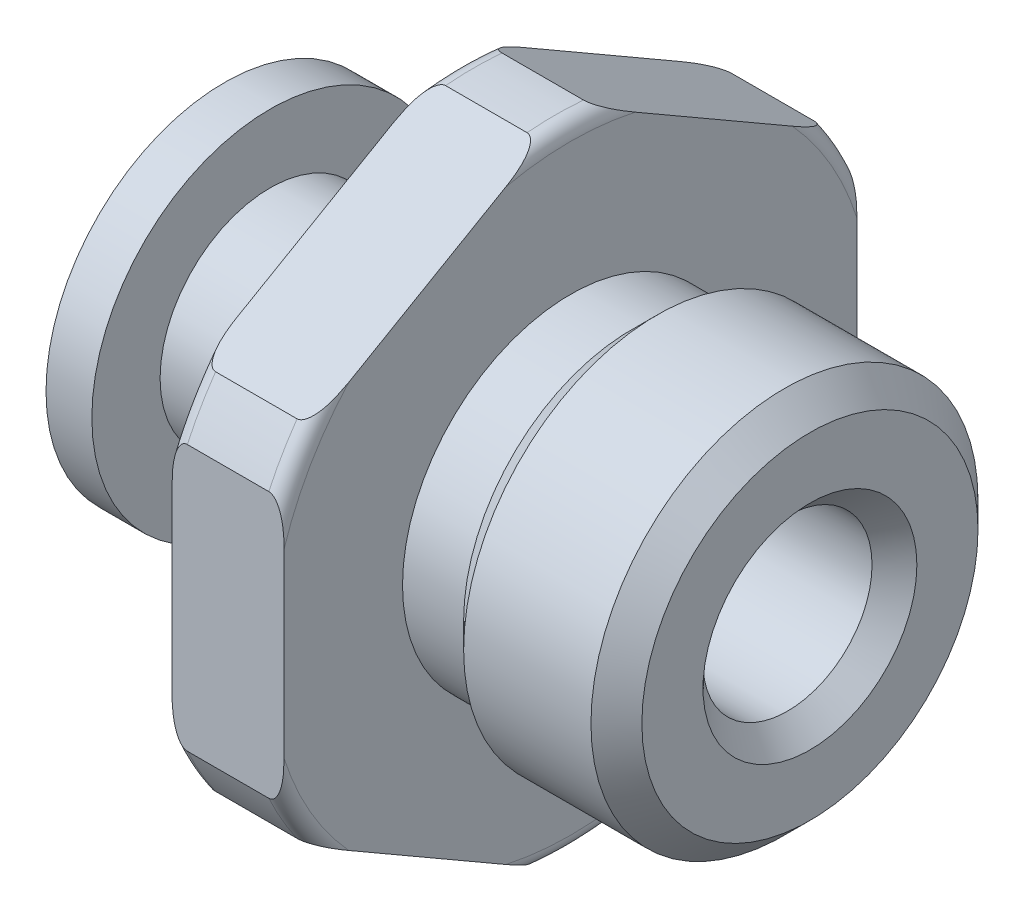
ISO-10303-21;
HEADER;
FILE_DESCRIPTION(('STEP AP214'),'2;1');
FILE_NAME('part.step','',(''),(''),'','','');
FILE_SCHEMA(('AUTOMOTIVE_DESIGN { 1 0 10303 214 1 1 1 1 }'));
ENDSEC;
DATA;
#1=APPLICATION_CONTEXT('core data for automotive mechanical design processes');
#2=APPLICATION_PROTOCOL_DEFINITION('international standard','automotive_design',2000,#1);
#3=PRODUCT_CONTEXT('',#1,'mechanical');
#4=PRODUCT('Part','Part','',(#3));
#5=PRODUCT_RELATED_PRODUCT_CATEGORY('part','',(#4));
#6=PRODUCT_DEFINITION_FORMATION('','',#4);
#7=PRODUCT_DEFINITION_CONTEXT('part definition',#1,'design');
#8=PRODUCT_DEFINITION('design','',#6,#7);
#9=PRODUCT_DEFINITION_SHAPE('','',#8);
#10=(LENGTH_UNIT() NAMED_UNIT(*) SI_UNIT(.MILLI.,.METRE.));
#11=(NAMED_UNIT(*) PLANE_ANGLE_UNIT() SI_UNIT($,.RADIAN.));
#12=(NAMED_UNIT(*) SI_UNIT($,.STERADIAN.) SOLID_ANGLE_UNIT());
#13=UNCERTAINTY_MEASURE_WITH_UNIT(LENGTH_MEASURE(1.E-05),#10,'distance_accuracy_value','');
#14=(GEOMETRIC_REPRESENTATION_CONTEXT(3) GLOBAL_UNCERTAINTY_ASSIGNED_CONTEXT((#13)) GLOBAL_UNIT_ASSIGNED_CONTEXT((#10,
#11,#12)) REPRESENTATION_CONTEXT('',''));
#15=CARTESIAN_POINT('',(0.,0.,0.));
#16=DIRECTION('',(0.,0.,1.));
#17=DIRECTION('',(1.,0.,0.));
#18=AXIS2_PLACEMENT_3D('',#15,#16,#17);
#19=CARTESIAN_POINT('',(0.,0.,0.));
#20=DIRECTION('',(-1.,0.,0.));
#21=DIRECTION('',(0.,0.,1.));
#22=AXIS2_PLACEMENT_3D('',#19,#20,#21);
#23=CYLINDRICAL_SURFACE('',#22,7.874);
#24=CARTESIAN_POINT('',(8.255,0.,0.));
#25=DIRECTION('',(-1.,0.,0.));
#26=DIRECTION('',(0.,0.,1.));
#27=AXIS2_PLACEMENT_3D('',#24,#25,#26);
#28=CIRCLE('',#27,7.874);
#29=CARTESIAN_POINT('',(8.255,3.31160262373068,7.14375));
#30=VERTEX_POINT('',#29);
#31=CARTESIAN_POINT('',(8.255,4.53086766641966,6.43980699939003));
#32=VERTEX_POINT('',#31);
#33=EDGE_CURVE('E464',#30,#32,#28,.T.);
#34=ORIENTED_EDGE('',*,*,#33,.T.);
#35=DIRECTION('',(-1.,0.,0.));
#36=VECTOR('',#35,1.);
#37=CARTESIAN_POINT('',(0.,4.53086766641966,6.43980699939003));
#38=LINE('',#37,#36);
#39=CARTESIAN_POINT('',(6.22300000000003,4.53086766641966,6.43980699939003));
#40=VERTEX_POINT('',#39);
#41=EDGE_CURVE('E771',#32,#40,#38,.T.);
#42=ORIENTED_EDGE('',*,*,#41,.T.);
#43=CARTESIAN_POINT('',(6.223,0.,0.));
#44=DIRECTION('',(-1.,0.,0.));
#45=DIRECTION('',(0.,0.,1.));
#46=AXIS2_PLACEMENT_3D('',#43,#44,#45);
#47=CIRCLE('',#46,7.874);
#48=CARTESIAN_POINT('',(6.22299999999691,3.31160262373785,7.14375));
#49=VERTEX_POINT('',#48);
#50=EDGE_CURVE('E243',#49,#40,#47,.T.);
#51=ORIENTED_EDGE('',*,*,#50,.F.);
#52=DIRECTION('',(-1.,0.,0.));
#53=VECTOR('',#52,1.);
#54=CARTESIAN_POINT('',(0.,3.31160262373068,7.14375));
#55=LINE('',#54,#53);
#56=EDGE_CURVE('E346',#49,#30,#55,.F.);
#57=ORIENTED_EDGE('',*,*,#56,.T.);
#58=EDGE_LOOP('',(#34,#42,#51,#57));
#59=FACE_BOUND('',#58,.T.);
#60=ADVANCED_FACE('F16',(#59),#23,.T.);
#61=CARTESIAN_POINT('',(6.223,0.,0.));
#62=DIRECTION('',(-1.,0.,0.));
#63=DIRECTION('',(0.,0.,1.));
#64=AXIS2_PLACEMENT_3D('',#61,#62,#63);
#65=TOROIDAL_SURFACE('',#64,7.493,0.381);
#66=ORIENTED_EDGE('',*,*,#50,.T.);
#67=CARTESIAN_POINT('',(6.2232,4.53086772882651,6.43980689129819));
#68=CARTESIAN_POINT('',(6.21331148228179,4.53084845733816,6.43984027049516));
#69=CARTESIAN_POINT('',(6.20345565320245,4.53131240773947,6.43903668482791));
#70=CARTESIAN_POINT('',(6.18416661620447,4.53308616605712,6.43596444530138));
#71=CARTESIAN_POINT('',(6.17472983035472,4.53438609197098,6.43371290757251));
#72=CARTESIAN_POINT('',(6.15424680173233,4.53810616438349,6.42726955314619));
#73=CARTESIAN_POINT('',(6.14334170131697,4.5407174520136,6.42274667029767));
#74=CARTESIAN_POINT('',(6.12248394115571,4.54678849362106,6.41223131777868));
#75=CARTESIAN_POINT('',(6.11253614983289,4.55025229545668,6.40623183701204));
#76=CARTESIAN_POINT('',(6.08805818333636,4.56001259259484,6.38932650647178));
#77=CARTESIAN_POINT('',(6.07428041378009,4.56677582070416,6.37761225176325));
#78=CARTESIAN_POINT('',(6.0488580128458,4.58122360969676,6.35258794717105));
#79=CARTESIAN_POINT('',(6.03721770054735,4.58890998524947,6.33927475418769));
#80=CARTESIAN_POINT('',(6.01572602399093,4.60482581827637,6.31170772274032));
#81=CARTESIAN_POINT('',(6.00586694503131,4.6130527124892,6.29745832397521));
#82=CARTESIAN_POINT('',(5.98755715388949,4.62989315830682,6.26828981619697));
#83=CARTESIAN_POINT('',(5.97910787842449,4.63850709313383,6.2533700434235));
#84=CARTESIAN_POINT('',(5.95548408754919,4.66477246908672,6.20787707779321));
#85=CARTESIAN_POINT('',(5.94207087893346,4.68281745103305,6.1766222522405));
#86=CARTESIAN_POINT('',(5.91272817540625,4.72864157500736,6.09725254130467));
#87=CARTESIAN_POINT('',(5.89893186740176,4.75674745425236,6.04857173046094));
#88=CARTESIAN_POINT('',(5.87656004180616,4.81350077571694,5.95027209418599));
#89=CARTESIAN_POINT('',(5.86799596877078,4.84214926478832,5.90065145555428));
#90=CARTESIAN_POINT('',(5.85477905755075,4.89975550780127,5.80087451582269));
#91=CARTESIAN_POINT('',(5.85013900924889,4.92871396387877,5.75071699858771));
#92=CARTESIAN_POINT('',(5.84394464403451,4.98667807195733,5.65032021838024));
#93=CARTESIAN_POINT('',(5.84238736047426,5.01568365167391,5.60008108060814));
#94=CARTESIAN_POINT('',(5.84171194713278,5.07624297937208,5.4951892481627));
#95=CARTESIAN_POINT('',(5.84281974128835,5.1077970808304,5.4405359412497));
#96=CARTESIAN_POINT('',(5.84737503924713,5.17086505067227,5.33129901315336));
#97=CARTESIAN_POINT('',(5.85082296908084,5.20237891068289,5.27671540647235));
#98=CARTESIAN_POINT('',(5.86398749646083,5.29686748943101,5.11305638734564));
#99=CARTESIAN_POINT('',(5.87652389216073,5.35974222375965,5.00415415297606));
#100=CARTESIAN_POINT('',(5.90623840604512,5.48524564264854,4.78677585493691));
#101=CARTESIAN_POINT('',(5.9234203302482,5.54787408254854,4.67830021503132));
#102=CARTESIAN_POINT('',(5.95982791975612,5.67297419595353,4.46162046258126));
#103=CARTESIAN_POINT('',(5.979053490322,5.73544587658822,4.35341633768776));
#104=CARTESIAN_POINT('',(6.01038939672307,5.84185557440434,4.1691093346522));
#105=CARTESIAN_POINT('',(6.02291125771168,5.88576240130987,4.0930604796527));
#106=CARTESIAN_POINT('',(6.04501110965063,5.97375017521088,3.94066118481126));
#107=CARTESIAN_POINT('',(6.05459086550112,6.01783100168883,3.86431095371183));
#108=CARTESIAN_POINT('',(6.06763480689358,6.1060653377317,3.71148460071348));
#109=CARTESIAN_POINT('',(6.07112477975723,6.15021774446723,3.6350103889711));
#110=CARTESIAN_POINT('',(6.07026393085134,6.23850545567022,3.48209158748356));
#111=CARTESIAN_POINT('',(6.06591218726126,6.2826407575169,3.40564700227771));
#112=CARTESIAN_POINT('',(6.0519578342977,6.36810655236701,3.25761590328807));
#113=CARTESIAN_POINT('',(6.04267259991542,6.40945197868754,3.18600352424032));
#114=CARTESIAN_POINT('',(6.02163778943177,6.49199137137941,3.04304110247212));
#115=CARTESIAN_POINT('',(6.009887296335,6.53318527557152,2.97169116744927));
#116=CARTESIAN_POINT('',(5.98559210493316,6.61569075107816,2.82878749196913));
#117=CARTESIAN_POINT('',(5.97304425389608,6.65700208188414,2.7572341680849));
#118=CARTESIAN_POINT('',(5.94834988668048,6.73964635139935,2.61409009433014));
#119=CARTESIAN_POINT('',(5.9362032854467,6.78097928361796,2.54249935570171));
#120=CARTESIAN_POINT('',(5.90946841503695,6.87700659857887,2.376175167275));
#121=CARTESIAN_POINT('',(5.89534655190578,6.93173450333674,2.28138365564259));
#122=CARTESIAN_POINT('',(5.87104324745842,7.04135997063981,2.09150677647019));
#123=CARTESIAN_POINT('',(5.86085739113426,7.09625727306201,1.99642185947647));
#124=CARTESIAN_POINT('',(5.84868253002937,7.18867499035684,1.83634967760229));
#125=CARTESIAN_POINT('',(5.84511419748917,7.22614120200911,1.77145629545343));
#126=CARTESIAN_POINT('',(5.84150936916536,7.30114465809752,1.64154649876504));
#127=CARTESIAN_POINT('',(5.84147511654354,7.33868193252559,1.57653003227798));
#128=CARTESIAN_POINT('',(5.84607828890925,7.4145766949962,1.44507644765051));
#129=CARTESIAN_POINT('',(5.85082373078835,7.45293308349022,1.37864123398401));
#130=CARTESIAN_POINT('',(5.8629418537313,7.51019657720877,1.27945795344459));
#131=CARTESIAN_POINT('',(5.86781322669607,7.52923582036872,1.2464810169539));
#132=CARTESIAN_POINT('',(5.87957644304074,7.56715515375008,1.18080280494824));
#133=CARTESIAN_POINT('',(5.88646753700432,7.58603530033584,1.14810143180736));
#134=CARTESIAN_POINT('',(5.90339394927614,7.62502761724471,1.08056475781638));
#135=CARTESIAN_POINT('',(5.91363644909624,7.6451177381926,1.04576764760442));
#136=CARTESIAN_POINT('',(5.93792902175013,7.68473905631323,0.977141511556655));
#137=CARTESIAN_POINT('',(5.95197735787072,7.70427050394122,0.943312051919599));
#138=CARTESIAN_POINT('',(5.97918415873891,7.73511741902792,0.889883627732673));
#139=CARTESIAN_POINT('',(5.99072830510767,7.7467855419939,0.869673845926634));
#140=CARTESIAN_POINT('',(6.01653397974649,7.76935495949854,0.830582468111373));
#141=CARTESIAN_POINT('',(6.03079037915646,7.78025764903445,0.811698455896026));
#142=CARTESIAN_POINT('',(6.0561744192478,7.79641108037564,0.783719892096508));
#143=CARTESIAN_POINT('',(6.06612355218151,7.80212118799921,0.773829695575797));
#144=CARTESIAN_POINT('',(6.08745010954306,7.81284554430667,0.75525456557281));
#145=CARTESIAN_POINT('',(6.09882642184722,7.8178603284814,0.746568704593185));
#146=CARTESIAN_POINT('',(6.12009354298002,7.82571529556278,0.732963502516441));
#147=CARTESIAN_POINT('',(6.12964090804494,7.82878540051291,0.727645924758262));
#148=CARTESIAN_POINT('',(6.14956821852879,7.83412710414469,0.71839382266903));
#149=CARTESIAN_POINT('',(6.15994478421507,7.8364017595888,0.714454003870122));
#150=CARTESIAN_POINT('',(6.17908358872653,7.83956236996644,0.708979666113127));
#151=CARTESIAN_POINT('',(6.1877171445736,7.84064118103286,0.707111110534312));
#152=CARTESIAN_POINT('',(6.20529205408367,7.84210567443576,0.704574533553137));
#153=CARTESIAN_POINT('',(6.21423546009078,7.84248511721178,0.703917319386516));
#154=CARTESIAN_POINT('',(6.2232,7.84247022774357,0.703943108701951));
#155=B_SPLINE_CURVE_WITH_KNOTS('',3,(#67,#68,#69,#70,#71,#72,#73,#74,#75,#76,#77,#78,#79,#80,
#81,#82,#83,#84,#85,#86,#87,#88,#89,#90,#91,#92,#93,#94,#95,#96,#97,#98,#99,#100,#101,#102,#103,
#104,#105,#106,#107,#108,#109,#110,#111,#112,#113,#114,#115,#116,#117,#118,#119,#120,#121,#122,
#123,#124,#125,#126,#127,#128,#129,#130,#131,#132,#133,#134,#135,#136,#137,#138,#139,#140,#141,
#142,#143,#144,#145,#146,#147,#148,#149,#150,#151,#152,#153,#154),.UNSPECIFIED.,.F.,.F.,(4,2,2,
2,2,2,2,2,2,2,2,2,2,2,2,2,2,2,2,2,2,2,2,2,2,2,2,2,2,2,2,2,2,2,2,2,2,2,2,2,2,2,2,4),(0.,
0.0295662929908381,0.0587893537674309,0.0948613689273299,0.13110808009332,0.188705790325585,
0.246418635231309,0.303875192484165,0.361389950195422,0.476629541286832,0.649889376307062,
0.823526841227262,0.997728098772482,1.17176163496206,1.36106000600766,1.55039284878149,
1.92933991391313,2.30859839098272,2.68783929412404,2.95393500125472,3.21987077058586,
3.48467767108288,3.74951570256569,3.99907663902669,4.24873056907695,4.49944179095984,
4.7500995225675,5.08115206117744,5.41183217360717,5.63681912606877,5.861948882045,
6.09228312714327,6.20740876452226,6.32249173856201,6.4467670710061,6.57098578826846,
6.64897844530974,6.72682505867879,6.77217261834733,6.81748505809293,6.85142851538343,
6.88524006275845,6.91182859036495,6.93865320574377),.UNSPECIFIED.);
#156=CARTESIAN_POINT('',(5.842,5.0561950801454,5.52991322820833));
#157=VERTEX_POINT('',#156);
#158=EDGE_CURVE('E231',#40,#157,#155,.T.);
#159=ORIENTED_EDGE('',*,*,#158,.T.);
#160=CARTESIAN_POINT('',(5.842,0.,0.));
#161=DIRECTION('',(-1.,0.,0.));
#162=DIRECTION('',(0.,0.,1.));
#163=AXIS2_PLACEMENT_3D('',#160,#161,#162);
#164=CIRCLE('',#163,7.493);
#165=CARTESIAN_POINT('',(5.842,2.26094779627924,7.14375));
#166=VERTEX_POINT('',#165);
#167=EDGE_CURVE('E241',#166,#157,#164,.T.);
#168=ORIENTED_EDGE('',*,*,#167,.F.);
#169=CARTESIAN_POINT('',(6.05110430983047,0.363282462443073,7.14375));
#170=CARTESIAN_POINT('',(6.04477053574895,0.426352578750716,7.14375));
#171=CARTESIAN_POINT('',(6.03724688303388,0.489296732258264,7.14375));
#172=CARTESIAN_POINT('',(6.02086518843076,0.615012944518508,7.14375));
#173=CARTESIAN_POINT('',(6.01200696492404,0.677784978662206,7.14375));
#174=CARTESIAN_POINT('',(5.99368534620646,0.803565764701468,7.14375));
#175=CARTESIAN_POINT('',(5.98421909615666,0.866574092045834,7.14375));
#176=CARTESIAN_POINT('',(5.96528707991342,0.992582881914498,7.14375));
#177=CARTESIAN_POINT('',(5.95582131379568,1.05558334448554,7.14375));
#178=CARTESIAN_POINT('',(5.93170475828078,1.21994623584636,7.14375));
#179=CARTESIAN_POINT('',(5.9173978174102,1.32136072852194,7.14375));
#180=CARTESIAN_POINT('',(5.8913642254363,1.52456158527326,7.14375));
#181=CARTESIAN_POINT('',(5.87963826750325,1.62634804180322,7.14375));
#182=CARTESIAN_POINT('',(5.86019760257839,1.83025228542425,7.14375));
#183=CARTESIAN_POINT('',(5.85248037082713,1.93236982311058,7.14375));
#184=CARTESIAN_POINT('',(5.84274598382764,2.13685797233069,7.14375));
#185=CARTESIAN_POINT('',(5.84072465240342,2.23922834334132,7.14375));
#186=CARTESIAN_POINT('',(5.84384823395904,2.39305481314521,7.14375));
#187=CARTESIAN_POINT('',(5.84593506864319,2.44457079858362,7.14375));
#188=CARTESIAN_POINT('',(5.8526757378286,2.54747795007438,7.14375));
#189=CARTESIAN_POINT('',(5.85733119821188,2.59886901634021,7.14375));
#190=CARTESIAN_POINT('',(5.86985264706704,2.7012017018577,7.14375));
#191=CARTESIAN_POINT('',(5.87771415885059,2.7521438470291,7.14375));
#192=CARTESIAN_POINT('',(5.89760650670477,2.85316682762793,7.14375));
#193=CARTESIAN_POINT('',(5.90963103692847,2.90324884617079,7.14375));
#194=CARTESIAN_POINT('',(5.9361437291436,2.99073051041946,7.14375));
#195=CARTESIAN_POINT('',(5.94948006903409,3.02846227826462,7.14375));
#196=CARTESIAN_POINT('',(5.97308166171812,3.08343322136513,7.14375));
#197=CARTESIAN_POINT('',(5.98152721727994,3.10145015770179,7.14375));
#198=CARTESIAN_POINT('',(5.99987197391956,3.13672064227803,7.14375));
#199=CARTESIAN_POINT('',(6.00976957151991,3.15397500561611,7.14375));
#200=CARTESIAN_POINT('',(6.0285540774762,3.18301481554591,7.14375));
#201=CARTESIAN_POINT('',(6.03703835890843,3.19505888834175,7.14375));
#202=CARTESIAN_POINT('',(6.05517580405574,3.21827804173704,7.14375));
#203=CARTESIAN_POINT('',(6.06483071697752,3.22945177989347,7.14375));
#204=CARTESIAN_POINT('',(6.08559632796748,3.25062053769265,7.14375));
#205=CARTESIAN_POINT('',(6.09672173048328,3.2606014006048,7.14375));
#206=CARTESIAN_POINT('',(6.12048659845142,3.27856733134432,7.14375));
#207=CARTESIAN_POINT('',(6.13312119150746,3.28655857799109,7.14375));
#208=CARTESIAN_POINT('',(6.15518689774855,3.29736585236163,7.14375));
#209=CARTESIAN_POINT('',(6.16420721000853,3.30101539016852,7.14375));
#210=CARTESIAN_POINT('',(6.18272322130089,3.30679713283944,7.14375));
#211=CARTESIAN_POINT('',(6.19221838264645,3.30893101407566,7.14375));
#212=CARTESIAN_POINT('',(6.21149552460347,3.31148183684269,7.14375));
#213=CARTESIAN_POINT('',(6.2212787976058,3.31188925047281,7.14375));
#214=CARTESIAN_POINT('',(6.24075660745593,3.31091476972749,7.14375));
#215=CARTESIAN_POINT('',(6.25045111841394,3.30953236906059,7.14375));
#216=CARTESIAN_POINT('',(6.26882351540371,3.30527277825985,7.14375));
#217=CARTESIAN_POINT('',(6.27752631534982,3.30249997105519,7.14375));
#218=CARTESIAN_POINT('',(6.2944400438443,3.29573898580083,7.14375));
#219=CARTESIAN_POINT('',(6.30265076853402,3.2917503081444,7.14375));
#220=CARTESIAN_POINT('',(6.32347076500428,3.27998708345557,7.14375));
#221=CARTESIAN_POINT('',(6.33562210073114,3.2714043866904,7.14375));
#222=CARTESIAN_POINT('',(6.35846294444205,3.25247458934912,7.14375));
#223=CARTESIAN_POINT('',(6.36914775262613,3.24212204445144,7.14375));
#224=CARTESIAN_POINT('',(6.39709406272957,3.2116565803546,7.14375));
#225=CARTESIAN_POINT('',(6.41293920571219,3.1902579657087,7.14375));
#226=CARTESIAN_POINT('',(6.4415078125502,3.14550399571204,7.14375));
#227=CARTESIAN_POINT('',(6.45422283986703,3.12214357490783,7.14375));
#228=CARTESIAN_POINT('',(6.48123078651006,3.06604172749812,7.14375));
#229=CARTESIAN_POINT('',(6.49455824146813,3.03284098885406,7.14375));
#230=CARTESIAN_POINT('',(6.51805594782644,2.96531939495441,7.14375));
#231=CARTESIAN_POINT('',(6.52822006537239,2.93099650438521,7.14375));
#232=CARTESIAN_POINT('',(6.54611492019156,2.86158736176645,7.14375));
#233=CARTESIAN_POINT('',(6.55383585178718,2.82649862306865,7.14375));
#234=CARTESIAN_POINT('',(6.56726574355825,2.75598417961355,7.14375));
#235=CARTESIAN_POINT('',(6.57297664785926,2.72055883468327,7.14375));
#236=CARTESIAN_POINT('',(6.58740909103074,2.61564777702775,7.14375));
#237=CARTESIAN_POINT('',(6.59382042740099,2.54584489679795,7.14375));
#238=CARTESIAN_POINT('',(6.60207600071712,2.40595308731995,7.14375));
#239=CARTESIAN_POINT('',(6.60391616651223,2.33586395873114,7.14375));
#240=CARTESIAN_POINT('',(6.60407848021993,2.19549059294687,7.14375));
#241=CARTESIAN_POINT('',(6.60239053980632,2.12520637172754,7.14375));
#242=CARTESIAN_POINT('',(6.59624276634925,1.98475381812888,7.14375));
#243=CARTESIAN_POINT('',(6.59178230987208,1.91458551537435,7.14375));
#244=CARTESIAN_POINT('',(6.57508323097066,1.7034230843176,7.14375));
#245=CARTESIAN_POINT('',(6.55954267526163,1.56269637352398,7.14375));
#246=CARTESIAN_POINT('',(6.52355830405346,1.28215648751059,7.14375));
#247=CARTESIAN_POINT('',(6.50312213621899,1.1423422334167,7.14375));
#248=CARTESIAN_POINT('',(6.46821783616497,0.909150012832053,7.14375));
#249=CARTESIAN_POINT('',(6.45401517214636,0.815731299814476,7.14375));
#250=CARTESIAN_POINT('',(6.42692324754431,0.628637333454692,7.14375));
#251=CARTESIAN_POINT('',(6.41403483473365,0.53496195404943,7.14375));
#252=CARTESIAN_POINT('',(6.39260766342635,0.347829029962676,7.14375));
#253=CARTESIAN_POINT('',(6.38403372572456,0.25437611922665,7.14375));
#254=CARTESIAN_POINT('',(6.3770091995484,0.113958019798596,7.14375));
#255=CARTESIAN_POINT('',(6.37563932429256,0.0671456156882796,7.14375));
#256=CARTESIAN_POINT('',(6.37502860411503,-0.0264918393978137,7.14375));
#257=CARTESIAN_POINT('',(6.37578750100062,-0.0733168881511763,7.14375));
#258=CARTESIAN_POINT('',(6.38382768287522,-0.285238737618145,7.14375));
#259=CARTESIAN_POINT('',(6.40275415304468,-0.449789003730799,7.14375));
#260=CARTESIAN_POINT('',(6.43640641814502,-0.695878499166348,7.14375));
#261=CARTESIAN_POINT('',(6.44853372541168,-0.777966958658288,7.14375));
#262=CARTESIAN_POINT('',(6.47309372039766,-0.94209485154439,7.14375));
#263=CARTESIAN_POINT('',(6.48552629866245,-1.02413429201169,7.14375));
#264=CARTESIAN_POINT('',(6.52193031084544,-1.27152051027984,7.14375));
#265=CARTESIAN_POINT('',(6.54482775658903,-1.43704139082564,7.14375));
#266=CARTESIAN_POINT('',(6.57232846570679,-1.68594694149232,7.14375));
#267=CARTESIAN_POINT('',(6.58034989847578,-1.76893713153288,7.14375));
#268=CARTESIAN_POINT('',(6.5933149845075,-1.93514912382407,7.14375));
#269=CARTESIAN_POINT('',(6.59825943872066,-2.01837086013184,7.14375));
#270=CARTESIAN_POINT('',(6.60319155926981,-2.16049026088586,7.14375));
#271=CARTESIAN_POINT('',(6.60420872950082,-2.21935080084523,7.14375));
#272=CARTESIAN_POINT('',(6.60371940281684,-2.33710776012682,7.14375));
#273=CARTESIAN_POINT('',(6.60221131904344,-2.39600417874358,7.14375));
#274=CARTESIAN_POINT('',(6.5960310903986,-2.51373406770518,7.14375));
#275=CARTESIAN_POINT('',(6.59135387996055,-2.57256728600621,7.14375));
#276=CARTESIAN_POINT('',(6.57793404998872,-2.68974985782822,7.14375));
#277=CARTESIAN_POINT('',(6.56919564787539,-2.74809964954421,7.14375));
#278=CARTESIAN_POINT('',(6.55189800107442,-2.83505394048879,7.14375));
#279=CARTESIAN_POINT('',(6.54539656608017,-2.86406744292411,7.14375));
#280=CARTESIAN_POINT('',(6.53069801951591,-2.92165687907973,7.14375));
#281=CARTESIAN_POINT('',(6.52250169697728,-2.95023300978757,7.14375));
#282=CARTESIAN_POINT('',(6.50406076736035,-3.00659502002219,7.14375));
#283=CARTESIAN_POINT('',(6.49382480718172,-3.03438368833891,7.14375));
#284=CARTESIAN_POINT('',(6.47073398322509,-3.08883216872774,7.14375));
#285=CARTESIAN_POINT('',(6.45788415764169,-3.11549403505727,7.14375));
#286=CARTESIAN_POINT('',(6.43230487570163,-3.16052499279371,7.14375));
#287=CARTESIAN_POINT('',(6.42032827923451,-3.179316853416,7.14375));
#288=CARTESIAN_POINT('',(6.39387476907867,-3.2150566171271,7.14375));
#289=CARTESIAN_POINT('',(6.37940596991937,-3.23201022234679,7.14375));
#290=CARTESIAN_POINT('',(6.35459122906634,-3.25576989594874,7.14375));
#291=CARTESIAN_POINT('',(6.34533152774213,-3.26370257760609,7.14375));
#292=CARTESIAN_POINT('',(6.32579360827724,-3.27821452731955,7.14375));
#293=CARTESIAN_POINT('',(6.31551638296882,-3.2847950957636,7.14375));
#294=CARTESIAN_POINT('',(6.2958306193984,-3.29513075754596,7.14375));
#295=CARTESIAN_POINT('',(6.28657711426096,-3.29917723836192,7.14375));
#296=CARTESIAN_POINT('',(6.26752593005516,-3.30568183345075,7.14375));
#297=CARTESIAN_POINT('',(6.25772889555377,-3.30814178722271,7.14375));
#298=CARTESIAN_POINT('',(6.23777489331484,-3.31123511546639,7.14375));
#299=CARTESIAN_POINT('',(6.22761594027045,-3.31185603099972,7.14375));
#300=CARTESIAN_POINT('',(6.2073643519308,-3.31115974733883,7.14375));
#301=CARTESIAN_POINT('',(6.19727172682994,-3.30984225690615,7.14375));
#302=CARTESIAN_POINT('',(6.17849668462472,-3.30564884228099,7.14375));
#303=CARTESIAN_POINT('',(6.16977477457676,-3.30294371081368,7.14375));
#304=CARTESIAN_POINT('',(6.15281687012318,-3.29630715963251,7.14375));
#305=CARTESIAN_POINT('',(6.1445810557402,-3.29237528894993,7.14375));
#306=CARTESIAN_POINT('',(6.12380886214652,-3.2808114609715,7.14375));
#307=CARTESIAN_POINT('',(6.11171570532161,-3.27238588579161,7.14375));
#308=CARTESIAN_POINT('',(6.08896935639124,-3.25377482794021,7.14375));
#309=CARTESIAN_POINT('',(6.07832071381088,-3.24358400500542,7.14375));
#310=CARTESIAN_POINT('',(6.0505303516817,-3.21364887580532,7.14375));
#311=CARTESIAN_POINT('',(6.03477195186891,-3.19263372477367,7.14375));
#312=CARTESIAN_POINT('',(6.00632887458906,-3.1486494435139,7.14375));
#313=CARTESIAN_POINT('',(5.99365265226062,-3.12567516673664,7.14375));
#314=CARTESIAN_POINT('',(5.96677446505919,-3.07063031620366,7.14375));
#315=CARTESIAN_POINT('',(5.95350493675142,-3.03810982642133,7.14375));
#316=CARTESIAN_POINT('',(5.9300607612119,-2.9719509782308,7.14375));
#317=CARTESIAN_POINT('',(5.91989210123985,-2.93831059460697,7.14375));
#318=CARTESIAN_POINT('',(5.90194465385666,-2.87027217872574,7.14375));
#319=CARTESIAN_POINT('',(5.89417506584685,-2.83587175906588,7.14375));
#320=CARTESIAN_POINT('',(5.88061275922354,-2.76672842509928,7.14375));
#321=CARTESIAN_POINT('',(5.87481813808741,-2.73198587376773,7.14375));
#322=CARTESIAN_POINT('',(5.86023473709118,-2.63003253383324,7.14375));
#323=CARTESIAN_POINT('',(5.85363300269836,-2.56250953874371,7.14375));
#324=CARTESIAN_POINT('',(5.8448224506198,-2.4271617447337,7.14375));
#325=CARTESIAN_POINT('',(5.84261744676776,-2.35933673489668,7.14375));
#326=CARTESIAN_POINT('',(5.84160703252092,-2.22348014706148,7.14375));
#327=CARTESIAN_POINT('',(5.84281118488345,-2.15544852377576,7.14375));
#328=CARTESIAN_POINT('',(5.84791442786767,-2.01948121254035,7.14375));
#329=CARTESIAN_POINT('',(5.85181411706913,-1.95154554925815,7.14375));
#330=CARTESIAN_POINT('',(5.86677087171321,-1.74698074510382,7.14375));
#331=CARTESIAN_POINT('',(5.8810753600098,-1.61059452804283,7.14375));
#332=CARTESIAN_POINT('',(5.91468152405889,-1.33868050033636,7.14375));
#333=CARTESIAN_POINT('',(5.9339766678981,-1.20315180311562,7.14375));
#334=CARTESIAN_POINT('',(5.97177190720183,-0.948589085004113,7.14375));
#335=CARTESIAN_POINT('',(5.9900895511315,-0.829527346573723,7.14375));
#336=CARTESIAN_POINT('',(6.01582363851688,-0.650693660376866,7.14375));
#337=CARTESIAN_POINT('',(6.02411020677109,-0.591050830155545,7.14375));
#338=CARTESIAN_POINT('',(6.03937989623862,-0.471589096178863,7.14375));
#339=CARTESIAN_POINT('',(6.04636293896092,-0.411770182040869,7.14375));
#340=CARTESIAN_POINT('',(6.05806968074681,-0.292402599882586,7.14375));
#341=CARTESIAN_POINT('',(6.0628117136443,-0.232855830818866,7.14375));
#342=CARTESIAN_POINT('',(6.0691953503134,-0.113603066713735,7.14375));
#343=CARTESIAN_POINT('',(6.07083798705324,-0.0538971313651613,7.14375));
#344=CARTESIAN_POINT('',(6.07061591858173,0.06549066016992,7.14375));
#345=CARTESIAN_POINT('',(6.0687522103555,0.125172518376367,7.14375));
#346=CARTESIAN_POINT('',(6.06197954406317,0.244367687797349,7.14375));
#347=CARTESIAN_POINT('',(6.05706966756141,0.303880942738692,7.14375));
#348=CARTESIAN_POINT('',(6.05110430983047,0.363282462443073,7.14375));
#349=B_SPLINE_CURVE_WITH_KNOTS('',3,(#169,#170,#171,#172,#173,#174,#175,#176,#177,#178,#179,
#180,#181,#182,#183,#184,#185,#186,#187,#188,#189,#190,#191,#192,#193,#194,#195,#196,#197,#198,
#199,#200,#201,#202,#203,#204,#205,#206,#207,#208,#209,#210,#211,#212,#213,#214,#215,#216,#217,
#218,#219,#220,#221,#222,#223,#224,#225,#226,#227,#228,#229,#230,#231,#232,#233,#234,#235,#236,
#237,#238,#239,#240,#241,#242,#243,#244,#245,#246,#247,#248,#249,#250,#251,#252,#253,#254,#255,
#256,#257,#258,#259,#260,#261,#262,#263,#264,#265,#266,#267,#268,#269,#270,#271,#272,#273,#274,
#275,#276,#277,#278,#279,#280,#281,#282,#283,#284,#285,#286,#287,#288,#289,#290,#291,#292,#293,
#294,#295,#296,#297,#298,#299,#300,#301,#302,#303,#304,#305,#306,#307,#308,#309,#310,#311,#312,
#313,#314,#315,#316,#317,#318,#319,#320,#321,#322,#323,#324,#325,#326,#327,#328,#329,#330,#331,
#332,#333,#334,#335,#336,#337,#338,#339,#340,#341,#342,#343,#344,#345,#346,#347,#348),
.UNSPECIFIED.,.T.,.F.,(4,2,2,2,2,2,2,2,2,2,2,2,2,2,2,2,2,2,2,2,2,2,2,2,2,2,2,2,2,2,2,2,2,2,2,2,
2,2,2,2,2,2,2,2,2,2,2,2,2,2,2,2,2,2,2,2,2,2,2,2,2,2,2,2,2,2,2,2,2,2,2,2,2,2,2,2,2,2,2,2,2,2,2,2,
2,2,2,2,2,4),(0.,0.190150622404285,0.380327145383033,0.571473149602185,0.762596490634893,
1.06983785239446,1.37716162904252,1.68429161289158,1.99119635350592,2.14582276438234,
2.30054716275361,2.45505625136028,2.6093323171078,2.72911689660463,2.78876297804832,
2.84834368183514,2.89248640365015,2.9366959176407,2.98138672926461,3.02593697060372,
3.05501955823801,3.08406992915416,3.11328041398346,3.14249916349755,3.16979461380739,
3.19710129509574,3.24147331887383,3.28598437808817,3.36541398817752,3.44505539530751,
3.55213355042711,3.65941805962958,3.76712784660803,3.87473316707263,4.08478574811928,
4.29502533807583,4.50586691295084,4.71675591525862,5.14130338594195,5.56519192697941,
5.84866797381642,6.13232573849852,6.41363154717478,6.55408457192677,6.69452056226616,
7.19032068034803,7.43932799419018,7.68824729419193,8.18941158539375,8.43949966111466,
8.68952261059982,8.86608915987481,9.04276670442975,9.21972732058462,9.39650457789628,
9.48566520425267,9.5747844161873,9.66353355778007,9.75211323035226,9.81883313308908,
9.88533976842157,9.92183195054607,9.95828887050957,9.98846965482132,10.0186153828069,
10.0489648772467,10.0793189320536,10.1066080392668,10.1339071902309,10.1778684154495,
10.2219650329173,10.3003227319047,10.3788930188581,10.4840195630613,10.5893478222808,
10.6950750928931,10.8007002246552,11.004009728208,11.2074955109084,11.4115526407,
11.6156550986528,12.0268560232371,12.4375214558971,12.7989062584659,12.9795468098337,
13.1601982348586,13.3393449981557,13.5184320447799,13.6974681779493,13.8765583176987),.UNSPECIFIED.);
#350=EDGE_CURVE('E343',#166,#49,#349,.T.);
#351=ORIENTED_EDGE('',*,*,#350,.T.);
#352=EDGE_LOOP('',(#66,#159,#168,#351));
#353=FACE_BOUND('',#352,.T.);
#354=ADVANCED_FACE('F239',(#353),#65,.T.);
#355=CARTESIAN_POINT('',(8.255,0.,0.));
#356=DIRECTION('',(-1.,0.,0.));
#357=DIRECTION('',(0.,0.,1.));
#358=AXIS2_PLACEMENT_3D('',#355,#356,#357);
#359=TOROIDAL_SURFACE('',#358,7.493,0.380999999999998);
#360=CARTESIAN_POINT('',(8.255,7.84247029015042,0.703943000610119));
#361=VERTEX_POINT('',#360);
#362=CARTESIAN_POINT('',(8.255,7.84247029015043,-0.703943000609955));
#363=VERTEX_POINT('',#362);
#364=EDGE_CURVE('E609',#361,#363,#28,.T.);
#365=ORIENTED_EDGE('',*,*,#364,.F.);
#366=CARTESIAN_POINT('',(8.2548,7.84247022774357,0.703943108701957));
#367=CARTESIAN_POINT('',(8.26468851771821,7.84248949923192,0.703909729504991));
#368=CARTESIAN_POINT('',(8.27454434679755,7.84202554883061,0.704713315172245));
#369=CARTESIAN_POINT('',(8.29383338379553,7.84025179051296,0.707785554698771));
#370=CARTESIAN_POINT('',(8.30327016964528,7.83895186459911,0.710037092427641));
#371=CARTESIAN_POINT('',(8.32375319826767,7.83523179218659,0.716480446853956));
#372=CARTESIAN_POINT('',(8.33465829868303,7.83262050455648,0.721003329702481));
#373=CARTESIAN_POINT('',(8.35551605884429,7.82654946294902,0.731518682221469));
#374=CARTESIAN_POINT('',(8.36546385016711,7.8230856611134,0.737518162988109));
#375=CARTESIAN_POINT('',(8.38994181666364,7.81332536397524,0.754423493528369));
#376=CARTESIAN_POINT('',(8.40371958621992,7.80656213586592,0.766137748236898));
#377=CARTESIAN_POINT('',(8.4291419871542,7.79211434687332,0.7911620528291));
#378=CARTESIAN_POINT('',(8.44078229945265,7.78442797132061,0.80447524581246));
#379=CARTESIAN_POINT('',(8.46227397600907,7.76851213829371,0.832042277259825));
#380=CARTESIAN_POINT('',(8.47213305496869,7.76028524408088,0.846291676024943));
#381=CARTESIAN_POINT('',(8.49044284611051,7.74344479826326,0.875460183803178));
#382=CARTESIAN_POINT('',(8.49889212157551,7.73483086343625,0.890379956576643));
#383=CARTESIAN_POINT('',(8.52251591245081,7.70856548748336,0.935872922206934));
#384=CARTESIAN_POINT('',(8.53592912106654,7.69052050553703,0.967127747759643));
#385=CARTESIAN_POINT('',(8.56527182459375,7.64469638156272,1.04649745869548));
#386=CARTESIAN_POINT('',(8.57906813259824,7.61659050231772,1.09517826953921));
#387=CARTESIAN_POINT('',(8.60143995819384,7.55983718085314,1.19347790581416));
#388=CARTESIAN_POINT('',(8.61000403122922,7.53118869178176,1.24309854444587));
#389=CARTESIAN_POINT('',(8.62322094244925,7.47358244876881,1.34287548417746));
#390=CARTESIAN_POINT('',(8.62786099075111,7.44462399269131,1.39303300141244));
#391=CARTESIAN_POINT('',(8.63405535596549,7.38665988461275,1.49342978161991));
#392=CARTESIAN_POINT('',(8.63561263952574,7.35765430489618,1.54366891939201));
#393=CARTESIAN_POINT('',(8.63628805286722,7.29709497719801,1.64856075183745));
#394=CARTESIAN_POINT('',(8.63518025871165,7.26554087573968,1.70321405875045));
#395=CARTESIAN_POINT('',(8.63062496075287,7.20247290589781,1.81245098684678));
#396=CARTESIAN_POINT('',(8.62717703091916,7.17095904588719,1.86703459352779));
#397=CARTESIAN_POINT('',(8.61401250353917,7.07647046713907,2.0306936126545));
#398=CARTESIAN_POINT('',(8.60147610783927,7.01359573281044,2.13959584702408));
#399=CARTESIAN_POINT('',(8.57176159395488,6.88809231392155,2.35697414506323));
#400=CARTESIAN_POINT('',(8.5545796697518,6.82546387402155,2.46544978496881));
#401=CARTESIAN_POINT('',(8.51817208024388,6.70036376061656,2.68212953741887));
#402=CARTESIAN_POINT('',(8.498946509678,6.63789207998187,2.79033366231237));
#403=CARTESIAN_POINT('',(8.46761060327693,6.53148238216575,2.97464066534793));
#404=CARTESIAN_POINT('',(8.45508874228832,6.48757555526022,3.05068952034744));
#405=CARTESIAN_POINT('',(8.43298889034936,6.3995877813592,3.20308881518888));
#406=CARTESIAN_POINT('',(8.42340913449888,6.35550695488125,3.27943904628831));
#407=CARTESIAN_POINT('',(8.41036519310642,6.26727261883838,3.43226539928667));
#408=CARTESIAN_POINT('',(8.40687522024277,6.22312021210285,3.50873961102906));
#409=CARTESIAN_POINT('',(8.40773606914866,6.13483250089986,3.6616584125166));
#410=CARTESIAN_POINT('',(8.41208781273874,6.09069719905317,3.73810299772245));
#411=CARTESIAN_POINT('',(8.42604216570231,6.00523140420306,3.88613409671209));
#412=CARTESIAN_POINT('',(8.43532740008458,5.96388597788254,3.95774647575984));
#413=CARTESIAN_POINT('',(8.45636221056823,5.88134658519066,4.10070889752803));
#414=CARTESIAN_POINT('',(8.468112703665,5.84015268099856,4.17205883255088));
#415=CARTESIAN_POINT('',(8.49240789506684,5.75764720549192,4.314962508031));
#416=CARTESIAN_POINT('',(8.50495574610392,5.71633587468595,4.38651583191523));
#417=CARTESIAN_POINT('',(8.52965011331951,5.63369160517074,4.52965990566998));
#418=CARTESIAN_POINT('',(8.5417967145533,5.59235867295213,4.60125064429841));
#419=CARTESIAN_POINT('',(8.56853158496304,5.49633135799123,4.76757483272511));
#420=CARTESIAN_POINT('',(8.58265344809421,5.44160345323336,4.86236634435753));
#421=CARTESIAN_POINT('',(8.60695675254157,5.33197798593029,5.05224322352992));
#422=CARTESIAN_POINT('',(8.61714260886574,5.27708068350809,5.14732814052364));
#423=CARTESIAN_POINT('',(8.62931746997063,5.18466296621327,5.30740032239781));
#424=CARTESIAN_POINT('',(8.63288580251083,5.147196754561,5.37229370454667));
#425=CARTESIAN_POINT('',(8.63649063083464,5.07219329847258,5.50220350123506));
#426=CARTESIAN_POINT('',(8.63652488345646,5.03465602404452,5.56721996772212));
#427=CARTESIAN_POINT('',(8.63192171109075,4.95876126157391,5.69867355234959));
#428=CARTESIAN_POINT('',(8.62717626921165,4.92040487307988,5.76510876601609));
#429=CARTESIAN_POINT('',(8.6150581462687,4.86314137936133,5.86429204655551));
#430=CARTESIAN_POINT('',(8.61018677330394,4.84410213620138,5.8972689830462));
#431=CARTESIAN_POINT('',(8.59842355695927,4.80618280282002,5.96294719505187));
#432=CARTESIAN_POINT('',(8.59153246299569,4.78730265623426,5.99564856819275));
#433=CARTESIAN_POINT('',(8.57460605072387,4.7483103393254,6.06318524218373));
#434=CARTESIAN_POINT('',(8.56436355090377,4.7282202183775,6.0979823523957));
#435=CARTESIAN_POINT('',(8.54007097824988,4.68859890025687,6.16660848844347));
#436=CARTESIAN_POINT('',(8.52602264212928,4.66906745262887,6.20043794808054));
#437=CARTESIAN_POINT('',(8.4988158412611,4.63822053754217,6.25386637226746));
#438=CARTESIAN_POINT('',(8.48727169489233,4.62655241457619,6.2740761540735));
#439=CARTESIAN_POINT('',(8.46146602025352,4.60398299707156,6.31316753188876));
#440=CARTESIAN_POINT('',(8.44720962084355,4.59308030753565,6.3320515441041));
#441=CARTESIAN_POINT('',(8.42182558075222,4.57692687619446,6.36003010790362));
#442=CARTESIAN_POINT('',(8.4118764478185,4.57121676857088,6.36992030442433));
#443=CARTESIAN_POINT('',(8.39054989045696,4.56049241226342,6.38849543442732));
#444=CARTESIAN_POINT('',(8.37917357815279,4.55547762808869,6.39718129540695));
#445=CARTESIAN_POINT('',(8.35790645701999,4.5476226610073,6.4107864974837));
#446=CARTESIAN_POINT('',(8.34835909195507,4.54455255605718,6.41610407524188));
#447=CARTESIAN_POINT('',(8.32843178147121,4.53921085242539,6.42535617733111));
#448=CARTESIAN_POINT('',(8.31805521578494,4.53693619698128,6.42929599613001));
#449=CARTESIAN_POINT('',(8.29891641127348,4.53377558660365,6.43477033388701));
#450=CARTESIAN_POINT('',(8.29028285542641,4.53269677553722,6.43663888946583));
#451=CARTESIAN_POINT('',(8.27270794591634,4.53123228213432,6.439175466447));
#452=CARTESIAN_POINT('',(8.26376453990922,4.53085283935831,6.43983268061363));
#453=CARTESIAN_POINT('',(8.2548,4.53086772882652,6.43980689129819));
#454=B_SPLINE_CURVE_WITH_KNOTS('',3,(#366,#367,#368,#369,#370,#371,#372,#373,#374,#375,#376,
#377,#378,#379,#380,#381,#382,#383,#384,#385,#386,#387,#388,#389,#390,#391,#392,#393,#394,#395,
#396,#397,#398,#399,#400,#401,#402,#403,#404,#405,#406,#407,#408,#409,#410,#411,#412,#413,#414,
#415,#416,#417,#418,#419,#420,#421,#422,#423,#424,#425,#426,#427,#428,#429,#430,#431,#432,#433,
#434,#435,#436,#437,#438,#439,#440,#441,#442,#443,#444,#445,#446,#447,#448,#449,#450,#451,#452,
#453),.UNSPECIFIED.,.F.,.F.,(4,2,2,2,2,2,2,2,2,2,2,2,2,2,2,2,2,2,2,2,2,2,2,2,2,2,2,2,2,2,2,2,2,
2,2,2,2,2,2,2,2,2,2,4),(0.,0.0295662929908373,0.0587893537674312,0.0948613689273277,
0.13110808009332,0.188705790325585,0.24641863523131,0.303875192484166,0.361389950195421,
0.476629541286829,0.649889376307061,0.823526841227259,0.997728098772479,1.17176163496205,
1.36106000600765,1.55039284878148,1.92933991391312,2.3085983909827,2.68783929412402,
2.95393500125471,3.21987077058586,3.48467767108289,3.74951570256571,3.99907663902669,
4.24873056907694,4.49944179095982,4.75009952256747,5.08115206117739,5.41183217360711,
5.63681912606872,5.86194888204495,6.09228312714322,6.20740876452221,6.32249173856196,
6.44676707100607,6.57098578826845,6.64897844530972,6.72682505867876,6.77217261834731,
6.81748505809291,6.85142851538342,6.88524006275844,6.91182859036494,6.93865320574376),.UNSPECIFIED.);
#455=CARTESIAN_POINT('',(8.636,7.31714287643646,1.61383677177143));
#456=VERTEX_POINT('',#455);
#457=EDGE_CURVE('E710',#361,#456,#454,.T.);
#458=ORIENTED_EDGE('',*,*,#457,.T.);
#459=CARTESIAN_POINT('',(8.636,0.,0.));
#460=DIRECTION('',(-1.,0.,0.));
#461=DIRECTION('',(0.,0.,1.));
#462=AXIS2_PLACEMENT_3D('',#459,#460,#461);
#463=CIRCLE('',#462,7.493);
#464=CARTESIAN_POINT('',(8.636,7.31714287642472,-1.61383677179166));
#465=VERTEX_POINT('',#464);
#466=EDGE_CURVE('E449',#456,#465,#463,.T.);
#467=ORIENTED_EDGE('',*,*,#466,.T.);
#468=CARTESIAN_POINT('',(8.2548,4.53086772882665,-6.43980689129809));
#469=CARTESIAN_POINT('',(8.26468851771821,4.5308484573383,-6.43984027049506));
#470=CARTESIAN_POINT('',(8.27454434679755,4.5313124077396,-6.43903668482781));
#471=CARTESIAN_POINT('',(8.29383338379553,4.53308616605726,-6.43596444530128));
#472=CARTESIAN_POINT('',(8.30327016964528,4.53438609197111,-6.43371290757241));
#473=CARTESIAN_POINT('',(8.32375319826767,4.53810616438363,-6.42726955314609));
#474=CARTESIAN_POINT('',(8.33465829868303,4.54071745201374,-6.42274667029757));
#475=CARTESIAN_POINT('',(8.35551605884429,4.5467884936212,-6.41223131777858));
#476=CARTESIAN_POINT('',(8.36546385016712,4.55025229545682,-6.40623183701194));
#477=CARTESIAN_POINT('',(8.38994181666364,4.56001259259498,-6.38932650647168));
#478=CARTESIAN_POINT('',(8.40371958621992,4.5667758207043,-6.37761225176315));
#479=CARTESIAN_POINT('',(8.4291419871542,4.58122360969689,-6.35258794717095));
#480=CARTESIAN_POINT('',(8.44078229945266,4.58890998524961,-6.33927475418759));
#481=CARTESIAN_POINT('',(8.46227397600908,4.60482581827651,-6.31170772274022));
#482=CARTESIAN_POINT('',(8.4721330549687,4.61305271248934,-6.2974583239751));
#483=CARTESIAN_POINT('',(8.49044284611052,4.62989315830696,-6.26828981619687));
#484=CARTESIAN_POINT('',(8.49889212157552,4.63850709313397,-6.2533700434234));
#485=CARTESIAN_POINT('',(8.52251591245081,4.66477246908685,-6.20787707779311));
#486=CARTESIAN_POINT('',(8.53592912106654,4.68281745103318,-6.1766222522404));
#487=CARTESIAN_POINT('',(8.56527182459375,4.72864157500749,-6.09725254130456));
#488=CARTESIAN_POINT('',(8.57906813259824,4.75674745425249,-6.04857173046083));
#489=CARTESIAN_POINT('',(8.60143995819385,4.81350077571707,-5.95027209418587));
#490=CARTESIAN_POINT('',(8.61000403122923,4.84214926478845,-5.90065145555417));
#491=CARTESIAN_POINT('',(8.62322094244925,4.8997555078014,-5.80087451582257));
#492=CARTESIAN_POINT('',(8.62786099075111,4.9287139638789,-5.75071699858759));
#493=CARTESIAN_POINT('',(8.63405535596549,4.98667807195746,-5.65032021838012));
#494=CARTESIAN_POINT('',(8.63561263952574,5.01568365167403,-5.60008108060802));
#495=CARTESIAN_POINT('',(8.63628805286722,5.0762429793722,-5.49518924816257));
#496=CARTESIAN_POINT('',(8.63518025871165,5.10779708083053,-5.44053594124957));
#497=CARTESIAN_POINT('',(8.63062496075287,5.1708650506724,-5.33129901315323));
#498=CARTESIAN_POINT('',(8.62717703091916,5.20237891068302,-5.27671540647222));
#499=CARTESIAN_POINT('',(8.61401250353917,5.29686748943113,-5.11305638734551));
#500=CARTESIAN_POINT('',(8.60147610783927,5.35974222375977,-5.00415415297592));
#501=CARTESIAN_POINT('',(8.57176159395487,5.48524564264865,-4.78677585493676));
#502=CARTESIAN_POINT('',(8.55457966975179,5.54787408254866,-4.67830021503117));
#503=CARTESIAN_POINT('',(8.51817208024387,5.67297419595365,-4.4616204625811));
#504=CARTESIAN_POINT('',(8.49894650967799,5.73544587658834,-4.3534163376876));
#505=CARTESIAN_POINT('',(8.46761060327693,5.84185557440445,-4.16910933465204));
#506=CARTESIAN_POINT('',(8.45508874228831,5.88576240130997,-4.09306047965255));
#507=CARTESIAN_POINT('',(8.43298889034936,5.97375017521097,-3.94066118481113));
#508=CARTESIAN_POINT('',(8.42340913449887,6.01783100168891,-3.8643109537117));
#509=CARTESIAN_POINT('',(8.41036519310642,6.10606533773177,-3.71148460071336));
#510=CARTESIAN_POINT('',(8.40687522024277,6.15021774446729,-3.63501038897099));
#511=CARTESIAN_POINT('',(8.40773606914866,6.23850545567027,-3.48209158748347));
#512=CARTESIAN_POINT('',(8.41208781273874,6.28264075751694,-3.40564700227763));
#513=CARTESIAN_POINT('',(8.4260421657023,6.36810655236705,-3.25761590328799));
#514=CARTESIAN_POINT('',(8.43532740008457,6.40945197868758,-3.18600352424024));
#515=CARTESIAN_POINT('',(8.45636221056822,6.49199137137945,-3.04304110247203));
#516=CARTESIAN_POINT('',(8.46811270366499,6.53318527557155,-2.97169116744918));
#517=CARTESIAN_POINT('',(8.49240789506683,6.6156907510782,-2.82878749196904));
#518=CARTESIAN_POINT('',(8.50495574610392,6.65700208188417,-2.75723416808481));
#519=CARTESIAN_POINT('',(8.52965011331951,6.73964635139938,-2.61409009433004));
#520=CARTESIAN_POINT('',(8.5417967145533,6.78097928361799,-2.54249935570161));
#521=CARTESIAN_POINT('',(8.56853158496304,6.8770065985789,-2.3761751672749));
#522=CARTESIAN_POINT('',(8.58265344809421,6.93173450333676,-2.28138365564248));
#523=CARTESIAN_POINT('',(8.60695675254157,7.04135997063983,-2.09150677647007));
#524=CARTESIAN_POINT('',(8.61714260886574,7.09625727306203,-1.99642185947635));
#525=CARTESIAN_POINT('',(8.62931746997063,7.18867499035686,-1.83634967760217));
#526=CARTESIAN_POINT('',(8.63288580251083,7.22614120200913,-1.77145629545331));
#527=CARTESIAN_POINT('',(8.63649063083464,7.30114465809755,-1.64154649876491));
#528=CARTESIAN_POINT('',(8.63652488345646,7.33868193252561,-1.57653003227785));
#529=CARTESIAN_POINT('',(8.63192171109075,7.41457669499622,-1.44507644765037));
#530=CARTESIAN_POINT('',(8.62717626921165,7.45293308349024,-1.37864123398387));
#531=CARTESIAN_POINT('',(8.6150581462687,7.51019657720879,-1.27945795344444));
#532=CARTESIAN_POINT('',(8.61018677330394,7.52923582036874,-1.24648101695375));
#533=CARTESIAN_POINT('',(8.59842355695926,7.5671551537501,-1.18080280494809));
#534=CARTESIAN_POINT('',(8.59153246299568,7.58603530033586,-1.1481014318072));
#535=CARTESIAN_POINT('',(8.57460605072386,7.62502761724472,-1.08056475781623));
#536=CARTESIAN_POINT('',(8.56436355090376,7.64511773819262,-1.04576764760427));
#537=CARTESIAN_POINT('',(8.54007097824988,7.68473905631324,-0.977141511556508));
#538=CARTESIAN_POINT('',(8.52602264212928,7.70427050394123,-0.943312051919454));
#539=CARTESIAN_POINT('',(8.4988158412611,7.73511741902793,-0.889883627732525));
#540=CARTESIAN_POINT('',(8.48727169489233,7.74678554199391,-0.86967384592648));
#541=CARTESIAN_POINT('',(8.46146602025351,7.76935495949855,-0.830582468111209));
#542=CARTESIAN_POINT('',(8.44720962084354,7.78025764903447,-0.811698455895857));
#543=CARTESIAN_POINT('',(8.4218255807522,7.79641108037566,-0.78371989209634));
#544=CARTESIAN_POINT('',(8.41187644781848,7.80212118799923,-0.773829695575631));
#545=CARTESIAN_POINT('',(8.39054989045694,7.81284554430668,-0.755254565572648));
#546=CARTESIAN_POINT('',(8.37917357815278,7.81786032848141,-0.746568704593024));
#547=CARTESIAN_POINT('',(8.35790645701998,7.8257152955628,-0.732963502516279));
#548=CARTESIAN_POINT('',(8.34835909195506,7.82878540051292,-0.727645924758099));
#549=CARTESIAN_POINT('',(8.32843178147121,7.83412710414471,-0.718393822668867));
#550=CARTESIAN_POINT('',(8.31805521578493,7.83640175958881,-0.714454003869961));
#551=CARTESIAN_POINT('',(8.29891641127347,7.83956236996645,-0.708979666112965));
#552=CARTESIAN_POINT('',(8.2902828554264,7.84064118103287,-0.707111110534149));
#553=CARTESIAN_POINT('',(8.27270794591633,7.84210567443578,-0.704574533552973));
#554=CARTESIAN_POINT('',(8.26376453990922,7.84248511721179,-0.703917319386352));
#555=CARTESIAN_POINT('',(8.2548,7.84247022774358,-0.703943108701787));
#556=B_SPLINE_CURVE_WITH_KNOTS('',3,(#468,#469,#470,#471,#472,#473,#474,#475,#476,#477,#478,
#479,#480,#481,#482,#483,#484,#485,#486,#487,#488,#489,#490,#491,#492,#493,#494,#495,#496,#497,
#498,#499,#500,#501,#502,#503,#504,#505,#506,#507,#508,#509,#510,#511,#512,#513,#514,#515,#516,
#517,#518,#519,#520,#521,#522,#523,#524,#525,#526,#527,#528,#529,#530,#531,#532,#533,#534,#535,
#536,#537,#538,#539,#540,#541,#542,#543,#544,#545,#546,#547,#548,#549,#550,#551,#552,#553,#554,
#555),.UNSPECIFIED.,.F.,.F.,(4,2,2,2,2,2,2,2,2,2,2,2,2,2,2,2,2,2,2,2,2,2,2,2,2,2,2,2,2,2,2,2,2,
2,2,2,2,2,2,2,2,2,2,4),(0.,0.029566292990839,0.0587893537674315,0.0948613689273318,
0.131108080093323,0.188705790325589,0.246418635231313,0.303875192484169,0.361389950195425,
0.476629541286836,0.649889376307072,0.823526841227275,0.997728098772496,1.17176163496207,
1.36106000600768,1.55039284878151,1.92933991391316,2.30859839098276,2.68783929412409,
2.95393500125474,3.21987077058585,3.48467767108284,3.74951570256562,3.99907663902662,
4.24873056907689,4.49944179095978,4.75009952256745,5.08115206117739,5.41183217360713,
5.63681912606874,5.86194888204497,6.09228312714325,6.20740876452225,6.322491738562,
6.44676707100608,6.57098578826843,6.64897844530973,6.7268250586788,6.77217261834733,
6.81748505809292,6.85142851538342,6.88524006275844,6.91182859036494,6.93865320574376),.UNSPECIFIED.);
#557=EDGE_CURVE('E408',#465,#363,#556,.T.);
#558=ORIENTED_EDGE('',*,*,#557,.T.);
#559=EDGE_LOOP('',(#365,#458,#467,#558));
#560=FACE_BOUND('',#559,.T.);
#561=ADVANCED_FACE('F662',(#560),#359,.T.);
#562=CARTESIAN_POINT('',(6.22300000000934,7.84247029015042,0.703943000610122));
#563=VERTEX_POINT('',#562);
#564=CARTESIAN_POINT('',(6.22300000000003,7.84247029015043,-0.703943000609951));
#565=VERTEX_POINT('',#564);
#566=EDGE_CURVE('E584',#563,#565,#47,.T.);
#567=ORIENTED_EDGE('',*,*,#566,.F.);
#568=DIRECTION('',(-1.,0.,0.));
#569=VECTOR('',#568,1.);
#570=CARTESIAN_POINT('',(0.,7.84247029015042,0.703943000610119));
#571=LINE('',#570,#569);
#572=EDGE_CURVE('E245',#563,#361,#571,.F.);
#573=ORIENTED_EDGE('',*,*,#572,.T.);
#574=ORIENTED_EDGE('',*,*,#364,.T.);
#575=DIRECTION('',(-1.,0.,0.));
#576=VECTOR('',#575,1.);
#577=CARTESIAN_POINT('',(0.,7.84247029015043,-0.703943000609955));
#578=LINE('',#577,#576);
#579=EDGE_CURVE('E416',#363,#565,#578,.T.);
#580=ORIENTED_EDGE('',*,*,#579,.T.);
#581=EDGE_LOOP('',(#567,#573,#574,#580));
#582=FACE_BOUND('',#581,.T.);
#583=ADVANCED_FACE('F607',(#582),#23,.T.);
#584=CARTESIAN_POINT('',(8.255,4.5308676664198,-6.43980699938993));
#585=VERTEX_POINT('',#584);
#586=CARTESIAN_POINT('',(8.255,3.31160262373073,-7.14374999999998));
#587=VERTEX_POINT('',#586);
#588=EDGE_CURVE('E441',#585,#587,#28,.T.);
#589=ORIENTED_EDGE('',*,*,#588,.F.);
#590=CARTESIAN_POINT('',(8.636,5.05619508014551,-5.52991322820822));
#591=VERTEX_POINT('',#590);
#592=EDGE_CURVE('E415',#585,#591,#556,.T.);
#593=ORIENTED_EDGE('',*,*,#592,.T.);
#594=CARTESIAN_POINT('',(8.63600000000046,2.26094779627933,-7.14374999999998));
#595=VERTEX_POINT('',#594);
#596=EDGE_CURVE('E439',#591,#595,#463,.T.);
#597=ORIENTED_EDGE('',*,*,#596,.T.);
#598=CARTESIAN_POINT('',(8.5152027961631,1.00926329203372,-7.14374999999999));
#599=CARTESIAN_POINT('',(8.53400530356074,1.13495365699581,-7.14374999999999));
#600=CARTESIAN_POINT('',(8.55240018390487,1.26071046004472,-7.14374999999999));
#601=CARTESIAN_POINT('',(8.58543411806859,1.51264737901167,-7.14374999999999));
#602=CARTESIAN_POINT('',(8.60007574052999,1.63882714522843,-7.14374999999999));
#603=CARTESIAN_POINT('',(8.62299807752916,1.89216451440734,-7.14374999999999));
#604=CARTESIAN_POINT('',(8.63126241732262,2.01932379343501,-7.14374999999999));
#605=CARTESIAN_POINT('',(8.63612526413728,2.21013497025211,-7.14374999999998));
#606=CARTESIAN_POINT('',(8.63649405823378,2.2736857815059,-7.14374999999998));
#607=CARTESIAN_POINT('',(8.63407223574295,2.40071936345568,-7.14374999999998));
#608=CARTESIAN_POINT('',(8.63128285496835,2.46420215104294,-7.14374999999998));
#609=CARTESIAN_POINT('',(8.62223678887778,2.58311650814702,-7.14374999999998));
#610=CARTESIAN_POINT('',(8.61644627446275,2.63858249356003,-7.14374999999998));
#611=CARTESIAN_POINT('',(8.60080739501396,2.74922060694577,-7.14374999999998));
#612=CARTESIAN_POINT('',(8.59094237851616,2.80439057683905,-7.14374999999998));
#613=CARTESIAN_POINT('',(8.57189965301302,2.88655554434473,-7.14374999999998));
#614=CARTESIAN_POINT('',(8.56478233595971,2.91402729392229,-7.14374999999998));
#615=CARTESIAN_POINT('',(8.54881702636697,2.96845763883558,-7.14374999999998));
#616=CARTESIAN_POINT('',(8.53997001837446,2.99541651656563,-7.14374999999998));
#617=CARTESIAN_POINT('',(8.52018204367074,3.0484070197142,-7.14374999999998));
#618=CARTESIAN_POINT('',(8.50925213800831,3.07444271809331,-7.14374999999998));
#619=CARTESIAN_POINT('',(8.48468943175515,3.12518354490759,-7.14374999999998));
#620=CARTESIAN_POINT('',(8.47106350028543,3.14989185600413,-7.14374999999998));
#621=CARTESIAN_POINT('',(8.44524755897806,3.18927532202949,-7.14374999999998));
#622=CARTESIAN_POINT('',(8.4340438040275,3.20459027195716,-7.14374999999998));
#623=CARTESIAN_POINT('',(8.40962749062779,3.23353610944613,-7.14374999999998));
#624=CARTESIAN_POINT('',(8.39642005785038,3.24717113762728,-7.14374999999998));
#625=CARTESIAN_POINT('',(8.37310236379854,3.26703323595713,-7.14374999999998));
#626=CARTESIAN_POINT('',(8.36371964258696,3.27410757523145,-7.14374999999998));
#627=CARTESIAN_POINT('',(8.34400544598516,3.28679807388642,-7.14374999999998));
#628=CARTESIAN_POINT('',(8.33367517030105,3.29241604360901,-7.14374999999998));
#629=CARTESIAN_POINT('',(8.31408322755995,3.30088579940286,-7.14374999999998));
#630=CARTESIAN_POINT('',(8.30495918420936,3.3040521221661,-7.14374999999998));
#631=CARTESIAN_POINT('',(8.28630941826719,3.30881272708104,-7.14374999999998));
#632=CARTESIAN_POINT('',(8.27678412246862,3.31040863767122,-7.14374999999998));
#633=CARTESIAN_POINT('',(8.25756132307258,3.31187160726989,-7.14374999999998));
#634=CARTESIAN_POINT('',(8.24786329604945,3.31173195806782,-7.14374999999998));
#635=CARTESIAN_POINT('',(8.22864762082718,3.30972249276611,-7.14374999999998));
#636=CARTESIAN_POINT('',(8.21913006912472,3.30785177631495,-7.14374999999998));
#637=CARTESIAN_POINT('',(8.20100590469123,3.30270048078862,-7.14374999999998));
#638=CARTESIAN_POINT('',(8.19237752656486,3.29949454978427,-7.14374999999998));
#639=CARTESIAN_POINT('',(8.17565250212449,3.29192414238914,-7.14374999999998));
#640=CARTESIAN_POINT('',(8.16755602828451,3.28755929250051,-7.14374999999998));
#641=CARTESIAN_POINT('',(8.14637130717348,3.27446032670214,-7.14374999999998));
#642=CARTESIAN_POINT('',(8.13383880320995,3.26482956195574,-7.14374999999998));
#643=CARTESIAN_POINT('',(8.11038072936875,3.24377500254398,-7.14374999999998));
#644=CARTESIAN_POINT('',(8.09946073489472,3.23234525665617,-7.14374999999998));
#645=CARTESIAN_POINT('',(8.07050610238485,3.19831582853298,-7.14374999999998));
#646=CARTESIAN_POINT('',(8.054111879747,3.17433521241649,-7.14374999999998));
#647=CARTESIAN_POINT('',(8.0247602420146,3.12439503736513,-7.14374999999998));
#648=CARTESIAN_POINT('',(8.01181215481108,3.09843034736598,-7.14374999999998));
#649=CARTESIAN_POINT('',(7.98401373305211,3.03512701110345,-7.14374999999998));
#650=CARTESIAN_POINT('',(7.97036031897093,2.99726876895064,-7.14374999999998));
#651=CARTESIAN_POINT('',(7.94663714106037,2.92042205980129,-7.14374999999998));
#652=CARTESIAN_POINT('',(7.93657460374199,2.88143148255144,-7.14374999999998));
#653=CARTESIAN_POINT('',(7.91919165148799,2.802694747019,-7.14374999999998));
#654=CARTESIAN_POINT('',(7.91188212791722,2.7629462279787,-7.14374999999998));
#655=CARTESIAN_POINT('',(7.89950638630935,2.68315237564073,-7.14374999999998));
#656=CARTESIAN_POINT('',(7.8944380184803,2.64310736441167,-7.14374999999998));
#657=CARTESIAN_POINT('',(7.88342605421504,2.53669534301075,-7.14374999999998));
#658=CARTESIAN_POINT('',(7.87906117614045,2.47016614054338,-7.14374999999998));
#659=CARTESIAN_POINT('',(7.87409758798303,2.33695571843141,-7.14374999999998));
#660=CARTESIAN_POINT('',(7.87350110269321,2.27027443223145,-7.14374999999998));
#661=CARTESIAN_POINT('',(7.87526854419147,2.13682013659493,-7.14374999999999));
#662=CARTESIAN_POINT('',(7.8776386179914,2.07004722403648,-7.14374999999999));
#663=CARTESIAN_POINT('',(7.88474033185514,1.93662309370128,-7.14374999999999));
#664=CARTESIAN_POINT('',(7.88947237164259,1.86997189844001,-7.14374999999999));
#665=CARTESIAN_POINT('',(7.90651335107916,1.669676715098,-7.14374999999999));
#666=CARTESIAN_POINT('',(7.92165023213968,1.53627793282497,-7.14374999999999));
#667=CARTESIAN_POINT('',(7.95619209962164,1.27023504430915,-7.14374999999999));
#668=CARTESIAN_POINT('',(7.97559229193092,1.13759026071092,-7.14374999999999));
#669=CARTESIAN_POINT('',(8.00937062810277,0.911883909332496,-7.14374999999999));
#670=CARTESIAN_POINT('',(8.02352547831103,0.818788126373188,-7.14374999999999));
#671=CARTESIAN_POINT('',(8.05055587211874,0.632350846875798,-7.14375));
#672=CARTESIAN_POINT('',(8.06343066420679,0.539009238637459,-7.14375));
#673=CARTESIAN_POINT('',(8.08492811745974,0.352455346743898,-7.14375));
#674=CARTESIAN_POINT('',(8.0935810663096,0.25924707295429,-7.14375));
#675=CARTESIAN_POINT('',(8.10079429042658,0.119191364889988,-7.14375));
#676=CARTESIAN_POINT('',(8.10223869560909,0.0724992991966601,-7.14375));
#677=CARTESIAN_POINT('',(8.10301238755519,-0.0209009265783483,-7.14375));
#678=CARTESIAN_POINT('',(8.10234195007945,-0.0676090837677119,-7.14375));
#679=CARTESIAN_POINT('',(8.09467671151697,-0.279403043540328,-7.14375));
#680=CARTESIAN_POINT('',(8.07594672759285,-0.443960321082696,-7.14375));
#681=CARTESIAN_POINT('',(8.04243757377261,-0.690040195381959,-7.14375000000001));
#682=CARTESIAN_POINT('',(8.03033217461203,-0.772124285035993,-7.14375000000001));
#683=CARTESIAN_POINT('',(8.00578987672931,-0.936239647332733,-7.14375000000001));
#684=CARTESIAN_POINT('',(7.99335309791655,-1.01827092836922,-7.14375000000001));
#685=CARTESIAN_POINT('',(7.95691130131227,-1.26558919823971,-7.14375000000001));
#686=CARTESIAN_POINT('',(7.93394842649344,-1.43104519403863,-7.14375000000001));
#687=CARTESIAN_POINT('',(7.90629117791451,-1.67984954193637,-7.14375000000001));
#688=CARTESIAN_POINT('',(7.89820798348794,-1.76280431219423,-7.14375000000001));
#689=CARTESIAN_POINT('',(7.88509498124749,-1.92894642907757,-7.14375000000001));
#690=CARTESIAN_POINT('',(7.88006439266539,-2.01213371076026,-7.14375000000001));
#691=CARTESIAN_POINT('',(7.87492585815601,-2.15508508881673,-7.14375000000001));
#692=CARTESIAN_POINT('',(7.87382740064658,-2.21481215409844,-7.14375000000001));
#693=CARTESIAN_POINT('',(7.87421712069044,-2.3343074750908,-7.14375000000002));
#694=CARTESIAN_POINT('',(7.87570702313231,-2.39407573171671,-7.14375000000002));
#695=CARTESIAN_POINT('',(7.88194204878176,-2.51358978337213,-7.14375000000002));
#696=CARTESIAN_POINT('',(7.88669468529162,-2.57333520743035,-7.14375000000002));
#697=CARTESIAN_POINT('',(7.9004011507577,-2.69232135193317,-7.14375000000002));
#698=CARTESIAN_POINT('',(7.90935029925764,-2.75156255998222,-7.14375000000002));
#699=CARTESIAN_POINT('',(7.92713599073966,-2.83985066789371,-7.14375000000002));
#700=CARTESIAN_POINT('',(7.93383529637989,-2.86932748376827,-7.14375000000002));
#701=CARTESIAN_POINT('',(7.94900877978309,-2.92781540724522,-7.14375000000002));
#702=CARTESIAN_POINT('',(7.95748205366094,-2.956826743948,-7.14375000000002));
#703=CARTESIAN_POINT('',(7.97657311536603,-3.01396998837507,-7.14375000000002));
#704=CARTESIAN_POINT('',(7.98717897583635,-3.04210582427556,-7.14375000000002));
#705=CARTESIAN_POINT('',(8.01115804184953,-3.0971516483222,-7.14375000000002));
#706=CARTESIAN_POINT('',(8.02452513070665,-3.12406418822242,-7.14375000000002));
#707=CARTESIAN_POINT('',(8.05031034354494,-3.16781787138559,-7.14375000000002));
#708=CARTESIAN_POINT('',(8.06176636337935,-3.18522013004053,-7.14375000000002));
#709=CARTESIAN_POINT('',(8.08691767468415,-3.21833985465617,-7.14375000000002));
#710=CARTESIAN_POINT('',(8.10060761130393,-3.23406120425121,-7.14375000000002));
#711=CARTESIAN_POINT('',(8.12463541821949,-3.25686446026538,-7.14375000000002));
#712=CARTESIAN_POINT('',(8.13409049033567,-3.26486934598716,-7.14375000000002));
#713=CARTESIAN_POINT('',(8.15405253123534,-3.27945576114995,-7.14375000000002));
#714=CARTESIAN_POINT('',(8.16455820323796,-3.28603901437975,-7.14375000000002));
#715=CARTESIAN_POINT('',(8.1844437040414,-3.29616750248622,-7.14375000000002));
#716=CARTESIAN_POINT('',(8.19364746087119,-3.30005419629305,-7.14375000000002));
#717=CARTESIAN_POINT('',(8.21257270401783,-3.30625120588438,-7.14375000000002));
#718=CARTESIAN_POINT('',(8.22229358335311,-3.30856332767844,-7.14375000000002));
#719=CARTESIAN_POINT('',(8.24206223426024,-3.3113878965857,-7.14375000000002));
#720=CARTESIAN_POINT('',(8.25211166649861,-3.31188902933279,-7.14375000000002));
#721=CARTESIAN_POINT('',(8.27212699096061,-3.31099987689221,-7.14375000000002));
#722=CARTESIAN_POINT('',(8.28209286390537,-3.30960916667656,-7.14375000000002));
#723=CARTESIAN_POINT('',(8.30072843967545,-3.30530047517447,-7.14375000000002));
#724=CARTESIAN_POINT('',(8.30943385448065,-3.30253199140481,-7.14375000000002));
#725=CARTESIAN_POINT('',(8.32635295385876,-3.2957786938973,-7.14375000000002));
#726=CARTESIAN_POINT('',(8.33456645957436,-3.29179344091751,-7.14375000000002));
#727=CARTESIAN_POINT('',(8.35538412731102,-3.28004329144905,-7.14375000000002));
#728=CARTESIAN_POINT('',(8.36753138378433,-3.27147136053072,-7.14375000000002));
#729=CARTESIAN_POINT('',(8.39036572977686,-3.25256334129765,-7.14375000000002));
#730=CARTESIAN_POINT('',(8.40104811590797,-3.24222179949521,-7.14375000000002));
#731=CARTESIAN_POINT('',(8.42898415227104,-3.21179220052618,-7.14375000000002));
#732=CARTESIAN_POINT('',(8.44482362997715,-3.19041939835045,-7.14375000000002));
#733=CARTESIAN_POINT('',(8.47338364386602,-3.14571790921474,-7.14375000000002));
#734=CARTESIAN_POINT('',(8.4860958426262,-3.12238421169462,-7.14375000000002));
#735=CARTESIAN_POINT('',(8.51309383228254,-3.06635712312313,-7.14375000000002));
#736=CARTESIAN_POINT('',(8.52641667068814,-3.03320517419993,-7.14375000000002));
#737=CARTESIAN_POINT('',(8.54990974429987,-2.96578145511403,-7.14375000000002));
#738=CARTESIAN_POINT('',(8.56007386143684,-2.93150765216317,-7.14375000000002));
#739=CARTESIAN_POINT('',(8.57797314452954,-2.86219248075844,-7.14375000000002));
#740=CARTESIAN_POINT('',(8.58569821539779,-2.827148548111,-7.14375000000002));
#741=CARTESIAN_POINT('',(8.59913852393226,-2.75672313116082,-7.14375000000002));
#742=CARTESIAN_POINT('',(8.60485569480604,-2.72134200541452,-7.14375000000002));
#743=CARTESIAN_POINT('',(8.61929963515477,-2.61662885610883,-7.14375000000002));
#744=CARTESIAN_POINT('',(8.6257245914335,-2.54697996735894,-7.14375000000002));
#745=CARTESIAN_POINT('',(8.63401907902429,-2.40739501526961,-7.14375000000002));
#746=CARTESIAN_POINT('',(8.63588455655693,-2.33745875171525,-7.14375000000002));
#747=CARTESIAN_POINT('',(8.63610539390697,-2.19739108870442,-7.14375000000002));
#748=CARTESIAN_POINT('',(8.63445073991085,-2.12725970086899,-7.14375000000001));
#749=CARTESIAN_POINT('',(8.6283746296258,-1.98711145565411,-7.14375000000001));
#750=CARTESIAN_POINT('',(8.62395255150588,-1.91709462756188,-7.14375000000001));
#751=CARTESIAN_POINT('',(8.60737385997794,-1.70639633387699,-7.14375000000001));
#752=CARTESIAN_POINT('',(8.59191995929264,-1.56598054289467,-7.14375000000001));
#753=CARTESIAN_POINT('',(8.55610097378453,-1.28606062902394,-7.14375000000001));
#754=CARTESIAN_POINT('',(8.53574352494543,-1.14655543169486,-7.14375000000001));
#755=CARTESIAN_POINT('',(8.50097650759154,-0.914176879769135,-7.14375000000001));
#756=CARTESIAN_POINT('',(8.48684632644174,-0.821260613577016,-7.14375000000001));
#757=CARTESIAN_POINT('',(8.45984080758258,-0.635180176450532,-7.14375));
#758=CARTESIAN_POINT('',(8.44696628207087,-0.542015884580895,-7.14375));
#759=CARTESIAN_POINT('',(8.4254294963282,-0.355967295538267,-7.14375));
#760=CARTESIAN_POINT('',(8.41673101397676,-0.26308780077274,-7.14375));
#761=CARTESIAN_POINT('',(8.40937421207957,-0.123502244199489,-7.14375));
#762=CARTESIAN_POINT('',(8.40786971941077,-0.0769542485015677,-7.14375));
#763=CARTESIAN_POINT('',(8.40696206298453,0.0161612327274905,-7.14375));
#764=CARTESIAN_POINT('',(8.40755883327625,0.0627287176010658,-7.14375));
#765=CARTESIAN_POINT('',(8.41177593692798,0.184535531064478,-7.14375));
#766=CARTESIAN_POINT('',(8.41703627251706,0.25971688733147,-7.14375));
#767=CARTESIAN_POINT('',(8.43118998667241,0.409776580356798,-7.14375));
#768=CARTESIAN_POINT('',(8.44008708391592,0.484654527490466,-7.14375));
#769=CARTESIAN_POINT('',(8.45974739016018,0.634544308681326,-7.14374999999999));
#770=CARTESIAN_POINT('',(8.47051992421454,0.709554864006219,-7.14374999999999));
#771=CARTESIAN_POINT('',(8.49264432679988,0.859456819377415,-7.14374999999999));
#772=CARTESIAN_POINT('',(8.50399596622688,0.934348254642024,-7.14374999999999));
#773=CARTESIAN_POINT('',(8.5152027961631,1.00926329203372,-7.14374999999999));
#774=B_SPLINE_CURVE_WITH_KNOTS('',3,(#598,#599,#600,#601,#602,#603,#604,#605,#606,#607,#608,
#609,#610,#611,#612,#613,#614,#615,#616,#617,#618,#619,#620,#621,#622,#623,#624,#625,#626,#627,
#628,#629,#630,#631,#632,#633,#634,#635,#636,#637,#638,#639,#640,#641,#642,#643,#644,#645,#646,
#647,#648,#649,#650,#651,#652,#653,#654,#655,#656,#657,#658,#659,#660,#661,#662,#663,#664,#665,
#666,#667,#668,#669,#670,#671,#672,#673,#674,#675,#676,#677,#678,#679,#680,#681,#682,#683,#684,
#685,#686,#687,#688,#689,#690,#691,#692,#693,#694,#695,#696,#697,#698,#699,#700,#701,#702,#703,
#704,#705,#706,#707,#708,#709,#710,#711,#712,#713,#714,#715,#716,#717,#718,#719,#720,#721,#722,
#723,#724,#725,#726,#727,#728,#729,#730,#731,#732,#733,#734,#735,#736,#737,#738,#739,#740,#741,
#742,#743,#744,#745,#746,#747,#748,#749,#750,#751,#752,#753,#754,#755,#756,#757,#758,#759,#760,
#761,#762,#763,#764,#765,#766,#767,#768,#769,#770,#771,#772,#773),.UNSPECIFIED.,.T.,.F.,(4,2,2,
2,2,2,2,2,2,2,2,2,2,2,2,2,2,2,2,2,2,2,2,2,2,2,2,2,2,2,2,2,2,2,2,2,2,2,2,2,2,2,2,2,2,2,2,2,2,2,2,
2,2,2,2,2,2,2,2,2,2,2,2,2,2,2,2,2,2,2,2,2,2,2,2,2,2,2,2,2,2,2,2,2,2,2,2,4),(0.,
0.381262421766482,0.762263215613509,1.14423906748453,1.33483797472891,1.52536232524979,
1.69256727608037,1.86046242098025,1.94555643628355,2.0306021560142,2.11520823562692,
2.19960146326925,2.25641172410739,2.31307903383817,2.3482347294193,2.38334651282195,
2.41220125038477,2.44102603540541,2.4699622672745,2.49891355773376,2.52642674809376,
2.55394881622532,2.60108942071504,2.64838938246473,2.73504597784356,2.82193480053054,
2.94238390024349,3.06307405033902,3.18423677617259,3.30528302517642,3.50514122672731,
3.70511741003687,3.90550865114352,4.10593381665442,4.50854229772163,4.91070033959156,
5.19319695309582,5.47585845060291,5.7564611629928,5.89656083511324,6.03664223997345,
6.53237176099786,6.78135730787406,7.03025395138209,7.53125608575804,7.78125680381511,
8.03119355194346,8.21036223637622,8.38965036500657,8.56935274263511,8.74885516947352,
8.8394995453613,8.93009784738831,9.02020287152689,9.11011039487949,9.17249569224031,
9.23473358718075,9.2718062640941,9.3088337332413,9.33868925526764,9.36851047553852,
9.39851768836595,9.42853164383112,9.45583120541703,9.48314063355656,9.52748430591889,
9.57196717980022,9.65132484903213,9.73089184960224,9.83782942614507,9.94497285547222,
10.0525541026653,10.1600314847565,10.3696285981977,10.5794119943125,10.7897929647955,
11.0002212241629,11.4238128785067,11.8467491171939,12.12870242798,12.4108369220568,
12.6904779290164,12.8301494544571,12.9698165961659,13.1957590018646,13.4219330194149,
13.6492655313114,13.8765087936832),.UNSPECIFIED.);
#775=EDGE_CURVE('E548',#595,#587,#774,.T.);
#776=ORIENTED_EDGE('',*,*,#775,.T.);
#777=EDGE_LOOP('',(#589,#593,#597,#776));
#778=FACE_BOUND('',#777,.T.);
#779=ADVANCED_FACE('F437',(#778),#359,.T.);
#780=CARTESIAN_POINT('',(5.842,7.31714287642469,1.61383677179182));
#781=VERTEX_POINT('',#780);
#782=CARTESIAN_POINT('',(5.842,7.31714287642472,-1.61383677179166));
#783=VERTEX_POINT('',#782);
#784=EDGE_CURVE('E253',#781,#783,#164,.T.);
#785=ORIENTED_EDGE('',*,*,#784,.F.);
#786=EDGE_CURVE('E37',#781,#563,#155,.T.);
#787=ORIENTED_EDGE('',*,*,#786,.T.);
#788=ORIENTED_EDGE('',*,*,#566,.T.);
#789=CARTESIAN_POINT('',(6.2232,7.84247022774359,-0.703943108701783));
#790=CARTESIAN_POINT('',(6.21331148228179,7.84248949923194,-0.70390972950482));
#791=CARTESIAN_POINT('',(6.20345565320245,7.84202554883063,-0.704713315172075));
#792=CARTESIAN_POINT('',(6.18416661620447,7.84025179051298,-0.7077855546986));
#793=CARTESIAN_POINT('',(6.17472983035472,7.83895186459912,-0.710037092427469));
#794=CARTESIAN_POINT('',(6.15424680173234,7.83523179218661,-0.716480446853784));
#795=CARTESIAN_POINT('',(6.14334170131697,7.8326205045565,-0.72100332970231));
#796=CARTESIAN_POINT('',(6.12248394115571,7.82654946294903,-0.731518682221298));
#797=CARTESIAN_POINT('',(6.11253614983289,7.82308566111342,-0.737518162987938));
#798=CARTESIAN_POINT('',(6.08805818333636,7.81332536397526,-0.754423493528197));
#799=CARTESIAN_POINT('',(6.07428041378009,7.80656213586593,-0.766137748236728));
#800=CARTESIAN_POINT('',(6.04885801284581,7.79211434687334,-0.79116205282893));
#801=CARTESIAN_POINT('',(6.03721770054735,7.78442797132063,-0.804475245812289));
#802=CARTESIAN_POINT('',(6.01572602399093,7.76851213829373,-0.832042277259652));
#803=CARTESIAN_POINT('',(6.00586694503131,7.7602852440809,-0.846291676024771));
#804=CARTESIAN_POINT('',(5.98755715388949,7.74344479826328,-0.875460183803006));
#805=CARTESIAN_POINT('',(5.97910787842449,7.73483086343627,-0.890379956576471));
#806=CARTESIAN_POINT('',(5.95548408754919,7.70856548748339,-0.935872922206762));
#807=CARTESIAN_POINT('',(5.94207087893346,7.69052050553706,-0.967127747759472));
#808=CARTESIAN_POINT('',(5.91272817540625,7.64469638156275,-1.04649745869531));
#809=CARTESIAN_POINT('',(5.89893186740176,7.61659050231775,-1.09517826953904));
#810=CARTESIAN_POINT('',(5.87656004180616,7.55983718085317,-1.19347790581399));
#811=CARTESIAN_POINT('',(5.86799596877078,7.5311886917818,-1.24309854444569));
#812=CARTESIAN_POINT('',(5.85477905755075,7.47358244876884,-1.34287548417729));
#813=CARTESIAN_POINT('',(5.85013900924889,7.44462399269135,-1.39303300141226));
#814=CARTESIAN_POINT('',(5.84394464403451,7.38665988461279,-1.49342978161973));
#815=CARTESIAN_POINT('',(5.84238736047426,7.35765430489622,-1.54366891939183));
#816=CARTESIAN_POINT('',(5.84171194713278,7.29709497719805,-1.64856075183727));
#817=CARTESIAN_POINT('',(5.84281974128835,7.26554087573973,-1.70321405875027));
#818=CARTESIAN_POINT('',(5.84737503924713,7.20247290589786,-1.81245098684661));
#819=CARTESIAN_POINT('',(5.85082296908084,7.17095904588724,-1.86703459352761));
#820=CARTESIAN_POINT('',(5.86398749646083,7.07647046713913,-2.03069361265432));
#821=CARTESIAN_POINT('',(5.87652389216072,7.0135957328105,-2.1395958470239));
#822=CARTESIAN_POINT('',(5.90623840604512,6.88809231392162,-2.35697414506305));
#823=CARTESIAN_POINT('',(5.92342033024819,6.82546387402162,-2.46544978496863));
#824=CARTESIAN_POINT('',(5.95982791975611,6.70036376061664,-2.68212953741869));
#825=CARTESIAN_POINT('',(5.97905349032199,6.63789207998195,-2.79033366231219));
#826=CARTESIAN_POINT('',(6.01038939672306,6.53148238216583,-2.97464066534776));
#827=CARTESIAN_POINT('',(6.02291125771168,6.4875755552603,-3.05068952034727));
#828=CARTESIAN_POINT('',(6.04501110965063,6.39958778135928,-3.20308881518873));
#829=CARTESIAN_POINT('',(6.05459086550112,6.35550695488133,-3.27943904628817));
#830=CARTESIAN_POINT('',(6.06763480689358,6.26727261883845,-3.43226539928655));
#831=CARTESIAN_POINT('',(6.07112477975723,6.22312021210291,-3.50873961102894));
#832=CARTESIAN_POINT('',(6.07026393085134,6.13483250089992,-3.6616584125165));
#833=CARTESIAN_POINT('',(6.06591218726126,6.09069719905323,-3.73810299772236));
#834=CARTESIAN_POINT('',(6.05195783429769,6.00523140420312,-3.88613409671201));
#835=CARTESIAN_POINT('',(6.04267259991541,5.96388597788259,-3.95774647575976));
#836=CARTESIAN_POINT('',(6.02163778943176,5.88134658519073,-4.10070889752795));
#837=CARTESIAN_POINT('',(6.00988729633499,5.84015268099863,-4.17205883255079));
#838=CARTESIAN_POINT('',(5.98559210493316,5.75764720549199,-4.31496250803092));
#839=CARTESIAN_POINT('',(5.97304425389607,5.71633587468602,-4.38651583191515));
#840=CARTESIAN_POINT('',(5.94834988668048,5.63369160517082,-4.5296599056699));
#841=CARTESIAN_POINT('',(5.93620328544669,5.59235867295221,-4.60125064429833));
#842=CARTESIAN_POINT('',(5.90946841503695,5.49633135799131,-4.76757483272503));
#843=CARTESIAN_POINT('',(5.89534655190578,5.44160345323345,-4.86236634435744));
#844=CARTESIAN_POINT('',(5.87104324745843,5.33197798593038,-5.05224322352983));
#845=CARTESIAN_POINT('',(5.86085739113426,5.27708068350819,-5.14732814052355));
#846=CARTESIAN_POINT('',(5.84868253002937,5.18466296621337,-5.30740032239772));
#847=CARTESIAN_POINT('',(5.84511419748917,5.1471967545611,-5.37229370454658));
#848=CARTESIAN_POINT('',(5.84150936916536,5.07219329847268,-5.50220350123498));
#849=CARTESIAN_POINT('',(5.84147511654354,5.03465602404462,-5.56721996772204));
#850=CARTESIAN_POINT('',(5.84607828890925,4.95876126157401,-5.69867355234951));
#851=CARTESIAN_POINT('',(5.85082373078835,4.92040487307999,-5.76510876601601));
#852=CARTESIAN_POINT('',(5.8629418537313,4.86314137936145,-5.86429204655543));
#853=CARTESIAN_POINT('',(5.86781322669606,4.8441021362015,-5.89726898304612));
#854=CARTESIAN_POINT('',(5.87957644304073,4.80618280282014,-5.96294719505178));
#855=CARTESIAN_POINT('',(5.88646753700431,4.78730265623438,-5.99564856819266));
#856=CARTESIAN_POINT('',(5.90339394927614,4.74831033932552,-6.06318524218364));
#857=CARTESIAN_POINT('',(5.91363644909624,4.72822021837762,-6.09798235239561));
#858=CARTESIAN_POINT('',(5.93792902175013,4.68859890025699,-6.16660848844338));
#859=CARTESIAN_POINT('',(5.95197735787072,4.66906745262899,-6.20043794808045));
#860=CARTESIAN_POINT('',(5.9791841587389,4.63822053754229,-6.25386637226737));
#861=CARTESIAN_POINT('',(5.99072830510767,4.62655241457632,-6.27407615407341));
#862=CARTESIAN_POINT('',(6.01653397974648,4.60398299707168,-6.31316753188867));
#863=CARTESIAN_POINT('',(6.03079037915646,4.59308030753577,-6.33205154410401));
#864=CARTESIAN_POINT('',(6.05617441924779,4.57692687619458,-6.36003010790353));
#865=CARTESIAN_POINT('',(6.06612355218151,4.57121676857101,-6.36992030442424));
#866=CARTESIAN_POINT('',(6.08745010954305,4.56049241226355,-6.38849543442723));
#867=CARTESIAN_POINT('',(6.09882642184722,4.55547762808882,-6.39718129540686));
#868=CARTESIAN_POINT('',(6.12009354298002,4.54762266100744,-6.41078649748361));
#869=CARTESIAN_POINT('',(6.12964090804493,4.54455255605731,-6.41610407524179));
#870=CARTESIAN_POINT('',(6.14956821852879,4.53921085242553,-6.42535617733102));
#871=CARTESIAN_POINT('',(6.15994478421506,4.53693619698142,-6.42929599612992));
#872=CARTESIAN_POINT('',(6.17908358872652,4.53377558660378,-6.43477033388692));
#873=CARTESIAN_POINT('',(6.1877171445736,4.53269677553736,-6.43663888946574));
#874=CARTESIAN_POINT('',(6.20529205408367,4.53123228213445,-6.43917546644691));
#875=CARTESIAN_POINT('',(6.21423546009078,4.53085283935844,-6.43983268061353));
#876=CARTESIAN_POINT('',(6.2232,4.53086772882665,-6.4398068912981));
#877=B_SPLINE_CURVE_WITH_KNOTS('',3,(#789,#790,#791,#792,#793,#794,#795,#796,#797,#798,#799,
#800,#801,#802,#803,#804,#805,#806,#807,#808,#809,#810,#811,#812,#813,#814,#815,#816,#817,#818,
#819,#820,#821,#822,#823,#824,#825,#826,#827,#828,#829,#830,#831,#832,#833,#834,#835,#836,#837,
#838,#839,#840,#841,#842,#843,#844,#845,#846,#847,#848,#849,#850,#851,#852,#853,#854,#855,#856,
#857,#858,#859,#860,#861,#862,#863,#864,#865,#866,#867,#868,#869,#870,#871,#872,#873,#874,#875,
#876),.UNSPECIFIED.,.F.,.F.,(4,2,2,2,2,2,2,2,2,2,2,2,2,2,2,2,2,2,2,2,2,2,2,2,2,2,2,2,2,2,2,2,2,
2,2,2,2,2,2,2,2,2,2,4),(0.,0.0295662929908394,0.0587893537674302,0.0948613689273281,
0.131108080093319,0.188705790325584,0.246418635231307,0.303875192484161,0.361389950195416,
0.476629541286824,0.649889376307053,0.823526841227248,0.997728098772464,1.17176163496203,
1.36106000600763,1.55039284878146,1.92933991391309,2.30859839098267,2.68783929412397,
2.95393500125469,3.21987077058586,3.48467767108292,3.74951570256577,3.99907663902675,
4.24873056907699,4.49944179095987,4.75009952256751,5.08115206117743,5.41183217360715,
5.63681912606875,5.86194888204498,6.09228312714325,6.20740876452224,6.32249173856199,
6.44676707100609,6.57098578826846,6.64897844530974,6.72682505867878,6.77217261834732,
6.81748505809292,6.85142851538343,6.88524006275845,6.91182859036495,6.93865320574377),.UNSPECIFIED.);
#878=EDGE_CURVE('E393',#565,#783,#877,.T.);
#879=ORIENTED_EDGE('',*,*,#878,.T.);
#880=EDGE_LOOP('',(#785,#787,#788,#879));
#881=FACE_BOUND('',#880,.T.);
#882=ADVANCED_FACE('F600',(#881),#65,.T.);
#883=CARTESIAN_POINT('',(6.22300000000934,4.5308676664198,-6.43980699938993));
#884=VERTEX_POINT('',#883);
#885=CARTESIAN_POINT('',(6.22300000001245,3.31160262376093,-7.14374999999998));
#886=VERTEX_POINT('',#885);
#887=EDGE_CURVE('E580',#884,#886,#47,.T.);
#888=ORIENTED_EDGE('',*,*,#887,.F.);
#889=DIRECTION('',(-1.,0.,0.));
#890=VECTOR('',#889,1.);
#891=CARTESIAN_POINT('',(0.,4.5308676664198,-6.43980699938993));
#892=LINE('',#891,#890);
#893=EDGE_CURVE('E396',#884,#585,#892,.F.);
#894=ORIENTED_EDGE('',*,*,#893,.T.);
#895=ORIENTED_EDGE('',*,*,#588,.T.);
#896=DIRECTION('',(-1.,0.,0.));
#897=VECTOR('',#896,1.);
#898=CARTESIAN_POINT('',(0.,3.31160262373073,-7.14374999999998));
#899=LINE('',#898,#897);
#900=EDGE_CURVE('E562',#587,#886,#899,.T.);
#901=ORIENTED_EDGE('',*,*,#900,.T.);
#902=EDGE_LOOP('',(#888,#894,#895,#901));
#903=FACE_BOUND('',#902,.T.);
#904=ADVANCED_FACE('F617',(#903),#23,.T.);
#905=CARTESIAN_POINT('',(5.842,-2.26094779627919,-7.14375000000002));
#906=VERTEX_POINT('',#905);
#907=CARTESIAN_POINT('',(5.842,-5.05619508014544,-5.52991322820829));
#908=VERTEX_POINT('',#907);
#909=EDGE_CURVE('E276',#906,#908,#164,.T.);
#910=ORIENTED_EDGE('',*,*,#909,.F.);
#911=CARTESIAN_POINT('',(5.96843979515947,0.971614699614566,-7.14374999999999));
#912=CARTESIAN_POINT('',(5.97790089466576,0.908542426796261,-7.14374999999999));
#913=CARTESIAN_POINT('',(5.98742314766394,0.845479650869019,-7.14374999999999));
#914=CARTESIAN_POINT('',(6.00604485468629,0.719246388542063,-7.14374999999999));
#915=CARTESIAN_POINT('',(6.01514401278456,0.65607585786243,-7.14375));
#916=CARTESIAN_POINT('',(6.03211813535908,0.530073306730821,-7.14375));
#917=CARTESIAN_POINT('',(6.04000223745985,0.467242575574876,-7.14375));
#918=CARTESIAN_POINT('',(6.05022400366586,0.37286271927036,-7.14375));
#919=CARTESIAN_POINT('',(6.05336226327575,0.341402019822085,-7.14375));
#920=CARTESIAN_POINT('',(6.05896955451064,0.27842035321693,-7.14375));
#921=CARTESIAN_POINT('',(6.06143854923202,0.24689938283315,-7.14375));
#922=CARTESIAN_POINT('',(6.06854684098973,0.137879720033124,-7.14375));
#923=CARTESIAN_POINT('',(6.07111608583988,0.0602225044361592,-7.14375));
#924=CARTESIAN_POINT('',(6.07025120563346,-0.095061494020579,-7.14375));
#925=CARTESIAN_POINT('',(6.06681613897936,-0.172688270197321,-7.14375));
#926=CARTESIAN_POINT('',(6.05528894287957,-0.327813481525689,-7.14375));
#927=CARTESIAN_POINT('',(6.04718139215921,-0.405310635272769,-7.14375));
#928=CARTESIAN_POINT('',(6.0284341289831,-0.559998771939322,-7.14375));
#929=CARTESIAN_POINT('',(6.0177936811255,-0.63718965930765,-7.14375));
#930=CARTESIAN_POINT('',(5.9954386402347,-0.792154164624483,-7.14375000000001));
#931=CARTESIAN_POINT('',(5.98371487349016,-0.869926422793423,-7.14375000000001));
#932=CARTESIAN_POINT('',(5.96034525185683,-1.02548234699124,-7.14375000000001));
#933=CARTESIAN_POINT('',(5.94869939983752,-1.10326601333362,-7.14375000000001));
#934=CARTESIAN_POINT('',(5.91508658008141,-1.33649537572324,-7.14375000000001));
#935=CARTESIAN_POINT('',(5.89438969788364,-1.49214754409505,-7.14375000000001));
#936=CARTESIAN_POINT('',(5.8698431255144,-1.72528578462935,-7.14375000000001));
#937=CARTESIAN_POINT('',(5.86277045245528,-1.80242207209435,-7.14375000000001));
#938=CARTESIAN_POINT('',(5.85136726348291,-1.95696809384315,-7.14375000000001));
#939=CARTESIAN_POINT('',(5.84703892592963,-2.03437799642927,-7.14375000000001));
#940=CARTESIAN_POINT('',(5.84198285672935,-2.18906416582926,-7.14375000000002));
#941=CARTESIAN_POINT('',(5.8412430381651,-2.26634000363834,-7.14375000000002));
#942=CARTESIAN_POINT('',(5.84444392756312,-2.42076752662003,-7.14375000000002));
#943=CARTESIAN_POINT('',(5.84838038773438,-2.49791926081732,-7.14375000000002));
#944=CARTESIAN_POINT('',(5.85910886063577,-2.61342602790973,-7.14375000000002));
#945=CARTESIAN_POINT('',(5.86350874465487,-2.65200261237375,-7.14375000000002));
#946=CARTESIAN_POINT('',(5.87426352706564,-2.72887773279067,-7.14375000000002));
#947=CARTESIAN_POINT('',(5.88061785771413,-2.76717634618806,-7.14375000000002));
#948=CARTESIAN_POINT('',(5.89574912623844,-2.84342598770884,-7.14375000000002));
#949=CARTESIAN_POINT('',(5.90453321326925,-2.8813756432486,-7.14375000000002));
#950=CARTESIAN_POINT('',(5.92516369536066,-2.95638985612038,-7.14375000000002));
#951=CARTESIAN_POINT('',(5.93700592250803,-2.99345554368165,-7.14375000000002));
#952=CARTESIAN_POINT('',(5.96496790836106,-3.06656883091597,-7.14375000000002));
#953=CARTESIAN_POINT('',(5.98113789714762,-3.10259858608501,-7.14375000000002));
#954=CARTESIAN_POINT('',(6.0098556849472,-3.15401412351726,-7.14375000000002));
#955=CARTESIAN_POINT('',(6.02012836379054,-3.17066065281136,-7.14375000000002));
#956=CARTESIAN_POINT('',(6.04251260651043,-3.20265029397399,-7.14375000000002));
#957=CARTESIAN_POINT('',(6.05461947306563,-3.21799658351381,-7.14375000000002));
#958=CARTESIAN_POINT('',(6.07759988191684,-3.24284761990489,-7.14375000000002));
#959=CARTESIAN_POINT('',(6.08795614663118,-3.25282536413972,-7.14375000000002));
#960=CARTESIAN_POINT('',(6.11004922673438,-3.27112855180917,-7.14375000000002));
#961=CARTESIAN_POINT('',(6.1217832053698,-3.27945729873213,-7.14375000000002));
#962=CARTESIAN_POINT('',(6.14302312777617,-3.29163417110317,-7.14375000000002));
#963=CARTESIAN_POINT('',(6.15218271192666,-3.29608078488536,-7.14375000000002));
#964=CARTESIAN_POINT('',(6.17110312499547,-3.30344099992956,-7.14375000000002));
#965=CARTESIAN_POINT('',(6.18086335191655,-3.30635610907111,-7.14375000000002));
#966=CARTESIAN_POINT('',(6.20084000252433,-3.31038518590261,-7.14375000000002));
#967=CARTESIAN_POINT('',(6.21105945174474,-3.31148455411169,-7.14375000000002));
#968=CARTESIAN_POINT('',(6.23151885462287,-3.31170242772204,-7.14375000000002));
#969=CARTESIAN_POINT('',(6.24175880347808,-3.31082135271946,-7.14375000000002));
#970=CARTESIAN_POINT('',(6.26078729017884,-3.30738865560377,-7.14375000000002));
#971=CARTESIAN_POINT('',(6.26961208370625,-3.30503027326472,-7.14375000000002));
#972=CARTESIAN_POINT('',(6.2868085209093,-3.29902854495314,-7.14375000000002));
#973=CARTESIAN_POINT('',(6.29517994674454,-3.29538458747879,-7.14375000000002));
#974=CARTESIAN_POINT('',(6.3157303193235,-3.28479937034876,-7.14375000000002));
#975=CARTESIAN_POINT('',(6.32753717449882,-3.2771385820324,-7.14375000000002));
#976=CARTESIAN_POINT('',(6.34981913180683,-3.26007813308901,-7.14375000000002));
#977=CARTESIAN_POINT('',(6.3602902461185,-3.25067346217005,-7.14375000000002));
#978=CARTESIAN_POINT('',(6.38731088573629,-3.22329441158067,-7.14375000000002));
#979=CARTESIAN_POINT('',(6.40263448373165,-3.20412275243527,-7.14375000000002));
#980=CARTESIAN_POINT('',(6.43043606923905,-3.16384823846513,-7.14375000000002));
#981=CARTESIAN_POINT('',(6.44290664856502,-3.14274055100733,-7.14375000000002));
#982=CARTESIAN_POINT('',(6.46648527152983,-3.09775147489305,-7.14375000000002));
#983=CARTESIAN_POINT('',(6.47742056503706,-3.07378083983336,-7.14375000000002));
#984=CARTESIAN_POINT('',(6.49729067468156,-3.02501312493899,-7.14375000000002));
#985=CARTESIAN_POINT('',(6.50622319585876,-3.00021513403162,-7.14375000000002));
#986=CARTESIAN_POINT('',(6.52247947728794,-2.95003880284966,-7.14375000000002));
#987=CARTESIAN_POINT('',(6.52979934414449,-2.92465921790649,-7.14375000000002));
#988=CARTESIAN_POINT('',(6.54307565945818,-2.8735655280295,-7.14375000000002));
#989=CARTESIAN_POINT('',(6.5490327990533,-2.84785159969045,-7.14375000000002));
#990=CARTESIAN_POINT('',(6.56319822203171,-2.77987827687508,-7.14375000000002));
#991=CARTESIAN_POINT('',(6.57045390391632,-2.73742051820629,-7.14375000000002));
#992=CARTESIAN_POINT('',(6.58254848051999,-2.65215582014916,-7.14375000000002));
#993=CARTESIAN_POINT('',(6.58738608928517,-2.60934870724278,-7.14375000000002));
#994=CARTESIAN_POINT('',(6.59896318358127,-2.48051828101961,-7.14375000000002));
#995=CARTESIAN_POINT('',(6.60274064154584,-2.39422949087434,-7.14375000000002));
#996=CARTESIAN_POINT('',(6.60472442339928,-2.22139233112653,-7.14375000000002));
#997=CARTESIAN_POINT('',(6.60291412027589,-2.13484395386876,-7.14375000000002));
#998=CARTESIAN_POINT('',(6.59513873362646,-1.9620327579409,-7.14375000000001));
#999=CARTESIAN_POINT('',(6.58917776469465,-1.87576974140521,-7.14375000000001));
#1000=CARTESIAN_POINT('',(6.57328307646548,-1.69320107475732,-7.14375000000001));
#1001=CARTESIAN_POINT('',(6.56295882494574,-1.59693098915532,-7.14375000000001));
#1002=CARTESIAN_POINT('',(6.53968607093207,-1.40469382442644,-7.14375000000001));
#1003=CARTESIAN_POINT('',(6.52673687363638,-1.3087268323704,-7.14375000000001));
#1004=CARTESIAN_POINT('',(6.49942717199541,-1.11715218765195,-7.14375000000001));
#1005=CARTESIAN_POINT('',(6.48506888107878,-1.0215442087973,-7.14375000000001));
#1006=CARTESIAN_POINT('',(6.45633040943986,-0.83032704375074,-7.14375000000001));
#1007=CARTESIAN_POINT('',(6.44195022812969,-0.734717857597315,-7.14375000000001));
#1008=CARTESIAN_POINT('',(6.41939619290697,-0.572325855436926,-7.14375));
#1009=CARTESIAN_POINT('',(6.41066523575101,-0.505623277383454,-7.14375));
#1010=CARTESIAN_POINT('',(6.3953816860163,-0.37196762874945,-7.14375));
#1011=CARTESIAN_POINT('',(6.38882867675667,-0.305014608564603,-7.14375));
#1012=CARTESIAN_POINT('',(6.37927823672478,-0.170985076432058,-7.14375));
#1013=CARTESIAN_POINT('',(6.37627279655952,-0.103909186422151,-7.14375));
#1014=CARTESIAN_POINT('',(6.37469727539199,0.0302808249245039,-7.14375));
#1015=CARTESIAN_POINT('',(6.37612574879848,0.0973949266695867,-7.14375));
#1016=CARTESIAN_POINT('',(6.38632300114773,0.297845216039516,-7.14375));
#1017=CARTESIAN_POINT('',(6.40096705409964,0.430838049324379,-7.14375));
#1018=CARTESIAN_POINT('',(6.42714820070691,0.629733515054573,-7.14375));
#1019=CARTESIAN_POINT('',(6.43658993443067,0.696002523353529,-7.14375));
#1020=CARTESIAN_POINT('',(6.45601991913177,0.828461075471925,-7.14374999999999));
#1021=CARTESIAN_POINT('',(6.46600807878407,0.894650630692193,-7.14374999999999));
#1022=CARTESIAN_POINT('',(6.49592067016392,1.09394256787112,-7.14374999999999));
#1023=CARTESIAN_POINT('',(6.51568554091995,1.227066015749,-7.14374999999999));
#1024=CARTESIAN_POINT('',(6.55120936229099,1.49375493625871,-7.14374999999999));
#1025=CARTESIAN_POINT('',(6.56697240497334,1.62731981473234,-7.14374999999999));
#1026=CARTESIAN_POINT('',(6.58522902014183,1.82807626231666,-7.14374999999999));
#1027=CARTESIAN_POINT('',(6.5904148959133,1.89501836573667,-7.14374999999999));
#1028=CARTESIAN_POINT('',(6.59851284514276,2.02906795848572,-7.14374999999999));
#1029=CARTESIAN_POINT('',(6.60142416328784,2.09617549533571,-7.14374999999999));
#1030=CARTESIAN_POINT('',(6.604384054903,2.23047286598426,-7.14374999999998));
#1031=CARTESIAN_POINT('',(6.60443228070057,2.29766270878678,-7.14374999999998));
#1032=CARTESIAN_POINT('',(6.60087763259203,2.43192607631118,-7.14374999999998));
#1033=CARTESIAN_POINT('',(6.59727638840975,2.49899963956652,-7.14374999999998));
#1034=CARTESIAN_POINT('',(6.58528492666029,2.63301851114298,-7.14374999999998));
#1035=CARTESIAN_POINT('',(6.57687742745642,2.69996247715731,-7.14374999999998));
#1036=CARTESIAN_POINT('',(6.55927423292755,2.79938071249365,-7.14374999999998));
#1037=CARTESIAN_POINT('',(6.55259005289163,2.83229884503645,-7.14374999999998));
#1038=CARTESIAN_POINT('',(6.53718305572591,2.8976769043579,-7.14374999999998));
#1039=CARTESIAN_POINT('',(6.52845977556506,2.930136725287,-7.14374999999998));
#1040=CARTESIAN_POINT('',(6.51050987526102,2.98769293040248,-7.14374999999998));
#1041=CARTESIAN_POINT('',(6.50175316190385,3.01293451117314,-7.14374999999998));
#1042=CARTESIAN_POINT('',(6.48225016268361,3.06262409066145,-7.14374999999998));
#1043=CARTESIAN_POINT('',(6.47150615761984,3.08707296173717,-7.14374999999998));
#1044=CARTESIAN_POINT('',(6.44733507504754,3.13501305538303,-7.14374999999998));
#1045=CARTESIAN_POINT('',(6.4338758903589,3.15848832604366,-7.14374999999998));
#1046=CARTESIAN_POINT('',(6.40355519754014,3.20311526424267,-7.14374999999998));
#1047=CARTESIAN_POINT('',(6.38671240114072,3.22427876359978,-7.14374999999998));
#1048=CARTESIAN_POINT('',(6.35942672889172,3.25134912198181,-7.14374999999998));
#1049=CARTESIAN_POINT('',(6.35080409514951,3.25907903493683,-7.14374999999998));
#1050=CARTESIAN_POINT('',(6.33264070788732,3.27340536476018,-7.14374999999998));
#1051=CARTESIAN_POINT('',(6.32309958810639,3.28000132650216,-7.14374999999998));
#1052=CARTESIAN_POINT('',(6.30297347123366,3.29172167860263,-7.14374999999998));
#1053=CARTESIAN_POINT('',(6.29237706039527,3.29682693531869,-7.14374999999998));
#1054=CARTESIAN_POINT('',(6.27041087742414,3.30494346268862,-7.14374999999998));
#1055=CARTESIAN_POINT('',(6.25904285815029,3.3079593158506,-7.14374999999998));
#1056=CARTESIAN_POINT('',(6.23699141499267,3.31133679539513,-7.14374999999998));
#1057=CARTESIAN_POINT('',(6.22634229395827,3.31191866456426,-7.14374999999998));
#1058=CARTESIAN_POINT('',(6.2051396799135,3.31095770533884,-7.14374999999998));
#1059=CARTESIAN_POINT('',(6.19458620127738,3.30941456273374,-7.14374999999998));
#1060=CARTESIAN_POINT('',(6.17540938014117,3.30475357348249,-7.14374999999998));
#1061=CARTESIAN_POINT('',(6.16672262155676,3.30188634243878,-7.14374999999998));
#1062=CARTESIAN_POINT('',(6.14985053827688,3.29494949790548,-7.14374999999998));
#1063=CARTESIAN_POINT('',(6.1416653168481,3.29087963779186,-7.14374999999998));
#1064=CARTESIAN_POINT('',(6.12077021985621,3.27883534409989,-7.14374999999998));
#1065=CARTESIAN_POINT('',(6.1085386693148,3.27003372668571,-7.14374999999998));
#1066=CARTESIAN_POINT('',(6.08556731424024,3.25065984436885,-7.14374999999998));
#1067=CARTESIAN_POINT('',(6.07483243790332,3.24008197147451,-7.14374999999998));
#1068=CARTESIAN_POINT('',(6.04667047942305,3.20887511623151,-7.14374999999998));
#1069=CARTESIAN_POINT('',(6.03070618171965,3.18693992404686,-7.14374999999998));
#1070=CARTESIAN_POINT('',(6.00196621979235,3.14110930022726,-7.14374999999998));
#1071=CARTESIAN_POINT('',(5.98919894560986,3.11720892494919,-7.14374999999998));
#1072=CARTESIAN_POINT('',(5.96201666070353,3.05962701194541,-7.14374999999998));
#1073=CARTESIAN_POINT('',(5.94861349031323,3.025473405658,-7.14374999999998));
#1074=CARTESIAN_POINT('',(5.9250514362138,2.95604353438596,-7.14374999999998));
#1075=CARTESIAN_POINT('',(5.9148988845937,2.92076522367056,-7.14374999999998));
#1076=CARTESIAN_POINT('',(5.89708704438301,2.84943342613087,-7.14374999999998));
#1077=CARTESIAN_POINT('',(5.88943870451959,2.81337725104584,-7.14374999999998));
#1078=CARTESIAN_POINT('',(5.87620289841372,2.74093511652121,-7.14374999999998));
#1079=CARTESIAN_POINT('',(5.87061347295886,2.70454950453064,-7.14374999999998));
#1080=CARTESIAN_POINT('',(5.85674641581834,2.59796353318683,-7.14374999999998));
#1081=CARTESIAN_POINT('',(5.85073092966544,2.52746960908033,-7.14374999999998));
#1082=CARTESIAN_POINT('',(5.84323563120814,2.38622496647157,-7.14374999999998));
#1083=CARTESIAN_POINT('',(5.84175969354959,2.31547408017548,-7.14374999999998));
#1084=CARTESIAN_POINT('',(5.84230344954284,2.17380429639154,-7.14374999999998));
#1085=CARTESIAN_POINT('',(5.84433259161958,2.10288546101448,-7.14374999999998));
#1086=CARTESIAN_POINT('',(5.85114069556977,1.96117457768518,-7.14374999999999));
#1087=CARTESIAN_POINT('',(5.85592025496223,1.8903825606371,-7.14374999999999));
#1088=CARTESIAN_POINT('',(5.87352597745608,1.67757734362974,-7.14374999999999));
#1089=CARTESIAN_POINT('',(5.88960371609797,1.53583968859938,-7.14374999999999));
#1090=CARTESIAN_POINT('',(5.92650401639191,1.25325782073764,-7.14374999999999));
#1091=CARTESIAN_POINT('',(5.94731953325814,1.11241259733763,-7.14374999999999));
#1092=CARTESIAN_POINT('',(5.96843979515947,0.971614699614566,-7.14374999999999));
#1093=B_SPLINE_CURVE_WITH_KNOTS('',3,(#911,#912,#913,#914,#915,#916,#917,#918,#919,#920,#921,
#922,#923,#924,#925,#926,#927,#928,#929,#930,#931,#932,#933,#934,#935,#936,#937,#938,#939,#940,
#941,#942,#943,#944,#945,#946,#947,#948,#949,#950,#951,#952,#953,#954,#955,#956,#957,#958,#959,
#960,#961,#962,#963,#964,#965,#966,#967,#968,#969,#970,#971,#972,#973,#974,#975,#976,#977,#978,
#979,#980,#981,#982,#983,#984,#985,#986,#987,#988,#989,#990,#991,#992,#993,#994,#995,#996,#997,
#998,#999,#1000,#1001,#1002,#1003,#1004,#1005,#1006,#1007,#1008,#1009,#1010,#1011,#1012,#1013,
#1014,#1015,#1016,#1017,#1018,#1019,#1020,#1021,#1022,#1023,#1024,#1025,#1026,#1027,#1028,#1029,
#1030,#1031,#1032,#1033,#1034,#1035,#1036,#1037,#1038,#1039,#1040,#1041,#1042,#1043,#1044,#1045,
#1046,#1047,#1048,#1049,#1050,#1051,#1052,#1053,#1054,#1055,#1056,#1057,#1058,#1059,#1060,#1061,
#1062,#1063,#1064,#1065,#1066,#1067,#1068,#1069,#1070,#1071,#1072,#1073,#1074,#1075,#1076,#1077,
#1078,#1079,#1080,#1081,#1082,#1083,#1084,#1085,#1086,#1087,#1088,#1089,#1090,#1091,#1092),
.UNSPECIFIED.,.T.,.F.,(4,2,2,2,2,2,2,2,2,2,2,2,2,2,2,2,2,2,2,2,2,2,2,2,2,2,2,2,2,2,2,2,2,2,2,2,
2,2,2,2,2,2,2,2,2,2,2,2,2,2,2,2,2,2,2,2,2,2,2,2,2,2,2,2,2,2,2,2,2,2,2,2,2,2,2,2,2,2,2,2,2,2,2,2,
2,2,2,2,2,2,4),(0.,0.191333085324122,0.382798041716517,0.572744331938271,0.667587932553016,
0.762436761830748,0.995308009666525,1.22821577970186,1.46189668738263,1.69564552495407,
1.93159613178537,2.16755538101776,2.63847589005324,2.87081858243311,3.10334547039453,
3.33508861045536,3.56662140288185,3.68306262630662,3.79947005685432,3.91622370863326,
4.03281907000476,4.15083124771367,4.20942799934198,4.26787714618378,4.31090620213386,
4.35384816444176,4.38428401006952,4.41468983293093,4.44533896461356,4.47598160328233,
4.50327297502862,4.53057734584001,4.57255821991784,4.61466163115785,4.6878766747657,
4.76127972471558,4.84019737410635,4.91920499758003,4.99840132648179,5.07755739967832,
5.20667857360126,5.3358683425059,5.59468398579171,5.85427050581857,6.11360006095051,
6.4040124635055,6.69450183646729,6.98454199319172,7.27459008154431,7.47638803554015,
7.67814735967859,7.87945029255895,8.08068760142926,8.48152553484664,8.68236802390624,
8.8831770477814,9.28692615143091,9.69026072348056,9.89165883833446,10.0931238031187,
10.2946132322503,10.4960127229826,10.6981409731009,10.7988639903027,10.8996099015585,
10.9796997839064,11.0596983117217,11.1407050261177,11.2212755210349,11.2559461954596,
11.2906307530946,11.3257426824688,11.3607773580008,11.3925624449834,11.4243522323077,
11.4516928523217,11.4790390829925,11.5239849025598,11.5690753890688,11.6500057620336,
11.7311463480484,11.8409578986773,11.9509820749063,12.0614810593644,12.1718746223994,
12.383894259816,12.5960948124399,12.8088682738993,13.0216879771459,13.4494377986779,
13.8765556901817),.UNSPECIFIED.);
#1094=CARTESIAN_POINT('',(6.223,-3.31160262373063,-7.14375000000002));
#1095=VERTEX_POINT('',#1094);
#1096=EDGE_CURVE('E428',#906,#1095,#1093,.T.);
#1097=ORIENTED_EDGE('',*,*,#1096,.T.);
#1098=CARTESIAN_POINT('',(6.22300000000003,-4.53086766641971,-6.43980699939));
#1099=VERTEX_POINT('',#1098);
#1100=EDGE_CURVE('E533',#1095,#1099,#47,.T.);
#1101=ORIENTED_EDGE('',*,*,#1100,.T.);
#1102=CARTESIAN_POINT('',(6.2232,-4.53086772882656,-6.43980689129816));
#1103=CARTESIAN_POINT('',(6.21331148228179,-4.53084845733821,-6.43984027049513));
#1104=CARTESIAN_POINT('',(6.20345565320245,-4.53131240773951,-6.43903668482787));
#1105=CARTESIAN_POINT('',(6.18416661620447,-4.53308616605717,-6.43596444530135));
#1106=CARTESIAN_POINT('',(6.17472983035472,-4.53438609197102,-6.43371290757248));
#1107=CARTESIAN_POINT('',(6.15424680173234,-4.53810616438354,-6.42726955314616));
#1108=CARTESIAN_POINT('',(6.14334170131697,-4.54071745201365,-6.42274667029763));
#1109=CARTESIAN_POINT('',(6.12248394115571,-4.54678849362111,-6.41223131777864));
#1110=CARTESIAN_POINT('',(6.11253614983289,-4.55025229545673,-6.406231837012));
#1111=CARTESIAN_POINT('',(6.08805818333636,-4.56001259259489,-6.38932650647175));
#1112=CARTESIAN_POINT('',(6.07428041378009,-4.56677582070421,-6.37761225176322));
#1113=CARTESIAN_POINT('',(6.0488580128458,-4.5812236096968,-6.35258794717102));
#1114=CARTESIAN_POINT('',(6.03721770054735,-4.58890998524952,-6.33927475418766));
#1115=CARTESIAN_POINT('',(6.01572602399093,-4.60482581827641,-6.31170772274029));
#1116=CARTESIAN_POINT('',(6.00586694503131,-4.61305271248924,-6.29745832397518));
#1117=CARTESIAN_POINT('',(5.98755715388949,-4.62989315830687,-6.26828981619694));
#1118=CARTESIAN_POINT('',(5.97910787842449,-4.63850709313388,-6.25337004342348));
#1119=CARTESIAN_POINT('',(5.95548408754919,-4.66477246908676,-6.20787707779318));
#1120=CARTESIAN_POINT('',(5.94207087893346,-4.68281745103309,-6.17662225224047));
#1121=CARTESIAN_POINT('',(5.91272817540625,-4.7286415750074,-6.09725254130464));
#1122=CARTESIAN_POINT('',(5.89893186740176,-4.7567474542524,-6.04857173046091));
#1123=CARTESIAN_POINT('',(5.87656004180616,-4.81350077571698,-5.95027209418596));
#1124=CARTESIAN_POINT('',(5.86799596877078,-4.84214926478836,-5.90065145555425));
#1125=CARTESIAN_POINT('',(5.85477905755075,-4.89975550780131,-5.80087451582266));
#1126=CARTESIAN_POINT('',(5.85013900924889,-4.92871396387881,-5.75071699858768));
#1127=CARTESIAN_POINT('',(5.84394464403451,-4.98667807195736,-5.65032021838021));
#1128=CARTESIAN_POINT('',(5.84238736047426,-5.01568365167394,-5.60008108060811));
#1129=CARTESIAN_POINT('',(5.84171194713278,-5.07624297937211,-5.49518924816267));
#1130=CARTESIAN_POINT('',(5.84281974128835,-5.10779708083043,-5.44053594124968));
#1131=CARTESIAN_POINT('',(5.84737503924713,-5.1708650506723,-5.33129901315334));
#1132=CARTESIAN_POINT('',(5.85082296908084,-5.20237891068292,-5.27671540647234));
#1133=CARTESIAN_POINT('',(5.86398749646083,-5.29686748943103,-5.11305638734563));
#1134=CARTESIAN_POINT('',(5.87652389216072,-5.35974222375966,-5.00415415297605));
#1135=CARTESIAN_POINT('',(5.90623840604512,-5.48524564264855,-4.7867758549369));
#1136=CARTESIAN_POINT('',(5.92342033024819,-5.54787408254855,-4.67830021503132));
#1137=CARTESIAN_POINT('',(5.95982791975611,-5.67297419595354,-4.46162046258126));
#1138=CARTESIAN_POINT('',(5.979053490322,-5.73544587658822,-4.35341633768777));
#1139=CARTESIAN_POINT('',(6.01038939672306,-5.84185557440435,-4.1691093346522));
#1140=CARTESIAN_POINT('',(6.02291125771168,-5.88576240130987,-4.09306047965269));
#1141=CARTESIAN_POINT('',(6.04501110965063,-5.9737501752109,-3.94066118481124));
#1142=CARTESIAN_POINT('',(6.05459086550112,-6.01783100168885,-3.8643109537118));
#1143=CARTESIAN_POINT('',(6.06763480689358,-6.10606533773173,-3.71148460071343));
#1144=CARTESIAN_POINT('',(6.07112477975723,-6.15021774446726,-3.63501038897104));
#1145=CARTESIAN_POINT('',(6.07026393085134,-6.23850545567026,-3.48209158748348));
#1146=CARTESIAN_POINT('',(6.06591218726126,-6.28264075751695,-3.40564700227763));
#1147=CARTESIAN_POINT('',(6.05195783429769,-6.36810655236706,-3.25761590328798));
#1148=CARTESIAN_POINT('',(6.04267259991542,-6.40945197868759,-3.18600352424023));
#1149=CARTESIAN_POINT('',(6.02163778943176,-6.49199137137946,-3.04304110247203));
#1150=CARTESIAN_POINT('',(6.00988729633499,-6.53318527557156,-2.97169116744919));
#1151=CARTESIAN_POINT('',(5.98559210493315,-6.61569075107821,-2.82878749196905));
#1152=CARTESIAN_POINT('',(5.97304425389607,-6.65700208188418,-2.75723416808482));
#1153=CARTESIAN_POINT('',(5.94834988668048,-6.73964635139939,-2.61409009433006));
#1154=CARTESIAN_POINT('',(5.93620328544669,-6.780979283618,-2.54249935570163));
#1155=CARTESIAN_POINT('',(5.90946841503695,-6.87700659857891,-2.37617516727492));
#1156=CARTESIAN_POINT('',(5.89534655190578,-6.93173450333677,-2.28138365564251));
#1157=CARTESIAN_POINT('',(5.87104324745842,-7.04135997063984,-2.09150677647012));
#1158=CARTESIAN_POINT('',(5.86085739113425,-7.09625727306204,-1.9964218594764));
#1159=CARTESIAN_POINT('',(5.84868253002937,-7.18867499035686,-1.83634967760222));
#1160=CARTESIAN_POINT('',(5.84511419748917,-7.22614120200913,-1.77145629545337));
#1161=CARTESIAN_POINT('',(5.84150936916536,-7.30114465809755,-1.64154649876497));
#1162=CARTESIAN_POINT('',(5.84147511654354,-7.33868193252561,-1.57653003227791));
#1163=CARTESIAN_POINT('',(5.84607828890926,-7.41457669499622,-1.44507644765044));
#1164=CARTESIAN_POINT('',(5.85082373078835,-7.45293308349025,-1.37864123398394));
#1165=CARTESIAN_POINT('',(5.86294185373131,-7.5101965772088,-1.27945795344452));
#1166=CARTESIAN_POINT('',(5.86781322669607,-7.52923582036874,-1.24648101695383));
#1167=CARTESIAN_POINT('',(5.87957644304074,-7.56715515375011,-1.18080280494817));
#1168=CARTESIAN_POINT('',(5.88646753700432,-7.58603530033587,-1.14810143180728));
#1169=CARTESIAN_POINT('',(5.90339394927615,-7.62502761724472,-1.08056475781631));
#1170=CARTESIAN_POINT('',(5.91363644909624,-7.64511773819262,-1.04576764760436));
#1171=CARTESIAN_POINT('',(5.93792902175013,-7.68473905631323,-0.977141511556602));
#1172=CARTESIAN_POINT('',(5.95197735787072,-7.70427050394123,-0.943312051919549));
#1173=CARTESIAN_POINT('',(5.9791841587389,-7.73511741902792,-0.889883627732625));
#1174=CARTESIAN_POINT('',(5.99072830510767,-7.74678554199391,-0.869673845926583));
#1175=CARTESIAN_POINT('',(6.01653397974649,-7.76935495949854,-0.830582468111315));
#1176=CARTESIAN_POINT('',(6.03079037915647,-7.78025764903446,-0.811698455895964));
#1177=CARTESIAN_POINT('',(6.0561744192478,-7.79641108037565,-0.783719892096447));
#1178=CARTESIAN_POINT('',(6.06612355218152,-7.80212118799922,-0.773829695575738));
#1179=CARTESIAN_POINT('',(6.08745010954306,-7.81284554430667,-0.755254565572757));
#1180=CARTESIAN_POINT('',(6.09882642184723,-7.8178603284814,-0.746568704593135));
#1181=CARTESIAN_POINT('',(6.12009354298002,-7.82571529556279,-0.732963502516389));
#1182=CARTESIAN_POINT('',(6.12964090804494,-7.82878540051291,-0.727645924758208));
#1183=CARTESIAN_POINT('',(6.1495682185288,-7.8341271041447,-0.718393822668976));
#1184=CARTESIAN_POINT('',(6.15994478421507,-7.83640175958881,-0.714454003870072));
#1185=CARTESIAN_POINT('',(6.17908358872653,-7.83956236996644,-0.708979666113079));
#1186=CARTESIAN_POINT('',(6.1877171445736,-7.84064118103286,-0.707111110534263));
#1187=CARTESIAN_POINT('',(6.20529205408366,-7.84210567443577,-0.704574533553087));
#1188=CARTESIAN_POINT('',(6.21423546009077,-7.84248511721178,-0.703917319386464));
#1189=CARTESIAN_POINT('',(6.22319999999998,-7.84247022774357,-0.7039431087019));
#1190=B_SPLINE_CURVE_WITH_KNOTS('',3,(#1102,#1103,#1104,#1105,#1106,#1107,#1108,#1109,#1110,
#1111,#1112,#1113,#1114,#1115,#1116,#1117,#1118,#1119,#1120,#1121,#1122,#1123,#1124,#1125,#1126,
#1127,#1128,#1129,#1130,#1131,#1132,#1133,#1134,#1135,#1136,#1137,#1138,#1139,#1140,#1141,#1142,
#1143,#1144,#1145,#1146,#1147,#1148,#1149,#1150,#1151,#1152,#1153,#1154,#1155,#1156,#1157,#1158,
#1159,#1160,#1161,#1162,#1163,#1164,#1165,#1166,#1167,#1168,#1169,#1170,#1171,#1172,#1173,#1174,
#1175,#1176,#1177,#1178,#1179,#1180,#1181,#1182,#1183,#1184,#1185,#1186,#1187,#1188,#1189),
.UNSPECIFIED.,.F.,.F.,(4,2,2,2,2,2,2,2,2,2,2,2,2,2,2,2,2,2,2,2,2,2,2,2,2,2,2,2,2,2,2,2,2,2,2,2,
2,2,2,2,2,2,2,4),(0.,0.0295662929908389,0.0587893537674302,0.0948613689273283,0.131108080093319,
0.188705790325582,0.246418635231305,0.30387519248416,0.361389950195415,0.476629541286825,
0.649889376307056,0.823526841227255,0.99772809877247,1.17176163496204,1.36106000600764,
1.55039284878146,1.92933991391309,2.30859839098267,2.68783929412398,2.95393500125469,
3.21987077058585,3.4846776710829,3.74951570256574,3.99907663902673,4.24873056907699,
4.49944179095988,4.75009952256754,5.08115206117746,5.41183217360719,5.63681912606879,
5.86194888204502,6.09228312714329,6.20740876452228,6.32249173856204,6.44676707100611,
6.57098578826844,6.64897844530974,6.7268250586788,6.77217261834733,6.81748505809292,
6.85142851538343,6.88524006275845,6.91182859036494,6.93865320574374),.UNSPECIFIED.);
#1191=EDGE_CURVE('E528',#1099,#908,#1190,.T.);
#1192=ORIENTED_EDGE('',*,*,#1191,.T.);
#1193=EDGE_LOOP('',(#910,#1097,#1101,#1192));
#1194=FACE_BOUND('',#1193,.T.);
#1195=ADVANCED_FACE('F531',(#1194),#65,.T.);
#1196=CARTESIAN_POINT('',(8.63600000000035,2.26094779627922,7.14375));
#1197=VERTEX_POINT('',#1196);
#1198=CARTESIAN_POINT('',(8.636,5.05619508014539,5.52991322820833));
#1199=VERTEX_POINT('',#1198);
#1200=EDGE_CURVE('E455',#1197,#1199,#463,.T.);
#1201=ORIENTED_EDGE('',*,*,#1200,.T.);
#1202=EDGE_CURVE('E774',#1199,#32,#454,.T.);
#1203=ORIENTED_EDGE('',*,*,#1202,.T.);
#1204=ORIENTED_EDGE('',*,*,#33,.F.);
#1205=CARTESIAN_POINT('',(8.42689569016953,0.363282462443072,7.14375));
#1206=CARTESIAN_POINT('',(8.42344286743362,0.328899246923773,7.14375));
#1207=CARTESIAN_POINT('',(8.42034367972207,0.29447977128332,7.14375));
#1208=CARTESIAN_POINT('',(8.41503268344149,0.225566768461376,7.14375));
#1209=CARTESIAN_POINT('',(8.41282102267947,0.19107322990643,7.14375));
#1210=CARTESIAN_POINT('',(8.4077907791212,0.0876059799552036,7.14375));
#1211=CARTESIAN_POINT('',(8.40656553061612,0.0185426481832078,7.14375));
#1212=CARTESIAN_POINT('',(8.40878687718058,-0.119518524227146,7.14375));
#1213=CARTESIAN_POINT('',(8.41223489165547,-0.188516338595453,7.14375));
#1214=CARTESIAN_POINT('',(8.42273634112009,-0.326248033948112,7.14375));
#1215=CARTESIAN_POINT('',(8.42979166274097,-0.394981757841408,7.14375));
#1216=CARTESIAN_POINT('',(8.44604205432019,-0.53233605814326,7.14375));
#1217=CARTESIAN_POINT('',(8.45524183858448,-0.600956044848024,7.14375));
#1218=CARTESIAN_POINT('',(8.47462005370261,-0.738040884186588,7.14375));
#1219=CARTESIAN_POINT('',(8.48479831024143,-0.806505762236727,7.14375));
#1220=CARTESIAN_POINT('',(8.51565756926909,-1.01258358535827,7.14375));
#1221=CARTESIAN_POINT('',(8.53655874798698,-1.15016234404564,7.14375));
#1222=CARTESIAN_POINT('',(8.57466437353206,-1.42568563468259,7.14375));
#1223=CARTESIAN_POINT('',(8.59187377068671,-1.56362942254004,7.14375));
#1224=CARTESIAN_POINT('',(8.61232149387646,-1.77081405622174,7.14375));
#1225=CARTESIAN_POINT('',(8.61823662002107,-1.83978475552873,7.14375));
#1226=CARTESIAN_POINT('',(8.62779165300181,-1.97787930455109,7.14375));
#1227=CARTESIAN_POINT('',(8.63143188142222,-2.04700313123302,7.14375));
#1228=CARTESIAN_POINT('',(8.63583410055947,-2.18535975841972,7.14375));
#1229=CARTESIAN_POINT('',(8.63659582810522,-2.25459256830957,7.14375));
#1230=CARTESIAN_POINT('',(8.63443601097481,-2.39298004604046,7.14375));
#1231=CARTESIAN_POINT('',(8.63151611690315,-2.46213473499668,7.14375));
#1232=CARTESIAN_POINT('',(8.62084287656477,-2.60038050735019,7.14375));
#1233=CARTESIAN_POINT('',(8.61307185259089,-2.66947042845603,7.14375));
#1234=CARTESIAN_POINT('',(8.59637500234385,-2.77218501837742,7.14375));
#1235=CARTESIAN_POINT('',(8.5899823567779,-2.806220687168,7.14375));
#1236=CARTESIAN_POINT('',(8.57514704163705,-2.87383612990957,7.14375));
#1237=CARTESIAN_POINT('',(8.56670551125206,-2.90741614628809,7.14375));
#1238=CARTESIAN_POINT('',(8.54892321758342,-2.96813988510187,7.14375));
#1239=CARTESIAN_POINT('',(8.53998468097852,-2.99540013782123,7.14375));
#1240=CARTESIAN_POINT('',(8.51991886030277,-3.04908867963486,7.14375));
#1241=CARTESIAN_POINT('',(8.50879426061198,-3.07551794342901,7.14375));
#1242=CARTESIAN_POINT('',(8.48355018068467,-3.12739759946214,7.14375));
#1243=CARTESIAN_POINT('',(8.46938985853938,-3.15282840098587,7.14375));
#1244=CARTESIAN_POINT('',(8.437208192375,-3.2010973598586,7.14375));
#1245=CARTESIAN_POINT('',(8.41921273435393,-3.22395140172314,7.14375));
#1246=CARTESIAN_POINT('',(8.3904674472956,-3.25222870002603,7.14375));
#1247=CARTESIAN_POINT('',(8.38189566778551,-3.2598500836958,7.14375));
#1248=CARTESIAN_POINT('',(8.36384934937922,-3.27396943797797,7.14375));
#1249=CARTESIAN_POINT('',(8.35437442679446,-3.28046692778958,7.14375));
#1250=CARTESIAN_POINT('',(8.33440372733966,-3.29200680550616,7.14375));
#1251=CARTESIAN_POINT('',(8.32389706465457,-3.29703079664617,7.14375));
#1252=CARTESIAN_POINT('',(8.30212830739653,-3.30502062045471,7.14375));
#1253=CARTESIAN_POINT('',(8.29086784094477,-3.30799074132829,7.14375));
#1254=CARTESIAN_POINT('',(8.26894853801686,-3.31133911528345,7.14375));
#1255=CARTESIAN_POINT('',(8.25832084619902,-3.31191768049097,7.14375));
#1256=CARTESIAN_POINT('',(8.23716092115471,-3.31095868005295,7.14375));
#1257=CARTESIAN_POINT('',(8.22662870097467,-3.30942082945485,7.14375));
#1258=CARTESIAN_POINT('',(8.20747153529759,-3.30477217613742,7.14375));
#1259=CARTESIAN_POINT('',(8.19878423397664,-3.30190827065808,7.14375));
#1260=CARTESIAN_POINT('',(8.18191059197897,-3.29497756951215,7.14375));
#1261=CARTESIAN_POINT('',(8.17372436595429,-3.29091049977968,7.14375));
#1262=CARTESIAN_POINT('',(8.15283149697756,-3.27887585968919,7.14375));
#1263=CARTESIAN_POINT('',(8.14060248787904,-3.27008172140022,7.14375));
#1264=CARTESIAN_POINT('',(8.11763580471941,-3.25072343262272,7.14375));
#1265=CARTESIAN_POINT('',(8.10690297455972,-3.24015376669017,7.14375));
#1266=CARTESIAN_POINT('',(8.07875060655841,-3.20897535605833,7.14375));
#1267=CARTESIAN_POINT('',(8.06279183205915,-3.18706145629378,7.14375));
#1268=CARTESIAN_POINT('',(8.03405721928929,-3.14126932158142,7.14375));
#1269=CARTESIAN_POINT('',(8.0212904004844,-3.11738576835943,7.14375));
#1270=CARTESIAN_POINT('',(7.99410677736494,-3.0598406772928,7.14375));
#1271=CARTESIAN_POINT('',(7.98070170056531,-3.02570680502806,7.14375));
#1272=CARTESIAN_POINT('',(7.95713488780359,-2.95631566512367,7.14375));
#1273=CARTESIAN_POINT('',(7.94697950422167,-2.92105634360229,7.14375));
#1274=CARTESIAN_POINT('',(7.92916847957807,-2.84979109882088,7.14375));
#1275=CARTESIAN_POINT('',(7.92152172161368,-2.81378299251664,7.14375));
#1276=CARTESIAN_POINT('',(7.90828603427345,-2.74143792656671,7.14375));
#1277=CARTESIAN_POINT('',(7.90269509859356,-2.70510132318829,7.14375));
#1278=CARTESIAN_POINT('',(7.88848277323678,-2.59608682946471,7.14375));
#1279=CARTESIAN_POINT('',(7.88235007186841,-2.52308515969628,7.14375));
#1280=CARTESIAN_POINT('',(7.87489851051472,-2.3768190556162,7.14375));
#1281=CARTESIAN_POINT('',(7.87358410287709,-2.30355444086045,7.14375));
#1282=CARTESIAN_POINT('',(7.87463899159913,-2.15685611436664,7.14375));
#1283=CARTESIAN_POINT('',(7.87701865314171,-2.08342250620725,7.14375));
#1284=CARTESIAN_POINT('',(7.88465260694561,-1.93669908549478,7.14375));
#1285=CARTESIAN_POINT('',(7.88990755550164,-1.86340930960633,7.14375));
#1286=CARTESIAN_POINT('',(7.90908081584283,-1.64286489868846,7.14375));
#1287=CARTESIAN_POINT('',(7.92638210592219,-1.49591196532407,7.14375));
#1288=CARTESIAN_POINT('',(7.96567000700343,-1.20283473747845,7.14375));
#1289=CARTESIAN_POINT('',(7.98765245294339,-1.05670982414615,7.14375));
#1290=CARTESIAN_POINT('',(8.02616767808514,-0.800350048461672,7.14375));
#1291=CARTESIAN_POINT('',(8.04271216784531,-0.690119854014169,7.14375));
#1292=CARTESIAN_POINT('',(8.06478322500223,-0.524465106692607,7.14375));
#1293=CARTESIAN_POINT('',(8.07167915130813,-0.469230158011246,7.14375));
#1294=CARTESIAN_POINT('',(8.08386137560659,-0.358578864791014,7.14375));
#1295=CARTESIAN_POINT('',(8.08914775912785,-0.303162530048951,7.14375));
#1296=CARTESIAN_POINT('',(8.09732086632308,-0.192441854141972,7.14375));
#1297=CARTESIAN_POINT('',(8.10022030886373,-0.137138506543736,7.14375));
#1298=CARTESIAN_POINT('',(8.10310511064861,-0.0264589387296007,7.14375));
#1299=CARTESIAN_POINT('',(8.10309097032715,0.0289172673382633,7.14375));
#1300=CARTESIAN_POINT('',(8.09860936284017,0.195007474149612,7.14375));
#1301=CARTESIAN_POINT('',(8.08969542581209,0.305591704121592,7.14375));
#1302=CARTESIAN_POINT('',(8.06950729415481,0.488950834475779,7.14375));
#1303=CARTESIAN_POINT('',(8.06002730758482,0.561967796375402,7.14375));
#1304=CARTESIAN_POINT('',(8.03979822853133,0.707830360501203,7.14375));
#1305=CARTESIAN_POINT('',(8.02904914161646,0.780675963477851,7.14375));
#1306=CARTESIAN_POINT('',(8.00727073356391,0.926364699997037,7.14375));
#1307=CARTESIAN_POINT('',(7.99624125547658,0.999207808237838,7.14375));
#1308=CARTESIAN_POINT('',(7.97463315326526,1.14496020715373,7.14375));
#1309=CARTESIAN_POINT('',(7.96405453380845,1.21786949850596,7.14375));
#1310=CARTESIAN_POINT('',(7.93374624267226,1.43752150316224,7.14375));
#1311=CARTESIAN_POINT('',(7.91555862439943,1.5845010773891,7.14375));
#1312=CARTESIAN_POINT('',(7.89459096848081,1.8055264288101,7.14375));
#1313=CARTESIAN_POINT('',(7.88865512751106,1.87926543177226,7.14375));
#1314=CARTESIAN_POINT('',(7.87951262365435,2.02690728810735,7.14375));
#1315=CARTESIAN_POINT('',(7.87630538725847,2.10081010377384,7.14375));
#1316=CARTESIAN_POINT('',(7.87368058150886,2.23491214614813,7.14375));
#1317=CARTESIAN_POINT('',(7.87366816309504,2.29509855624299,7.14375));
#1318=CARTESIAN_POINT('',(7.87654241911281,2.41545243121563,7.14375));
#1319=CARTESIAN_POINT('',(7.87943096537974,2.47561985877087,7.14375));
#1320=CARTESIAN_POINT('',(7.88889291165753,2.59563998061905,7.14375));
#1321=CARTESIAN_POINT('',(7.89546375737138,2.65549286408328,7.14375));
#1322=CARTESIAN_POINT('',(7.91344562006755,2.77442282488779,7.14375));
#1323=CARTESIAN_POINT('',(7.92484934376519,2.83350093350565,7.14375));
#1324=CARTESIAN_POINT('',(7.95071091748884,2.93514874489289,7.14375));
#1325=CARTESIAN_POINT('',(7.96364752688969,2.97808513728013,7.14375));
#1326=CARTESIAN_POINT('',(7.98698589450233,3.04093375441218,7.14375));
#1327=CARTESIAN_POINT('',(7.99539855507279,3.06158105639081,7.14375));
#1328=CARTESIAN_POINT('',(8.01382290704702,3.10214199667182,7.14375));
#1329=CARTESIAN_POINT('',(8.02383295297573,3.12205636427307,7.14375));
#1330=CARTESIAN_POINT('',(8.04271146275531,3.15525898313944,7.14375));
#1331=CARTESIAN_POINT('',(8.05109516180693,3.16882118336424,7.14375));
#1332=CARTESIAN_POINT('',(8.06908890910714,3.19515280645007,7.14375));
#1333=CARTESIAN_POINT('',(8.07870089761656,3.20792092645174,7.14375));
#1334=CARTESIAN_POINT('',(8.09946293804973,3.23237347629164,7.14375));
#1335=CARTESIAN_POINT('',(8.11062690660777,3.24404628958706,7.14375));
#1336=CARTESIAN_POINT('',(8.13464921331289,3.2655046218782,7.14375));
#1337=CARTESIAN_POINT('',(8.14750250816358,3.27529555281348,7.14375));
#1338=CARTESIAN_POINT('',(8.16989857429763,3.28890957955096,7.14375));
#1339=CARTESIAN_POINT('',(8.17890963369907,3.29360101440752,7.14375));
#1340=CARTESIAN_POINT('',(8.19755791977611,3.30151898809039,7.14375));
#1341=CARTESIAN_POINT('',(8.20719447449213,3.3047470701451,7.14375));
#1342=CARTESIAN_POINT('',(8.22698395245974,3.30946155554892,7.14375));
#1343=CARTESIAN_POINT('',(8.2371406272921,3.31093262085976,7.14375));
#1344=CARTESIAN_POINT('',(8.25754814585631,3.31190682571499,7.14375));
#1345=CARTESIAN_POINT('',(8.26779895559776,3.31141064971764,7.14375));
#1346=CARTESIAN_POINT('',(8.28695367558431,3.30866824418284,7.14375));
#1347=CARTESIAN_POINT('',(8.2958858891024,3.30661148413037,7.14375));
#1348=CARTESIAN_POINT('',(8.31332673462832,3.30115631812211,7.14375));
#1349=CARTESIAN_POINT('',(8.32183513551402,3.2977571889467,7.14375));
#1350=CARTESIAN_POINT('',(8.34223310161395,3.28796615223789,7.14375));
#1351=CARTESIAN_POINT('',(8.35380698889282,3.28091970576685,7.14375));
#1352=CARTESIAN_POINT('',(8.37571038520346,3.2651051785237,7.14375));
#1353=CARTESIAN_POINT('',(8.38603640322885,3.25633244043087,7.14375));
#1354=CARTESIAN_POINT('',(8.41242081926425,3.23098301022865,7.14375));
#1355=CARTESIAN_POINT('',(8.42737679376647,3.21327073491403,7.14375));
#1356=CARTESIAN_POINT('',(8.45462590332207,3.17593275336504,7.14375));
#1357=CARTESIAN_POINT('',(8.46691211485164,3.15630225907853,7.14375));
#1358=CARTESIAN_POINT('',(8.49002917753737,3.1147412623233,7.14375));
#1359=CARTESIAN_POINT('',(8.50073719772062,3.09274343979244,7.14375));
#1360=CARTESIAN_POINT('',(8.52030763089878,3.04793115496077,7.14375));
#1361=CARTESIAN_POINT('',(8.52916797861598,3.02511581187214,7.14375));
#1362=CARTESIAN_POINT('',(8.54539710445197,2.97890544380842,7.14375));
#1363=CARTESIAN_POINT('',(8.55276223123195,2.95550915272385,7.14375));
#1364=CARTESIAN_POINT('',(8.56622188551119,2.90837167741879,7.14375));
#1365=CARTESIAN_POINT('',(8.57231702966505,2.8846306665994,7.14375));
#1366=CARTESIAN_POINT('',(8.58676317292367,2.82261050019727,7.14375));
#1367=CARTESIAN_POINT('',(8.5942799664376,2.78413721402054,7.14375));
#1368=CARTESIAN_POINT('',(8.60712599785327,2.70682145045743,7.14375));
#1369=CARTESIAN_POINT('',(8.61245410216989,2.66797879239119,7.14375));
#1370=CARTESIAN_POINT('',(8.62576585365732,2.55101626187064,7.14375));
#1371=CARTESIAN_POINT('',(8.63105038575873,2.47258945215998,7.14375));
#1372=CARTESIAN_POINT('',(8.63647993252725,2.31535315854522,7.14375));
#1373=CARTESIAN_POINT('',(8.6366078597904,2.23654326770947,7.14375));
#1374=CARTESIAN_POINT('',(8.63295171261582,2.07911007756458,7.14375));
#1375=CARTESIAN_POINT('',(8.6291717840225,2.00048666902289,7.14375));
#1376=CARTESIAN_POINT('',(8.61514233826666,1.79117317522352,7.14375));
#1377=CARTESIAN_POINT('',(8.60226104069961,1.66066753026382,7.14375));
#1378=CARTESIAN_POINT('',(8.57146884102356,1.4001952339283,7.14375));
#1379=CARTESIAN_POINT('',(8.55355386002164,1.27022910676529,7.14375));
#1380=CARTESIAN_POINT('',(8.52517544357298,1.07569091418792,7.14375));
#1381=CARTESIAN_POINT('',(8.51547939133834,1.01100231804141,7.14375));
#1382=CARTESIAN_POINT('',(8.49604366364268,0.881631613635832,7.14375));
#1383=CARTESIAN_POINT('',(8.48630398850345,0.816949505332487,7.14375));
#1384=CARTESIAN_POINT('',(8.46738184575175,0.687547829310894,7.14375));
#1385=CARTESIAN_POINT('',(8.45819900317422,0.622828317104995,7.14375));
#1386=CARTESIAN_POINT('',(8.44122119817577,0.493209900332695,7.14375));
#1387=CARTESIAN_POINT('',(8.43342597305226,0.428311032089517,7.14375));
#1388=CARTESIAN_POINT('',(8.42689569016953,0.363282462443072,7.14375));
#1389=B_SPLINE_CURVE_WITH_KNOTS('',3,(#1205,#1206,#1207,#1208,#1209,#1210,#1211,#1212,#1213,
#1214,#1215,#1216,#1217,#1218,#1219,#1220,#1221,#1222,#1223,#1224,#1225,#1226,#1227,#1228,#1229,
#1230,#1231,#1232,#1233,#1234,#1235,#1236,#1237,#1238,#1239,#1240,#1241,#1242,#1243,#1244,#1245,
#1246,#1247,#1248,#1249,#1250,#1251,#1252,#1253,#1254,#1255,#1256,#1257,#1258,#1259,#1260,#1261,
#1262,#1263,#1264,#1265,#1266,#1267,#1268,#1269,#1270,#1271,#1272,#1273,#1274,#1275,#1276,#1277,
#1278,#1279,#1280,#1281,#1282,#1283,#1284,#1285,#1286,#1287,#1288,#1289,#1290,#1291,#1292,#1293,
#1294,#1295,#1296,#1297,#1298,#1299,#1300,#1301,#1302,#1303,#1304,#1305,#1306,#1307,#1308,#1309,
#1310,#1311,#1312,#1313,#1314,#1315,#1316,#1317,#1318,#1319,#1320,#1321,#1322,#1323,#1324,#1325,
#1326,#1327,#1328,#1329,#1330,#1331,#1332,#1333,#1334,#1335,#1336,#1337,#1338,#1339,#1340,#1341,
#1342,#1343,#1344,#1345,#1346,#1347,#1348,#1349,#1350,#1351,#1352,#1353,#1354,#1355,#1356,#1357,
#1358,#1359,#1360,#1361,#1362,#1363,#1364,#1365,#1366,#1367,#1368,#1369,#1370,#1371,#1372,#1373,
#1374,#1375,#1376,#1377,#1378,#1379,#1380,#1381,#1382,#1383,#1384,#1385,#1386,#1387,#1388),
.UNSPECIFIED.,.T.,.F.,(4,2,2,2,2,2,2,2,2,2,2,2,2,2,2,2,2,2,2,2,2,2,2,2,2,2,2,2,2,2,2,2,2,2,2,2,
2,2,2,2,2,2,2,2,2,2,2,2,2,2,2,2,2,2,2,2,2,2,2,2,2,2,2,2,2,2,2,2,2,2,2,2,2,2,2,2,2,2,2,2,2,2,2,2,
2,2,2,2,2,2,2,4),(0.,0.103666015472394,0.2073492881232,0.41440546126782,0.621524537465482,
0.828752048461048,1.03643949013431,1.2440900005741,1.6615657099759,2.07847807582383,
2.28612052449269,2.49373361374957,2.70136568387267,2.90890469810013,3.11720444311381,
3.22105077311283,3.32483949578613,3.41083600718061,3.4967275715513,3.5838566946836,
3.67041536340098,3.70475609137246,3.73911147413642,3.77387911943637,3.80857395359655,
3.84029538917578,3.87202109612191,3.89936003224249,3.92670520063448,3.97163183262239,
4.01670069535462,4.09757009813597,4.17866549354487,4.28842400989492,4.3983957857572,
4.50875287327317,4.61900197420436,4.83852322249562,5.05824726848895,5.27858895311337,
5.49898095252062,5.94269038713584,6.38600666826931,6.72038146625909,6.88735871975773,
7.05432709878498,7.22039991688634,7.38644421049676,7.71880609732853,7.93970095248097,
8.16059483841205,8.38161521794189,8.60263788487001,9.04677338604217,9.268668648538,
9.49051726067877,9.67102266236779,9.85164460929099,10.0321414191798,10.2123668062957,
10.3466162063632,10.4134529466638,10.4802212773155,10.5280038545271,10.5758628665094,
10.6241826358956,10.6723612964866,10.7027372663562,10.7330811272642,10.7636879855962,
10.794284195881,10.8216637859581,10.8490581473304,10.8894766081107,10.9300056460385,
10.9991602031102,11.0684920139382,11.1417747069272,11.2151388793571,11.2886801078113,
11.3621855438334,11.4796991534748,11.597273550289,11.832811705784,12.0691302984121,
12.305198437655,12.6984294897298,13.0919801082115,13.2882146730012,13.48444779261,
13.680547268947,13.8766095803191),.UNSPECIFIED.);
#1390=EDGE_CURVE('E307',#30,#1197,#1389,.T.);
#1391=ORIENTED_EDGE('',*,*,#1390,.T.);
#1392=EDGE_LOOP('',(#1201,#1203,#1204,#1391));
#1393=FACE_BOUND('',#1392,.T.);
#1394=ADVANCED_FACE('F684',(#1393),#359,.T.);
#1395=ORIENTED_EDGE('',*,*,#1100,.F.);
#1396=DIRECTION('',(-1.,0.,0.));
#1397=VECTOR('',#1396,1.);
#1398=CARTESIAN_POINT('',(0.,-3.31160262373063,-7.14375000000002));
#1399=LINE('',#1398,#1397);
#1400=CARTESIAN_POINT('',(8.255,-3.31160262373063,-7.14375000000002));
#1401=VERTEX_POINT('',#1400);
#1402=EDGE_CURVE('E565',#1095,#1401,#1399,.F.);
#1403=ORIENTED_EDGE('',*,*,#1402,.T.);
#1404=CARTESIAN_POINT('',(8.255,-4.53086766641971,-6.43980699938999));
#1405=VERTEX_POINT('',#1404);
#1406=EDGE_CURVE('E622',#1401,#1405,#28,.T.);
#1407=ORIENTED_EDGE('',*,*,#1406,.T.);
#1408=DIRECTION('',(-1.,0.,0.));
#1409=VECTOR('',#1408,1.);
#1410=CARTESIAN_POINT('',(0.,-4.53086766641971,-6.43980699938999));
#1411=LINE('',#1410,#1409);
#1412=EDGE_CURVE('E540',#1405,#1099,#1411,.T.);
#1413=ORIENTED_EDGE('',*,*,#1412,.T.);
#1414=EDGE_LOOP('',(#1395,#1403,#1407,#1413));
#1415=FACE_BOUND('',#1414,.T.);
#1416=ADVANCED_FACE('F579',(#1415),#23,.T.);
#1417=CARTESIAN_POINT('',(5.842,5.05619508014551,-5.52991322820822));
#1418=VERTEX_POINT('',#1417);
#1419=CARTESIAN_POINT('',(5.842,2.26094779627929,-7.14374999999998));
#1420=VERTEX_POINT('',#1419);
#1421=EDGE_CURVE('E264',#1418,#1420,#164,.T.);
#1422=ORIENTED_EDGE('',*,*,#1421,.F.);
#1423=EDGE_CURVE('E46',#1418,#884,#877,.T.);
#1424=ORIENTED_EDGE('',*,*,#1423,.T.);
#1425=ORIENTED_EDGE('',*,*,#887,.T.);
#1426=EDGE_CURVE('E377',#886,#1420,#1093,.T.);
#1427=ORIENTED_EDGE('',*,*,#1426,.T.);
#1428=EDGE_LOOP('',(#1422,#1424,#1425,#1427));
#1429=FACE_BOUND('',#1428,.T.);
#1430=ADVANCED_FACE('F506',(#1429),#65,.T.);
#1431=CARTESIAN_POINT('',(8.255,-7.84247029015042,-0.70394300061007));
#1432=VERTEX_POINT('',#1431);
#1433=CARTESIAN_POINT('',(8.255,-7.84247029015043,0.703943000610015));
#1434=VERTEX_POINT('',#1433);
#1435=EDGE_CURVE('E593',#1432,#1434,#28,.T.);
#1436=ORIENTED_EDGE('',*,*,#1435,.F.);
#1437=CARTESIAN_POINT('',(8.25480000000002,-7.84247022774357,-0.703943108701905));
#1438=CARTESIAN_POINT('',(8.26468851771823,-7.84248949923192,-0.70390972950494));
#1439=CARTESIAN_POINT('',(8.27454434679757,-7.84202554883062,-0.704713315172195));
#1440=CARTESIAN_POINT('',(8.29383338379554,-7.84025179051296,-0.70778555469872));
#1441=CARTESIAN_POINT('',(8.3032701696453,-7.83895186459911,-0.710037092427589));
#1442=CARTESIAN_POINT('',(8.32375319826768,-7.83523179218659,-0.716480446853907));
#1443=CARTESIAN_POINT('',(8.33465829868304,-7.83262050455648,-0.721003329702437));
#1444=CARTESIAN_POINT('',(8.35551605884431,-7.82654946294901,-0.731518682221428));
#1445=CARTESIAN_POINT('',(8.36546385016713,-7.8230856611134,-0.737518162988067));
#1446=CARTESIAN_POINT('',(8.38994181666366,-7.81332536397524,-0.754423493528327));
#1447=CARTESIAN_POINT('',(8.40371958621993,-7.80656213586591,-0.766137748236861));
#1448=CARTESIAN_POINT('',(8.42914198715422,-7.79211434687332,-0.791162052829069));
#1449=CARTESIAN_POINT('',(8.44078229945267,-7.7844279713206,-0.804475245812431));
#1450=CARTESIAN_POINT('',(8.4622739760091,-7.7685121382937,-0.8320422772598));
#1451=CARTESIAN_POINT('',(8.47213305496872,-7.76028524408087,-0.846291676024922));
#1452=CARTESIAN_POINT('',(8.49044284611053,-7.74344479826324,-0.875460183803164));
#1453=CARTESIAN_POINT('',(8.49889212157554,-7.73483086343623,-0.890379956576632));
#1454=CARTESIAN_POINT('',(8.52251591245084,-7.70856548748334,-0.935872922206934));
#1455=CARTESIAN_POINT('',(8.53592912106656,-7.69052050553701,-0.96712774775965));
#1456=CARTESIAN_POINT('',(8.56527182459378,-7.64469638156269,-1.0464974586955));
#1457=CARTESIAN_POINT('',(8.57906813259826,-7.61659050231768,-1.09517826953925));
#1458=CARTESIAN_POINT('',(8.60143995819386,-7.55983718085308,-1.19347790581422));
#1459=CARTESIAN_POINT('',(8.61000403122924,-7.5311886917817,-1.24309854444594));
#1460=CARTESIAN_POINT('',(8.62322094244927,-7.47358244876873,-1.34287548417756));
#1461=CARTESIAN_POINT('',(8.62786099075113,-7.44462399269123,-1.39303300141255));
#1462=CARTESIAN_POINT('',(8.6340553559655,-7.38665988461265,-1.49342978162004));
#1463=CARTESIAN_POINT('',(8.63561263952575,-7.35765430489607,-1.54366891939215));
#1464=CARTESIAN_POINT('',(8.63628805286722,-7.29709497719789,-1.64856075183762));
#1465=CARTESIAN_POINT('',(8.63518025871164,-7.26554087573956,-1.70321405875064));
#1466=CARTESIAN_POINT('',(8.63062496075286,-7.20247290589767,-1.812450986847));
#1467=CARTESIAN_POINT('',(8.62717703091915,-7.17095904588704,-1.86703459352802));
#1468=CARTESIAN_POINT('',(8.61401250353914,-7.0764704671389,-2.03069361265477));
#1469=CARTESIAN_POINT('',(8.60147610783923,-7.01359573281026,-2.13959584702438));
#1470=CARTESIAN_POINT('',(8.57176159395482,-6.88809231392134,-2.35697414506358));
#1471=CARTESIAN_POINT('',(8.55457966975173,-6.82546387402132,-2.46544978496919));
#1472=CARTESIAN_POINT('',(8.5181720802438,-6.7003637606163,-2.68212953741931));
#1473=CARTESIAN_POINT('',(8.49894650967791,-6.6378920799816,-2.79033366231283));
#1474=CARTESIAN_POINT('',(8.46761060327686,-6.53148238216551,-2.97464066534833));
#1475=CARTESIAN_POINT('',(8.45508874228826,-6.48757555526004,-3.05068952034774));
#1476=CARTESIAN_POINT('',(8.43298889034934,-6.39958778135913,-3.203088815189));
#1477=CARTESIAN_POINT('',(8.42340913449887,-6.35550695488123,-3.27943904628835));
#1478=CARTESIAN_POINT('',(8.41036519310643,-6.26727261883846,-3.43226539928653));
#1479=CARTESIAN_POINT('',(8.40687522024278,-6.22312021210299,-3.50873961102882));
#1480=CARTESIAN_POINT('',(8.40773606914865,-6.1348325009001,-3.66165841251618));
#1481=CARTESIAN_POINT('',(8.41208781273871,-6.09069719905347,-3.73810299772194));
#1482=CARTESIAN_POINT('',(8.42604216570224,-6.0052314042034,-3.88613409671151));
#1483=CARTESIAN_POINT('',(8.43532740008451,-5.96388597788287,-3.95774647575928));
#1484=CARTESIAN_POINT('',(8.45636221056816,-5.88134658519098,-4.10070889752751));
#1485=CARTESIAN_POINT('',(8.46811270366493,-5.84015268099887,-4.17205883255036));
#1486=CARTESIAN_POINT('',(8.49240789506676,-5.7576472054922,-4.31496250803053));
#1487=CARTESIAN_POINT('',(8.50495574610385,-5.71633587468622,-4.38651583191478));
#1488=CARTESIAN_POINT('',(8.52965011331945,-5.63369160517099,-4.52965990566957));
#1489=CARTESIAN_POINT('',(8.54179671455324,-5.59235867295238,-4.60125064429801));
#1490=CARTESIAN_POINT('',(8.56853158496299,-5.49633135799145,-4.76757483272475));
#1491=CARTESIAN_POINT('',(8.58265344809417,-5.44160345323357,-4.86236634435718));
#1492=CARTESIAN_POINT('',(8.60695675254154,-5.33197798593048,-5.05224322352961));
#1493=CARTESIAN_POINT('',(8.61714260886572,-5.27708068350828,-5.14732814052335));
#1494=CARTESIAN_POINT('',(8.62931746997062,-5.18466296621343,-5.30740032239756));
#1495=CARTESIAN_POINT('',(8.63288580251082,-5.14719675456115,-5.37229370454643));
#1496=CARTESIAN_POINT('',(8.63649063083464,-5.07219329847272,-5.50220350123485));
#1497=CARTESIAN_POINT('',(8.63652488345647,-5.03465602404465,-5.56721996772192));
#1498=CARTESIAN_POINT('',(8.63192171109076,-4.95876126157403,-5.69867355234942));
#1499=CARTESIAN_POINT('',(8.62717626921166,-4.92040487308,-5.76510876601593));
#1500=CARTESIAN_POINT('',(8.61505814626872,-4.86314137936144,-5.86429204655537));
#1501=CARTESIAN_POINT('',(8.61018677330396,-4.84410213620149,-5.89726898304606));
#1502=CARTESIAN_POINT('',(8.59842355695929,-4.80618280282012,-5.96294719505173));
#1503=CARTESIAN_POINT('',(8.59153246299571,-4.78730265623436,-5.99564856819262));
#1504=CARTESIAN_POINT('',(8.57460605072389,-4.74831033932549,-6.06318524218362));
#1505=CARTESIAN_POINT('',(8.56436355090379,-4.72822021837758,-6.09798235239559));
#1506=CARTESIAN_POINT('',(8.5400709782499,-4.68859890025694,-6.16660848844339));
#1507=CARTESIAN_POINT('',(8.5260226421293,-4.66906745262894,-6.20043794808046));
#1508=CARTESIAN_POINT('',(8.49881584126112,-4.63822053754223,-6.2538663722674));
#1509=CARTESIAN_POINT('',(8.48727169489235,-4.62655241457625,-6.27407615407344));
#1510=CARTESIAN_POINT('',(8.46146602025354,-4.60398299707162,-6.31316753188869));
#1511=CARTESIAN_POINT('',(8.44720962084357,-4.59308030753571,-6.33205154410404));
#1512=CARTESIAN_POINT('',(8.42182558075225,-4.57692687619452,-6.36003010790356));
#1513=CARTESIAN_POINT('',(8.41187644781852,-4.57121676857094,-6.36992030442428));
#1514=CARTESIAN_POINT('',(8.39054989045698,-4.56049241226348,-6.38849543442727));
#1515=CARTESIAN_POINT('',(8.3791735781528,-4.55547762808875,-6.3971812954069));
#1516=CARTESIAN_POINT('',(8.35790645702,-4.54762266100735,-6.41078649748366));
#1517=CARTESIAN_POINT('',(8.34835909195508,-4.54455255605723,-6.41610407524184));
#1518=CARTESIAN_POINT('',(8.32843178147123,-4.53921085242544,-6.42535617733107));
#1519=CARTESIAN_POINT('',(8.31805521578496,-4.53693619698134,-6.42929599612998));
#1520=CARTESIAN_POINT('',(8.29891641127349,-4.5337755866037,-6.43477033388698));
#1521=CARTESIAN_POINT('',(8.29028285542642,-4.53269677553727,-6.43663888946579));
#1522=CARTESIAN_POINT('',(8.27270794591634,-4.53123228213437,-6.43917546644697));
#1523=CARTESIAN_POINT('',(8.26376453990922,-4.53085283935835,-6.43983268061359));
#1524=CARTESIAN_POINT('',(8.2548,-4.53086772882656,-6.43980689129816));
#1525=B_SPLINE_CURVE_WITH_KNOTS('',3,(#1437,#1438,#1439,#1440,#1441,#1442,#1443,#1444,#1445,
#1446,#1447,#1448,#1449,#1450,#1451,#1452,#1453,#1454,#1455,#1456,#1457,#1458,#1459,#1460,#1461,
#1462,#1463,#1464,#1465,#1466,#1467,#1468,#1469,#1470,#1471,#1472,#1473,#1474,#1475,#1476,#1477,
#1478,#1479,#1480,#1481,#1482,#1483,#1484,#1485,#1486,#1487,#1488,#1489,#1490,#1491,#1492,#1493,
#1494,#1495,#1496,#1497,#1498,#1499,#1500,#1501,#1502,#1503,#1504,#1505,#1506,#1507,#1508,#1509,
#1510,#1511,#1512,#1513,#1514,#1515,#1516,#1517,#1518,#1519,#1520,#1521,#1522,#1523,#1524),
.UNSPECIFIED.,.F.,.F.,(4,2,2,2,2,2,2,2,2,2,2,2,2,2,2,2,2,2,2,2,2,2,2,2,2,2,2,2,2,2,2,2,2,2,2,2,
2,2,2,2,2,2,2,4),(0.,0.0295662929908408,0.0587893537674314,0.0948613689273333,0.131108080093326,
0.1887057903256,0.246418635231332,0.303875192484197,0.361389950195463,0.476629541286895,
0.649889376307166,0.823526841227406,0.997728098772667,1.17176163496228,1.36106000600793,
1.5503928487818,1.92933991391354,2.30859839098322,2.68783929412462,2.953935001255,
3.21987077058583,3.48467767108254,3.74951570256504,3.99907663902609,4.2487305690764,
4.49944179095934,4.75009952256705,5.08115206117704,5.41183217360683,5.63681912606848,
5.86194888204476,6.09228312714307,6.20740876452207,6.32249173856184,6.44676707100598,
6.57098578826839,6.64897844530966,6.7268250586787,6.77217261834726,6.81748505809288,
6.85142851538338,6.8852400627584,6.91182859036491,6.93865320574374),.UNSPECIFIED.);
#1526=CARTESIAN_POINT('',(8.636,-7.3171428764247,-1.61383677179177));
#1527=VERTEX_POINT('',#1526);
#1528=EDGE_CURVE('E629',#1432,#1527,#1525,.T.);
#1529=ORIENTED_EDGE('',*,*,#1528,.T.);
#1530=CARTESIAN_POINT('',(8.636,-7.31714287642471,1.61383677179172));
#1531=VERTEX_POINT('',#1530);
#1532=EDGE_CURVE('E457',#1527,#1531,#463,.T.);
#1533=ORIENTED_EDGE('',*,*,#1532,.T.);
#1534=CARTESIAN_POINT('',(8.25480000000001,-4.53086772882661,6.43980689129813));
#1535=CARTESIAN_POINT('',(8.26468851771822,-4.53084845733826,6.43984027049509));
#1536=CARTESIAN_POINT('',(8.27454434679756,-4.53131240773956,6.43903668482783));
#1537=CARTESIAN_POINT('',(8.29383338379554,-4.53308616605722,6.43596444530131));
#1538=CARTESIAN_POINT('',(8.30327016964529,-4.53438609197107,6.43371290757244));
#1539=CARTESIAN_POINT('',(8.32375319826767,-4.53810616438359,6.42726955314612));
#1540=CARTESIAN_POINT('',(8.33465829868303,-4.5407174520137,6.4227466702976));
#1541=CARTESIAN_POINT('',(8.35551605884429,-4.54678849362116,6.4122313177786));
#1542=CARTESIAN_POINT('',(8.36546385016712,-4.55025229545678,6.40623183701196));
#1543=CARTESIAN_POINT('',(8.38994181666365,-4.56001259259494,6.38932650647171));
#1544=CARTESIAN_POINT('',(8.40371958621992,-4.56677582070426,6.37761225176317));
#1545=CARTESIAN_POINT('',(8.42914198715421,-4.58122360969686,6.35258794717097));
#1546=CARTESIAN_POINT('',(8.44078229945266,-4.58890998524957,6.33927475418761));
#1547=CARTESIAN_POINT('',(8.46227397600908,-4.60482581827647,6.31170772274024));
#1548=CARTESIAN_POINT('',(8.4721330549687,-4.6130527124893,6.29745832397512));
#1549=CARTESIAN_POINT('',(8.49044284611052,-4.62989315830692,6.26828981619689));
#1550=CARTESIAN_POINT('',(8.49889212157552,-4.63850709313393,6.25337004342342));
#1551=CARTESIAN_POINT('',(8.52251591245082,-4.66477246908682,6.20787707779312));
#1552=CARTESIAN_POINT('',(8.53592912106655,-4.68281745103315,6.17662225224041));
#1553=CARTESIAN_POINT('',(8.56527182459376,-4.72864157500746,6.09725254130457));
#1554=CARTESIAN_POINT('',(8.57906813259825,-4.75674745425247,6.04857173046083));
#1555=CARTESIAN_POINT('',(8.60143995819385,-4.81350077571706,5.95027209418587));
#1556=CARTESIAN_POINT('',(8.61000403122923,-4.84214926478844,5.90065145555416));
#1557=CARTESIAN_POINT('',(8.62322094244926,-4.8997555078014,5.80087451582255));
#1558=CARTESIAN_POINT('',(8.62786099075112,-4.9287139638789,5.75071699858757));
#1559=CARTESIAN_POINT('',(8.6340553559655,-4.98667807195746,5.65032021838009));
#1560=CARTESIAN_POINT('',(8.63561263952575,-5.01568365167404,5.60008108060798));
#1561=CARTESIAN_POINT('',(8.63628805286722,-5.07624297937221,5.49518924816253));
#1562=CARTESIAN_POINT('',(8.63518025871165,-5.10779708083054,5.44053594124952));
#1563=CARTESIAN_POINT('',(8.63062496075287,-5.17086505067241,5.33129901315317));
#1564=CARTESIAN_POINT('',(8.62717703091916,-5.20237891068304,5.27671540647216));
#1565=CARTESIAN_POINT('',(8.61401250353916,-5.29686748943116,5.11305638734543));
#1566=CARTESIAN_POINT('',(8.60147610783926,-5.3597422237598,5.00415415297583));
#1567=CARTESIAN_POINT('',(8.57176159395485,-5.4852456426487,4.78677585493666));
#1568=CARTESIAN_POINT('',(8.55457966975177,-5.54787408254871,4.67830021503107));
#1569=CARTESIAN_POINT('',(8.51817208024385,-5.67297419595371,4.46162046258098));
#1570=CARTESIAN_POINT('',(8.49894650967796,-5.73544587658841,4.35341633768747));
#1571=CARTESIAN_POINT('',(8.4676106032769,-5.84185557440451,4.16910933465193));
#1572=CARTESIAN_POINT('',(8.45508874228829,-5.88576240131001,4.09306047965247));
#1573=CARTESIAN_POINT('',(8.43298889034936,-5.97375017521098,3.94066118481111));
#1574=CARTESIAN_POINT('',(8.42340913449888,-6.0178310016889,3.86431095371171));
#1575=CARTESIAN_POINT('',(8.41036519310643,-6.10606533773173,3.71148460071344));
#1576=CARTESIAN_POINT('',(8.40687522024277,-6.15021774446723,3.63501038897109));
#1577=CARTESIAN_POINT('',(8.40773606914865,-6.23850545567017,3.48209158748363));
#1578=CARTESIAN_POINT('',(8.41208781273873,-6.28264075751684,3.40564700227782));
#1579=CARTESIAN_POINT('',(8.42604216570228,-6.36810655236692,3.25761590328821));
#1580=CARTESIAN_POINT('',(8.43532740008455,-6.40945197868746,3.18600352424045));
#1581=CARTESIAN_POINT('',(8.4563622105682,-6.49199137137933,3.04304110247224));
#1582=CARTESIAN_POINT('',(8.46811270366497,-6.53318527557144,2.97169116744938));
#1583=CARTESIAN_POINT('',(8.49240789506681,-6.61569075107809,2.82878749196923));
#1584=CARTESIAN_POINT('',(8.50495574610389,-6.65700208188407,2.75723416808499));
#1585=CARTESIAN_POINT('',(8.52965011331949,-6.73964635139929,2.61409009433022));
#1586=CARTESIAN_POINT('',(8.54179671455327,-6.7809792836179,2.54249935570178));
#1587=CARTESIAN_POINT('',(8.56853158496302,-6.87700659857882,2.37617516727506));
#1588=CARTESIAN_POINT('',(8.5826534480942,-6.93173450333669,2.28138365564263));
#1589=CARTESIAN_POINT('',(8.60695675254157,-7.04135997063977,2.09150677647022));
#1590=CARTESIAN_POINT('',(8.61714260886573,-7.09625727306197,1.99642185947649));
#1591=CARTESIAN_POINT('',(8.62931746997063,-7.1886749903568,1.8363496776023));
#1592=CARTESIAN_POINT('',(8.63288580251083,-7.22614120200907,1.77145629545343));
#1593=CARTESIAN_POINT('',(8.63649063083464,-7.3011446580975,1.64154649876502));
#1594=CARTESIAN_POINT('',(8.63652488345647,-7.33868193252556,1.57653003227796));
#1595=CARTESIAN_POINT('',(8.63192171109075,-7.41457669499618,1.44507644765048));
#1596=CARTESIAN_POINT('',(8.62717626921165,-7.4529330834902,1.37864123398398));
#1597=CARTESIAN_POINT('',(8.61505814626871,-7.51019657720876,1.27945795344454));
#1598=CARTESIAN_POINT('',(8.61018677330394,-7.5292358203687,1.24648101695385));
#1599=CARTESIAN_POINT('',(8.59842355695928,-7.56715515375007,1.18080280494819));
#1600=CARTESIAN_POINT('',(8.59153246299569,-7.58603530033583,1.1481014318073));
#1601=CARTESIAN_POINT('',(8.57460605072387,-7.6250276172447,1.08056475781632));
#1602=CARTESIAN_POINT('',(8.56436355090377,-7.64511773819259,1.04576764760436));
#1603=CARTESIAN_POINT('',(8.54007097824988,-7.68473905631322,0.977141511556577));
#1604=CARTESIAN_POINT('',(8.52602264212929,-7.70427050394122,0.943312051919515));
#1605=CARTESIAN_POINT('',(8.49881584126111,-7.73511741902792,0.889883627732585));
#1606=CARTESIAN_POINT('',(8.48727169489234,-7.7467855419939,0.869673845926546));
#1607=CARTESIAN_POINT('',(8.46146602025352,-7.76935495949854,0.830582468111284));
#1608=CARTESIAN_POINT('',(8.44720962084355,-7.78025764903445,0.811698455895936));
#1609=CARTESIAN_POINT('',(8.42182558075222,-7.79641108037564,0.783719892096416));
#1610=CARTESIAN_POINT('',(8.4118764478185,-7.80212118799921,0.773829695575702));
#1611=CARTESIAN_POINT('',(8.39054989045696,-7.81284554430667,0.755254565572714));
#1612=CARTESIAN_POINT('',(8.37917357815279,-7.8178603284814,0.746568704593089));
#1613=CARTESIAN_POINT('',(8.35790645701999,-7.82571529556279,0.732963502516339));
#1614=CARTESIAN_POINT('',(8.34835909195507,-7.82878540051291,0.727645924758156));
#1615=CARTESIAN_POINT('',(8.32843178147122,-7.8341271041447,0.718393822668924));
#1616=CARTESIAN_POINT('',(8.31805521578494,-7.83640175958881,0.714454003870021));
#1617=CARTESIAN_POINT('',(8.29891641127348,-7.83956236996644,0.708979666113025));
#1618=CARTESIAN_POINT('',(8.29028285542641,-7.84064118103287,0.707111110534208));
#1619=CARTESIAN_POINT('',(8.27270794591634,-7.84210567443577,0.704574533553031));
#1620=CARTESIAN_POINT('',(8.26376453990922,-7.84248511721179,0.703917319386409));
#1621=CARTESIAN_POINT('',(8.2548,-7.84247022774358,0.703943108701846));
#1622=B_SPLINE_CURVE_WITH_KNOTS('',3,(#1534,#1535,#1536,#1537,#1538,#1539,#1540,#1541,#1542,
#1543,#1544,#1545,#1546,#1547,#1548,#1549,#1550,#1551,#1552,#1553,#1554,#1555,#1556,#1557,#1558,
#1559,#1560,#1561,#1562,#1563,#1564,#1565,#1566,#1567,#1568,#1569,#1570,#1571,#1572,#1573,#1574,
#1575,#1576,#1577,#1578,#1579,#1580,#1581,#1582,#1583,#1584,#1585,#1586,#1587,#1588,#1589,#1590,
#1591,#1592,#1593,#1594,#1595,#1596,#1597,#1598,#1599,#1600,#1601,#1602,#1603,#1604,#1605,#1606,
#1607,#1608,#1609,#1610,#1611,#1612,#1613,#1614,#1615,#1616,#1617,#1618,#1619,#1620,#1621),
.UNSPECIFIED.,.F.,.F.,(4,2,2,2,2,2,2,2,2,2,2,2,2,2,2,2,2,2,2,2,2,2,2,2,2,2,2,2,2,2,2,2,2,2,2,2,
2,2,2,2,2,2,2,4),(0.,0.0295662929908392,0.0587893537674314,0.0948613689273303,0.131108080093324,
0.188705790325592,0.246418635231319,0.303875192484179,0.361389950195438,0.476629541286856,
0.649889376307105,0.823526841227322,0.997728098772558,1.17176163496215,1.36106000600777,
1.55039284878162,1.9293399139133,2.30859839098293,2.68783929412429,2.95393500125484,
3.21987077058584,3.48467767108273,3.7495157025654,3.99907663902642,4.24873056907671,
4.49944179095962,4.75009952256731,5.08115206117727,5.41183217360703,5.63681912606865,
5.8619488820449,6.09228312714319,6.20740876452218,6.32249173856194,6.44676707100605,
6.57098578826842,6.6489784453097,6.72682505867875,6.7721726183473,6.8174850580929,
6.8514285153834,6.88524006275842,6.91182859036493,6.93865320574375),.UNSPECIFIED.);
#1623=EDGE_CURVE('E732',#1531,#1434,#1622,.T.);
#1624=ORIENTED_EDGE('',*,*,#1623,.T.);
#1625=EDGE_LOOP('',(#1436,#1529,#1533,#1624));
#1626=FACE_BOUND('',#1625,.T.);
#1627=ADVANCED_FACE('F681',(#1626),#359,.T.);
#1628=CARTESIAN_POINT('',(8.255,-4.53086766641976,6.43980699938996));
#1629=VERTEX_POINT('',#1628);
#1630=CARTESIAN_POINT('',(8.255,-3.31160262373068,7.14375));
#1631=VERTEX_POINT('',#1630);
#1632=EDGE_CURVE('E587',#1629,#1631,#28,.T.);
#1633=ORIENTED_EDGE('',*,*,#1632,.F.);
#1634=CARTESIAN_POINT('',(8.636,-5.05619508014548,5.52991322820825));
#1635=VERTEX_POINT('',#1634);
#1636=EDGE_CURVE('E738',#1629,#1635,#1622,.T.);
#1637=ORIENTED_EDGE('',*,*,#1636,.T.);
#1638=CARTESIAN_POINT('',(8.63600000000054,-2.26094779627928,7.14375));
#1639=VERTEX_POINT('',#1638);
#1640=EDGE_CURVE('E463',#1635,#1639,#463,.T.);
#1641=ORIENTED_EDGE('',*,*,#1640,.T.);
#1642=EDGE_CURVE('E306',#1639,#1631,#1389,.T.);
#1643=ORIENTED_EDGE('',*,*,#1642,.T.);
#1644=EDGE_LOOP('',(#1633,#1637,#1641,#1643));
#1645=FACE_BOUND('',#1644,.T.);
#1646=ADVANCED_FACE('F672',(#1645),#359,.T.);
#1647=CARTESIAN_POINT('',(6.22300000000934,-7.84247029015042,-0.703943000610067));
#1648=VERTEX_POINT('',#1647);
#1649=CARTESIAN_POINT('',(6.22300000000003,-7.84247029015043,0.70394300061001));
#1650=VERTEX_POINT('',#1649);
#1651=EDGE_CURVE('E261',#1648,#1650,#47,.T.);
#1652=ORIENTED_EDGE('',*,*,#1651,.F.);
#1653=DIRECTION('',(-1.,0.,0.));
#1654=VECTOR('',#1653,1.);
#1655=CARTESIAN_POINT('',(0.,-7.84247029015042,-0.70394300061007));
#1656=LINE('',#1655,#1654);
#1657=EDGE_CURVE('E535',#1648,#1432,#1656,.F.);
#1658=ORIENTED_EDGE('',*,*,#1657,.T.);
#1659=ORIENTED_EDGE('',*,*,#1435,.T.);
#1660=DIRECTION('',(-1.,0.,0.));
#1661=VECTOR('',#1660,1.);
#1662=CARTESIAN_POINT('',(0.,-7.84247029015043,0.703943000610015));
#1663=LINE('',#1662,#1661);
#1664=EDGE_CURVE('E727',#1434,#1650,#1663,.T.);
#1665=ORIENTED_EDGE('',*,*,#1664,.T.);
#1666=EDGE_LOOP('',(#1652,#1658,#1659,#1665));
#1667=FACE_BOUND('',#1666,.T.);
#1668=ADVANCED_FACE('F667',(#1667),#23,.T.);
#1669=CARTESIAN_POINT('',(5.842,-7.3171428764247,-1.61383677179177));
#1670=VERTEX_POINT('',#1669);
#1671=CARTESIAN_POINT('',(5.842,-7.31714287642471,1.61383677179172));
#1672=VERTEX_POINT('',#1671);
#1673=EDGE_CURVE('E267',#1670,#1672,#164,.T.);
#1674=ORIENTED_EDGE('',*,*,#1673,.F.);
#1675=EDGE_CURVE('E369',#1670,#1648,#1190,.T.);
#1676=ORIENTED_EDGE('',*,*,#1675,.T.);
#1677=ORIENTED_EDGE('',*,*,#1651,.T.);
#1678=CARTESIAN_POINT('',(6.2232,-7.84247022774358,0.703943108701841));
#1679=CARTESIAN_POINT('',(6.21331148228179,-7.84248949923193,0.703909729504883));
#1680=CARTESIAN_POINT('',(6.20345565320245,-7.84202554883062,0.704713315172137));
#1681=CARTESIAN_POINT('',(6.18416661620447,-7.84025179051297,0.707785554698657));
#1682=CARTESIAN_POINT('',(6.17472983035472,-7.83895186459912,0.710037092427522));
#1683=CARTESIAN_POINT('',(6.15424680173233,-7.8352317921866,0.716480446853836));
#1684=CARTESIAN_POINT('',(6.14334170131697,-7.83262050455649,0.721003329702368));
#1685=CARTESIAN_POINT('',(6.12248394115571,-7.82654946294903,0.731518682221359));
#1686=CARTESIAN_POINT('',(6.11253614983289,-7.82308566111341,0.737518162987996));
#1687=CARTESIAN_POINT('',(6.08805818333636,-7.81332536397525,0.754423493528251));
#1688=CARTESIAN_POINT('',(6.07428041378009,-7.80656213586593,0.766137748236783));
#1689=CARTESIAN_POINT('',(6.04885801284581,-7.79211434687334,0.791162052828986));
#1690=CARTESIAN_POINT('',(6.03721770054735,-7.78442797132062,0.804475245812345));
#1691=CARTESIAN_POINT('',(6.01572602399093,-7.76851213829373,0.832042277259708));
#1692=CARTESIAN_POINT('',(6.00586694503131,-7.7602852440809,0.846291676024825));
#1693=CARTESIAN_POINT('',(5.98755715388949,-7.74344479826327,0.875460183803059));
#1694=CARTESIAN_POINT('',(5.97910787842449,-7.73483086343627,0.890379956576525));
#1695=CARTESIAN_POINT('',(5.95548408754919,-7.70856548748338,0.935872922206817));
#1696=CARTESIAN_POINT('',(5.94207087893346,-7.69052050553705,0.967127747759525));
#1697=CARTESIAN_POINT('',(5.91272817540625,-7.64469638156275,1.04649745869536));
#1698=CARTESIAN_POINT('',(5.89893186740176,-7.61659050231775,1.09517826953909));
#1699=CARTESIAN_POINT('',(5.87656004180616,-7.55983718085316,1.19347790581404));
#1700=CARTESIAN_POINT('',(5.86799596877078,-7.53118869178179,1.24309854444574));
#1701=CARTESIAN_POINT('',(5.85477905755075,-7.47358244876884,1.34287548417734));
#1702=CARTESIAN_POINT('',(5.85013900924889,-7.44462399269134,1.39303300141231));
#1703=CARTESIAN_POINT('',(5.84394464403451,-7.38665988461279,1.49342978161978));
#1704=CARTESIAN_POINT('',(5.84238736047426,-7.35765430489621,1.54366891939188));
#1705=CARTESIAN_POINT('',(5.84171194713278,-7.29709497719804,1.64856075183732));
#1706=CARTESIAN_POINT('',(5.84281974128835,-7.26554087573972,1.70321405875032));
#1707=CARTESIAN_POINT('',(5.84737503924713,-7.20247290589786,1.81245098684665));
#1708=CARTESIAN_POINT('',(5.85082296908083,-7.17095904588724,1.86703459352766));
#1709=CARTESIAN_POINT('',(5.86398749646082,-7.07647046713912,2.03069361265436));
#1710=CARTESIAN_POINT('',(5.87652389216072,-7.01359573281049,2.13959584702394));
#1711=CARTESIAN_POINT('',(5.90623840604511,-6.88809231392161,2.35697414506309));
#1712=CARTESIAN_POINT('',(5.92342033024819,-6.82546387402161,2.46544978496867));
#1713=CARTESIAN_POINT('',(5.95982791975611,-6.70036376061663,2.68212953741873));
#1714=CARTESIAN_POINT('',(5.97905349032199,-6.63789207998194,2.79033366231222));
#1715=CARTESIAN_POINT('',(6.01038939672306,-6.53148238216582,2.97464066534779));
#1716=CARTESIAN_POINT('',(6.02291125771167,-6.48757555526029,3.05068952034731));
#1717=CARTESIAN_POINT('',(6.04501110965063,-6.39958778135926,3.20308881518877));
#1718=CARTESIAN_POINT('',(6.05459086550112,-6.35550695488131,3.27943904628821));
#1719=CARTESIAN_POINT('',(6.06763480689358,-6.26727261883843,3.43226539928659));
#1720=CARTESIAN_POINT('',(6.07112477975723,-6.22312021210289,3.50873961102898));
#1721=CARTESIAN_POINT('',(6.07026393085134,-6.13483250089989,3.66165841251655));
#1722=CARTESIAN_POINT('',(6.06591218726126,-6.0906971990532,3.73810299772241));
#1723=CARTESIAN_POINT('',(6.05195783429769,-6.00523140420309,3.88613409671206));
#1724=CARTESIAN_POINT('',(6.04267259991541,-5.96388597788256,3.95774647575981));
#1725=CARTESIAN_POINT('',(6.02163778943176,-5.88134658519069,4.100708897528));
#1726=CARTESIAN_POINT('',(6.00988729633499,-5.84015268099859,4.17205883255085));
#1727=CARTESIAN_POINT('',(5.98559210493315,-5.75764720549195,4.31496250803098));
#1728=CARTESIAN_POINT('',(5.97304425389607,-5.71633587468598,4.38651583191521));
#1729=CARTESIAN_POINT('',(5.94834988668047,-5.63369160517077,4.52965990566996));
#1730=CARTESIAN_POINT('',(5.93620328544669,-5.59235867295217,4.60125064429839));
#1731=CARTESIAN_POINT('',(5.90946841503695,-5.49633135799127,4.76757483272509));
#1732=CARTESIAN_POINT('',(5.89534655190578,-5.4416034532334,4.8623663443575));
#1733=CARTESIAN_POINT('',(5.87104324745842,-5.33197798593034,5.05224322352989));
#1734=CARTESIAN_POINT('',(5.86085739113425,-5.27708068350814,5.14732814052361));
#1735=CARTESIAN_POINT('',(5.84868253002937,-5.18466296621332,5.30740032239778));
#1736=CARTESIAN_POINT('',(5.84511419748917,-5.14719675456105,5.37229370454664));
#1737=CARTESIAN_POINT('',(5.84150936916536,-5.07219329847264,5.50220350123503));
#1738=CARTESIAN_POINT('',(5.84147511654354,-5.03465602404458,5.56721996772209));
#1739=CARTESIAN_POINT('',(5.84607828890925,-4.95876126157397,5.69867355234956));
#1740=CARTESIAN_POINT('',(5.85082373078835,-4.92040487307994,5.76510876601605));
#1741=CARTESIAN_POINT('',(5.8629418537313,-4.8631413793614,5.86429204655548));
#1742=CARTESIAN_POINT('',(5.86781322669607,-4.84410213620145,5.89726898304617));
#1743=CARTESIAN_POINT('',(5.87957644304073,-4.80618280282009,5.96294719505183));
#1744=CARTESIAN_POINT('',(5.88646753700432,-4.78730265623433,5.99564856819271));
#1745=CARTESIAN_POINT('',(5.90339394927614,-4.74831033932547,6.06318524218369));
#1746=CARTESIAN_POINT('',(5.91363644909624,-4.72822021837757,6.09798235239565));
#1747=CARTESIAN_POINT('',(5.93792902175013,-4.68859890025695,6.16660848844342));
#1748=CARTESIAN_POINT('',(5.95197735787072,-4.66906745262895,6.20043794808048));
#1749=CARTESIAN_POINT('',(5.97918415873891,-4.63822053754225,6.2538663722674));
#1750=CARTESIAN_POINT('',(5.99072830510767,-4.62655241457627,6.27407615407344));
#1751=CARTESIAN_POINT('',(6.01653397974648,-4.60398299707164,6.3131675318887));
#1752=CARTESIAN_POINT('',(6.03079037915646,-4.59308030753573,6.33205154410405));
#1753=CARTESIAN_POINT('',(6.05617441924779,-4.57692687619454,6.36003010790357));
#1754=CARTESIAN_POINT('',(6.06612355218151,-4.57121676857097,6.36992030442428));
#1755=CARTESIAN_POINT('',(6.08745010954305,-4.56049241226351,6.38849543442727));
#1756=CARTESIAN_POINT('',(6.09882642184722,-4.55547762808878,6.39718129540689));
#1757=CARTESIAN_POINT('',(6.12009354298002,-4.54762266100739,6.41078649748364));
#1758=CARTESIAN_POINT('',(6.12964090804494,-4.54455255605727,6.41610407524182));
#1759=CARTESIAN_POINT('',(6.14956821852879,-4.53921085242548,6.42535617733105));
#1760=CARTESIAN_POINT('',(6.15994478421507,-4.53693619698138,6.42929599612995));
#1761=CARTESIAN_POINT('',(6.17908358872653,-4.53377558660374,6.43477033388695));
#1762=CARTESIAN_POINT('',(6.1877171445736,-4.53269677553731,6.43663888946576));
#1763=CARTESIAN_POINT('',(6.20529205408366,-4.53123228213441,6.43917546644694));
#1764=CARTESIAN_POINT('',(6.21423546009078,-4.5308528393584,6.43983268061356));
#1765=CARTESIAN_POINT('',(6.22319999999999,-4.53086772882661,6.43980689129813));
#1766=B_SPLINE_CURVE_WITH_KNOTS('',3,(#1678,#1679,#1680,#1681,#1682,#1683,#1684,#1685,#1686,
#1687,#1688,#1689,#1690,#1691,#1692,#1693,#1694,#1695,#1696,#1697,#1698,#1699,#1700,#1701,#1702,
#1703,#1704,#1705,#1706,#1707,#1708,#1709,#1710,#1711,#1712,#1713,#1714,#1715,#1716,#1717,#1718,
#1719,#1720,#1721,#1722,#1723,#1724,#1725,#1726,#1727,#1728,#1729,#1730,#1731,#1732,#1733,#1734,
#1735,#1736,#1737,#1738,#1739,#1740,#1741,#1742,#1743,#1744,#1745,#1746,#1747,#1748,#1749,#1750,
#1751,#1752,#1753,#1754,#1755,#1756,#1757,#1758,#1759,#1760,#1761,#1762,#1763,#1764,#1765),
.UNSPECIFIED.,.F.,.F.,(4,2,2,2,2,2,2,2,2,2,2,2,2,2,2,2,2,2,2,2,2,2,2,2,2,2,2,2,2,2,2,2,2,2,2,2,
2,2,2,2,2,2,2,4),(0.,0.0295662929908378,0.0587893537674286,0.0948613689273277,0.131108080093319,
0.188705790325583,0.246418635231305,0.303875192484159,0.361389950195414,0.476629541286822,
0.649889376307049,0.823526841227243,0.997728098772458,1.17176163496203,1.36106000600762,
1.55039284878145,1.92933991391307,2.30859839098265,2.68783929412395,2.95393500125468,
3.21987077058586,3.48467767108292,3.74951570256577,3.99907663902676,4.24873056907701,
4.49944179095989,4.75009952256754,5.08115206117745,5.41183217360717,5.63681912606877,
5.86194888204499,6.09228312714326,6.20740876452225,6.322491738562,6.4467670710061,
6.57098578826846,6.64897844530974,6.72682505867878,6.77217261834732,6.81748505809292,
6.85142851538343,6.88524006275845,6.91182859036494,6.93865320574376),.UNSPECIFIED.);
#1767=EDGE_CURVE('E636',#1650,#1672,#1766,.T.);
#1768=ORIENTED_EDGE('',*,*,#1767,.T.);
#1769=EDGE_LOOP('',(#1674,#1676,#1677,#1768));
#1770=FACE_BOUND('',#1769,.T.);
#1771=ADVANCED_FACE('F353',(#1770),#65,.T.);
#1772=CARTESIAN_POINT('',(14.605,4.191,0.));
#1773=DIRECTION('',(-1.,0.,0.));
#1774=DIRECTION('',(0.,0.,1.));
#1775=AXIS2_PLACEMENT_3D('',#1772,#1773,#1774);
#1776=PLANE('',#1775);
#1777=CARTESIAN_POINT('',(14.605,0.,0.));
#1778=DIRECTION('',(1.,0.,0.));
#1779=DIRECTION('',(0.,0.,-1.));
#1780=AXIS2_PLACEMENT_3D('',#1777,#1778,#1779);
#1781=CIRCLE('',#1780,2.667);
#1782=CARTESIAN_POINT('',(14.605,0.,-2.667));
#1783=VERTEX_POINT('',#1782);
#1784=EDGE_CURVE('E795',#1783,#1783,#1781,.T.);
#1785=ORIENTED_EDGE('',*,*,#1784,.F.);
#1786=EDGE_LOOP('',(#1785));
#1787=FACE_BOUND('',#1786,.T.);
#1788=CARTESIAN_POINT('',(14.605,0.,0.));
#1789=DIRECTION('',(-1.,0.,0.));
#1790=DIRECTION('',(0.,0.,1.));
#1791=AXIS2_PLACEMENT_3D('',#1788,#1789,#1790);
#1792=CIRCLE('',#1791,4.191);
#1793=CARTESIAN_POINT('',(14.605,0.,4.191));
#1794=VERTEX_POINT('',#1793);
#1795=EDGE_CURVE('E480',#1794,#1794,#1792,.T.);
#1796=ORIENTED_EDGE('',*,*,#1795,.F.);
#1797=EDGE_LOOP('',(#1796));
#1798=FACE_BOUND('',#1797,.T.);
#1799=ADVANCED_FACE('F18',(#1787,#1798),#1776,.F.);
#1800=CARTESIAN_POINT('',(14.605,0.,0.));
#1801=DIRECTION('',(-1.,0.,0.));
#1802=DIRECTION('',(0.,0.,1.));
#1803=AXIS2_PLACEMENT_3D('',#1800,#1801,#1802);
#1804=CONICAL_SURFACE('',#1803,4.191,0.785398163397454);
#1805=CARTESIAN_POINT('',(13.97,0.,0.));
#1806=DIRECTION('',(-1.,0.,0.));
#1807=DIRECTION('',(0.,0.,1.));
#1808=AXIS2_PLACEMENT_3D('',#1805,#1806,#1807);
#1809=CIRCLE('',#1808,4.826);
#1810=CARTESIAN_POINT('',(13.97,0.,4.826));
#1811=VERTEX_POINT('',#1810);
#1812=EDGE_CURVE('E476',#1811,#1811,#1809,.T.);
#1813=ORIENTED_EDGE('',*,*,#1812,.F.);
#1814=EDGE_LOOP('',(#1813));
#1815=FACE_BOUND('',#1814,.T.);
#1816=ORIENTED_EDGE('',*,*,#1795,.T.);
#1817=EDGE_LOOP('',(#1816));
#1818=FACE_BOUND('',#1817,.T.);
#1819=ADVANCED_FACE('F820',(#1815,#1818),#1804,.T.);
#1820=CARTESIAN_POINT('',(0.,0.,0.));
#1821=DIRECTION('',(-1.,0.,0.));
#1822=DIRECTION('',(0.,0.,1.));
#1823=AXIS2_PLACEMENT_3D('',#1820,#1821,#1822);
#1824=CYLINDRICAL_SURFACE('',#1823,4.826);
#1825=CARTESIAN_POINT('',(10.795,0.,0.));
#1826=DIRECTION('',(-1.,0.,0.));
#1827=DIRECTION('',(0.,0.,1.));
#1828=AXIS2_PLACEMENT_3D('',#1825,#1826,#1827);
#1829=CIRCLE('',#1828,4.826);
#1830=CARTESIAN_POINT('',(10.795,0.,4.826));
#1831=VERTEX_POINT('',#1830);
#1832=EDGE_CURVE('E472',#1831,#1831,#1829,.T.);
#1833=ORIENTED_EDGE('',*,*,#1832,.F.);
#1834=EDGE_LOOP('',(#1833));
#1835=FACE_BOUND('',#1834,.T.);
#1836=ORIENTED_EDGE('',*,*,#1812,.T.);
#1837=EDGE_LOOP('',(#1836));
#1838=FACE_BOUND('',#1837,.T.);
#1839=ADVANCED_FACE('F824',(#1835,#1838),#1824,.T.);
#1840=CARTESIAN_POINT('',(10.795,0.,0.));
#1841=DIRECTION('',(1.,0.,0.));
#1842=DIRECTION('',(0.,0.,-1.));
#1843=AXIS2_PLACEMENT_3D('',#1840,#1841,#1842);
#1844=CONICAL_SURFACE('',#1843,4.826,0.78539816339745);
#1845=CARTESIAN_POINT('',(10.16,0.,0.));
#1846=DIRECTION('',(-1.,0.,0.));
#1847=DIRECTION('',(0.,0.,1.));
#1848=AXIS2_PLACEMENT_3D('',#1845,#1846,#1847);
#1849=CIRCLE('',#1848,4.191);
#1850=CARTESIAN_POINT('',(10.16,0.,4.191));
#1851=VERTEX_POINT('',#1850);
#1852=EDGE_CURVE('E468',#1851,#1851,#1849,.T.);
#1853=ORIENTED_EDGE('',*,*,#1852,.F.);
#1854=EDGE_LOOP('',(#1853));
#1855=FACE_BOUND('',#1854,.T.);
#1856=ORIENTED_EDGE('',*,*,#1832,.T.);
#1857=EDGE_LOOP('',(#1856));
#1858=FACE_BOUND('',#1857,.T.);
#1859=ADVANCED_FACE('F830',(#1855,#1858),#1844,.T.);
#1860=CARTESIAN_POINT('',(0.,0.,0.));
#1861=DIRECTION('',(-1.,0.,0.));
#1862=DIRECTION('',(0.,0.,1.));
#1863=AXIS2_PLACEMENT_3D('',#1860,#1861,#1862);
#1864=CYLINDRICAL_SURFACE('',#1863,4.191);
#1865=CARTESIAN_POINT('',(8.636,0.,0.));
#1866=DIRECTION('',(-1.,0.,0.));
#1867=DIRECTION('',(0.,0.,1.));
#1868=AXIS2_PLACEMENT_3D('',#1865,#1866,#1867);
#1869=CIRCLE('',#1868,4.191);
#1870=CARTESIAN_POINT('',(8.636,0.,4.191));
#1871=VERTEX_POINT('',#1870);
#1872=EDGE_CURVE('E462',#1871,#1871,#1869,.T.);
#1873=ORIENTED_EDGE('',*,*,#1872,.F.);
#1874=EDGE_LOOP('',(#1873));
#1875=FACE_BOUND('',#1874,.T.);
#1876=ORIENTED_EDGE('',*,*,#1852,.T.);
#1877=EDGE_LOOP('',(#1876));
#1878=FACE_BOUND('',#1877,.T.);
#1879=ADVANCED_FACE('F837',(#1875,#1878),#1864,.T.);
#1880=CARTESIAN_POINT('',(8.636,4.191,0.));
#1881=DIRECTION('',(-1.,0.,0.));
#1882=DIRECTION('',(0.,0.,1.));
#1883=AXIS2_PLACEMENT_3D('',#1880,#1881,#1882);
#1884=PLANE('',#1883);
#1885=ORIENTED_EDGE('',*,*,#466,.F.);
#1886=DIRECTION('',(0.,-0.50000000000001,0.866025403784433));
#1887=VECTOR('',#1886,1.);
#1888=CARTESIAN_POINT('',(8.636,7.23441897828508,1.75711876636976));
#1889=LINE('',#1888,#1887);
#1890=EDGE_CURVE('E394',#456,#1199,#1889,.T.);
#1891=ORIENTED_EDGE('',*,*,#1890,.T.);
#1892=ORIENTED_EDGE('',*,*,#1200,.F.);
#1893=DIRECTION('',(0.,-1.,0.));
#1894=VECTOR('',#1893,1.);
#1895=CARTESIAN_POINT('',(8.636,4.191,7.14375));
#1896=LINE('',#1895,#1894);
#1897=EDGE_CURVE('E302',#1197,#1639,#1896,.T.);
#1898=ORIENTED_EDGE('',*,*,#1897,.T.);
#1899=ORIENTED_EDGE('',*,*,#1640,.F.);
#1900=DIRECTION('',(0.,-0.499999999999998,-0.86602540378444));
#1901=VECTOR('',#1900,1.);
#1902=CARTESIAN_POINT('',(8.636,-5.1389189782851,5.38663123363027));
#1903=LINE('',#1902,#1901);
#1904=EDGE_CURVE('E344',#1635,#1531,#1903,.T.);
#1905=ORIENTED_EDGE('',*,*,#1904,.T.);
#1906=ORIENTED_EDGE('',*,*,#1532,.F.);
#1907=DIRECTION('',(0.,0.500000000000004,-0.866025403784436));
#1908=VECTOR('',#1907,1.);
#1909=CARTESIAN_POINT('',(8.636,-5.13891897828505,-5.38663123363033));
#1910=LINE('',#1909,#1908);
#1911=CARTESIAN_POINT('',(8.636,-5.05619508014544,-5.52991322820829));
#1912=VERTEX_POINT('',#1911);
#1913=EDGE_CURVE('E625',#1527,#1912,#1910,.T.);
#1914=ORIENTED_EDGE('',*,*,#1913,.T.);
#1915=CARTESIAN_POINT('',(8.636,-2.26094779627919,-7.14375000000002));
#1916=VERTEX_POINT('',#1915);
#1917=EDGE_CURVE('E450',#1916,#1912,#463,.T.);
#1918=ORIENTED_EDGE('',*,*,#1917,.F.);
#1919=DIRECTION('',(0.,1.,0.));
#1920=VECTOR('',#1919,1.);
#1921=CARTESIAN_POINT('',(8.636,4.19100000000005,-7.14374999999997));
#1922=LINE('',#1921,#1920);
#1923=EDGE_CURVE('E447',#1916,#595,#1922,.T.);
#1924=ORIENTED_EDGE('',*,*,#1923,.T.);
#1925=ORIENTED_EDGE('',*,*,#596,.F.);
#1926=DIRECTION('',(0.,0.499999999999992,0.866025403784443));
#1927=VECTOR('',#1926,1.);
#1928=CARTESIAN_POINT('',(8.636,7.23441897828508,-1.75711876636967));
#1929=LINE('',#1928,#1927);
#1930=EDGE_CURVE('E417',#591,#465,#1929,.T.);
#1931=ORIENTED_EDGE('',*,*,#1930,.T.);
#1932=EDGE_LOOP('',(#1885,#1891,#1892,#1898,#1899,#1905,#1906,#1914,#1918,#1924,#1925,#1931));
#1933=FACE_BOUND('',#1932,.T.);
#1934=ORIENTED_EDGE('',*,*,#1872,.T.);
#1935=EDGE_LOOP('',(#1934));
#1936=FACE_BOUND('',#1935,.T.);
#1937=ADVANCED_FACE('F444',(#1933,#1936),#1884,.F.);
#1938=ORIENTED_EDGE('',*,*,#1406,.F.);
#1939=EDGE_CURVE('E554',#1401,#1916,#774,.T.);
#1940=ORIENTED_EDGE('',*,*,#1939,.T.);
#1941=ORIENTED_EDGE('',*,*,#1917,.T.);
#1942=EDGE_CURVE('E638',#1912,#1405,#1525,.T.);
#1943=ORIENTED_EDGE('',*,*,#1942,.T.);
#1944=EDGE_LOOP('',(#1938,#1940,#1941,#1943));
#1945=FACE_BOUND('',#1944,.T.);
#1946=ADVANCED_FACE('F318',(#1945),#359,.T.);
#1947=CARTESIAN_POINT('',(6.22300000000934,-4.53086766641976,6.43980699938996));
#1948=VERTEX_POINT('',#1947);
#1949=CARTESIAN_POINT('',(6.22300000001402,-3.3116026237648,7.14375));
#1950=VERTEX_POINT('',#1949);
#1951=EDGE_CURVE('E252',#1948,#1950,#47,.T.);
#1952=ORIENTED_EDGE('',*,*,#1951,.F.);
#1953=DIRECTION('',(-1.,0.,0.));
#1954=VECTOR('',#1953,1.);
#1955=CARTESIAN_POINT('',(0.,-4.53086766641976,6.43980699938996));
#1956=LINE('',#1955,#1954);
#1957=EDGE_CURVE('E735',#1948,#1629,#1956,.F.);
#1958=ORIENTED_EDGE('',*,*,#1957,.T.);
#1959=ORIENTED_EDGE('',*,*,#1632,.T.);
#1960=DIRECTION('',(-1.,0.,0.));
#1961=VECTOR('',#1960,1.);
#1962=CARTESIAN_POINT('',(0.,-3.31160262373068,7.14375));
#1963=LINE('',#1962,#1961);
#1964=EDGE_CURVE('E316',#1631,#1950,#1963,.T.);
#1965=ORIENTED_EDGE('',*,*,#1964,.T.);
#1966=EDGE_LOOP('',(#1952,#1958,#1959,#1965));
#1967=FACE_BOUND('',#1966,.T.);
#1968=ADVANCED_FACE('F351',(#1967),#23,.T.);
#1969=CARTESIAN_POINT('',(5.842,-5.05619508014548,5.52991322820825));
#1970=VERTEX_POINT('',#1969);
#1971=CARTESIAN_POINT('',(5.842,-2.26094779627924,7.14375));
#1972=VERTEX_POINT('',#1971);
#1973=EDGE_CURVE('E255',#1970,#1972,#164,.T.);
#1974=ORIENTED_EDGE('',*,*,#1973,.F.);
#1975=EDGE_CURVE('E360',#1970,#1948,#1766,.T.);
#1976=ORIENTED_EDGE('',*,*,#1975,.T.);
#1977=ORIENTED_EDGE('',*,*,#1951,.T.);
#1978=EDGE_CURVE('E335',#1950,#1972,#349,.T.);
#1979=ORIENTED_EDGE('',*,*,#1978,.T.);
#1980=EDGE_LOOP('',(#1974,#1976,#1977,#1979));
#1981=FACE_BOUND('',#1980,.T.);
#1982=ADVANCED_FACE('F347',(#1981),#65,.T.);
#1983=CARTESIAN_POINT('',(5.842,3.683,0.));
#1984=DIRECTION('',(1.,0.,0.));
#1985=DIRECTION('',(0.,0.,-1.));
#1986=AXIS2_PLACEMENT_3D('',#1983,#1984,#1985);
#1987=PLANE('',#1986);
#1988=CARTESIAN_POINT('',(5.842,0.,0.));
#1989=DIRECTION('',(-1.,0.,0.));
#1990=DIRECTION('',(0.,0.,1.));
#1991=AXIS2_PLACEMENT_3D('',#1988,#1989,#1990);
#1992=CIRCLE('',#1991,3.683);
#1993=CARTESIAN_POINT('',(5.842,0.,3.683));
#1994=VERTEX_POINT('',#1993);
#1995=EDGE_CURVE('E268',#1994,#1994,#1992,.T.);
#1996=ORIENTED_EDGE('',*,*,#1995,.F.);
#1997=EDGE_LOOP('',(#1996));
#1998=FACE_BOUND('',#1997,.T.);
#1999=ORIENTED_EDGE('',*,*,#167,.T.);
#2000=DIRECTION('',(0.,0.50000000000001,-0.866025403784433));
#2001=VECTOR('',#2000,1.);
#2002=CARTESIAN_POINT('',(5.842,7.10741897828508,1.97708921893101));
#2003=LINE('',#2002,#2001);
#2004=EDGE_CURVE('E10',#157,#781,#2003,.T.);
#2005=ORIENTED_EDGE('',*,*,#2004,.T.);
#2006=ORIENTED_EDGE('',*,*,#784,.T.);
#2007=DIRECTION('',(0.,-0.499999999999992,-0.866025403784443));
#2008=VECTOR('',#2007,1.);
#2009=CARTESIAN_POINT('',(5.842,7.10741897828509,-1.97708921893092));
#2010=LINE('',#2009,#2008);
#2011=EDGE_CURVE('E25',#783,#1418,#2010,.T.);
#2012=ORIENTED_EDGE('',*,*,#2011,.T.);
#2013=ORIENTED_EDGE('',*,*,#1421,.T.);
#2014=DIRECTION('',(0.,-1.,0.));
#2015=VECTOR('',#2014,1.);
#2016=CARTESIAN_POINT('',(5.842,3.68300000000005,-7.14374999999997));
#2017=LINE('',#2016,#2015);
#2018=EDGE_CURVE('E493',#1420,#906,#2017,.T.);
#2019=ORIENTED_EDGE('',*,*,#2018,.T.);
#2020=ORIENTED_EDGE('',*,*,#909,.T.);
#2021=DIRECTION('',(0.,-0.500000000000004,0.866025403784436));
#2022=VECTOR('',#2021,1.);
#2023=CARTESIAN_POINT('',(5.842,-5.26591897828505,-5.16666078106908));
#2024=LINE('',#2023,#2022);
#2025=EDGE_CURVE('E489',#908,#1670,#2024,.T.);
#2026=ORIENTED_EDGE('',*,*,#2025,.T.);
#2027=ORIENTED_EDGE('',*,*,#1673,.T.);
#2028=DIRECTION('',(0.,0.499999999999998,0.86602540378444));
#2029=VECTOR('',#2028,1.);
#2030=CARTESIAN_POINT('',(5.842,-5.2659189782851,5.16666078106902));
#2031=LINE('',#2030,#2029);
#2032=EDGE_CURVE('E486',#1672,#1970,#2031,.T.);
#2033=ORIENTED_EDGE('',*,*,#2032,.T.);
#2034=ORIENTED_EDGE('',*,*,#1973,.T.);
#2035=DIRECTION('',(0.,1.,0.));
#2036=VECTOR('',#2035,1.);
#2037=CARTESIAN_POINT('',(5.842,3.683,7.14375));
#2038=LINE('',#2037,#2036);
#2039=EDGE_CURVE('E250',#1972,#166,#2038,.T.);
#2040=ORIENTED_EDGE('',*,*,#2039,.T.);
#2041=EDGE_LOOP('',(#1999,#2005,#2006,#2012,#2013,#2019,#2020,#2026,#2027,#2033,#2034,#2040));
#2042=FACE_BOUND('',#2041,.T.);
#2043=ADVANCED_FACE('F248',(#1998,#2042),#1987,.F.);
#2044=CARTESIAN_POINT('',(5.842,0.,0.));
#2045=DIRECTION('',(1.,0.,0.));
#2046=DIRECTION('',(0.,0.,-1.));
#2047=AXIS2_PLACEMENT_3D('',#2044,#2045,#2046);
#2048=CONICAL_SURFACE('',#2047,3.683,0.78539816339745);
#2049=CARTESIAN_POINT('',(4.9022,0.,0.));
#2050=DIRECTION('',(-1.,0.,0.));
#2051=DIRECTION('',(0.,0.,1.));
#2052=AXIS2_PLACEMENT_3D('',#2049,#2050,#2051);
#2053=CIRCLE('',#2052,2.7432);
#2054=CARTESIAN_POINT('',(4.9022,0.,2.7432));
#2055=VERTEX_POINT('',#2054);
#2056=EDGE_CURVE('E279',#2055,#2055,#2053,.T.);
#2057=ORIENTED_EDGE('',*,*,#2056,.F.);
#2058=EDGE_LOOP('',(#2057));
#2059=FACE_BOUND('',#2058,.T.);
#2060=ORIENTED_EDGE('',*,*,#1995,.T.);
#2061=EDGE_LOOP('',(#2060));
#2062=FACE_BOUND('',#2061,.T.);
#2063=ADVANCED_FACE('F1104',(#2059,#2062),#2048,.T.);
#2064=CARTESIAN_POINT('',(0.,0.,0.));
#2065=DIRECTION('',(-1.,0.,0.));
#2066=DIRECTION('',(0.,0.,1.));
#2067=AXIS2_PLACEMENT_3D('',#2064,#2065,#2066);
#2068=CYLINDRICAL_SURFACE('',#2067,2.7432);
#2069=CARTESIAN_POINT('',(1.143,0.,0.));
#2070=DIRECTION('',(-1.,0.,0.));
#2071=DIRECTION('',(0.,0.,1.));
#2072=AXIS2_PLACEMENT_3D('',#2069,#2070,#2071);
#2073=CIRCLE('',#2072,2.7432);
#2074=CARTESIAN_POINT('',(1.143,0.,2.7432));
#2075=VERTEX_POINT('',#2074);
#2076=EDGE_CURVE('E288',#2075,#2075,#2073,.T.);
#2077=ORIENTED_EDGE('',*,*,#2076,.F.);
#2078=EDGE_LOOP('',(#2077));
#2079=FACE_BOUND('',#2078,.T.);
#2080=ORIENTED_EDGE('',*,*,#2056,.T.);
#2081=EDGE_LOOP('',(#2080));
#2082=FACE_BOUND('',#2081,.T.);
#2083=ADVANCED_FACE('F1095',(#2079,#2082),#2068,.T.);
#2084=CARTESIAN_POINT('',(1.143,4.445,0.));
#2085=DIRECTION('',(-1.,0.,0.));
#2086=DIRECTION('',(0.,0.,1.));
#2087=AXIS2_PLACEMENT_3D('',#2084,#2085,#2086);
#2088=PLANE('',#2087);
#2089=CARTESIAN_POINT('',(1.143,0.,0.));
#2090=DIRECTION('',(-1.,0.,0.));
#2091=DIRECTION('',(0.,0.,1.));
#2092=AXIS2_PLACEMENT_3D('',#2089,#2090,#2091);
#2093=CIRCLE('',#2092,4.445);
#2094=CARTESIAN_POINT('',(1.143,0.,4.445));
#2095=VERTEX_POINT('',#2094);
#2096=EDGE_CURVE('E294',#2095,#2095,#2093,.T.);
#2097=ORIENTED_EDGE('',*,*,#2096,.F.);
#2098=EDGE_LOOP('',(#2097));
#2099=FACE_BOUND('',#2098,.T.);
#2100=ORIENTED_EDGE('',*,*,#2076,.T.);
#2101=EDGE_LOOP('',(#2100));
#2102=FACE_BOUND('',#2101,.T.);
#2103=ADVANCED_FACE('F1082',(#2099,#2102),#2088,.F.);
#2104=CARTESIAN_POINT('',(0.,0.,0.));
#2105=DIRECTION('',(-1.,0.,0.));
#2106=DIRECTION('',(0.,0.,1.));
#2107=AXIS2_PLACEMENT_3D('',#2104,#2105,#2106);
#2108=CYLINDRICAL_SURFACE('',#2107,4.445);
#2109=CARTESIAN_POINT('',(0.,0.,0.));
#2110=DIRECTION('',(-1.,0.,0.));
#2111=DIRECTION('',(0.,0.,1.));
#2112=AXIS2_PLACEMENT_3D('',#2109,#2110,#2111);
#2113=CIRCLE('',#2112,4.445);
#2114=CARTESIAN_POINT('',(0.,0.,4.445));
#2115=VERTEX_POINT('',#2114);
#2116=EDGE_CURVE('E298',#2115,#2115,#2113,.T.);
#2117=ORIENTED_EDGE('',*,*,#2116,.F.);
#2118=EDGE_LOOP('',(#2117));
#2119=FACE_BOUND('',#2118,.T.);
#2120=ORIENTED_EDGE('',*,*,#2096,.T.);
#2121=EDGE_LOOP('',(#2120));
#2122=FACE_BOUND('',#2121,.T.);
#2123=ADVANCED_FACE('F1063',(#2119,#2122),#2108,.T.);
#2124=CARTESIAN_POINT('',(0.,0.,0.));
#2125=DIRECTION('',(1.,0.,0.));
#2126=DIRECTION('',(0.,0.,-1.));
#2127=AXIS2_PLACEMENT_3D('',#2124,#2125,#2126);
#2128=PLANE('',#2127);
#2129=CARTESIAN_POINT('',(0.,0.,0.));
#2130=DIRECTION('',(1.,0.,0.));
#2131=DIRECTION('',(0.,0.,-1.));
#2132=AXIS2_PLACEMENT_3D('',#2129,#2130,#2131);
#2133=CIRCLE('',#2132,2.10799999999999);
#2134=CARTESIAN_POINT('',(0.,0.,-2.10799999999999));
#2135=VERTEX_POINT('',#2134);
#2136=EDGE_CURVE('E798',#2135,#2135,#2133,.T.);
#2137=ORIENTED_EDGE('',*,*,#2136,.T.);
#2138=EDGE_LOOP('',(#2137));
#2139=FACE_BOUND('',#2138,.T.);
#2140=ORIENTED_EDGE('',*,*,#2116,.T.);
#2141=EDGE_LOOP('',(#2140));
#2142=FACE_BOUND('',#2141,.T.);
#2143=ADVANCED_FACE('F328',(#2139,#2142),#2128,.F.);
#2144=CARTESIAN_POINT('',(49.3882264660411,8.09048238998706,7.14375));
#2145=DIRECTION('',(0.,0.,-1.));
#2146=DIRECTION('',(0.,1.,0.));
#2147=AXIS2_PLACEMENT_3D('',#2144,#2145,#2146);
#2148=PLANE('',#2147);
#2149=ORIENTED_EDGE('',*,*,#1897,.F.);
#2150=ORIENTED_EDGE('',*,*,#1390,.F.);
#2151=ORIENTED_EDGE('',*,*,#56,.F.);
#2152=ORIENTED_EDGE('',*,*,#350,.F.);
#2153=ORIENTED_EDGE('',*,*,#2039,.F.);
#2154=ORIENTED_EDGE('',*,*,#1978,.F.);
#2155=ORIENTED_EDGE('',*,*,#1964,.F.);
#2156=ORIENTED_EDGE('',*,*,#1642,.F.);
#2157=EDGE_LOOP('',(#2149,#2150,#2151,#2152,#2153,#2154,#2155,#2156));
#2158=FACE_BOUND('',#2157,.T.);
#2159=ADVANCED_FACE('F322',(#2158),#2148,.F.);
#2160=CARTESIAN_POINT('',(48.856751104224,-2.14142778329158,10.5784382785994));
#2161=DIRECTION('',(0.,0.86602540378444,-0.499999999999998));
#2162=DIRECTION('',(0.,0.499999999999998,0.86602540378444));
#2163=AXIS2_PLACEMENT_3D('',#2160,#2161,#2162);
#2164=PLANE('',#2163);
#2165=ORIENTED_EDGE('',*,*,#1904,.F.);
#2166=ORIENTED_EDGE('',*,*,#1636,.F.);
#2167=ORIENTED_EDGE('',*,*,#1957,.F.);
#2168=ORIENTED_EDGE('',*,*,#1975,.F.);
#2169=ORIENTED_EDGE('',*,*,#2032,.F.);
#2170=ORIENTED_EDGE('',*,*,#1767,.F.);
#2171=ORIENTED_EDGE('',*,*,#1664,.F.);
#2172=ORIENTED_EDGE('',*,*,#1623,.F.);
#2173=EDGE_LOOP('',(#2165,#2166,#2167,#2168,#2169,#2170,#2171,#2172));
#2174=FACE_BOUND('',#2173,.T.);
#2175=ADVANCED_FACE('F327',(#2174),#2164,.F.);
#2176=CARTESIAN_POINT('',(48.856751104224,-10.2319101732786,3.43468827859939));
#2177=DIRECTION('',(0.,0.866025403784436,0.500000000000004));
#2178=DIRECTION('',(0.,-0.500000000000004,0.866025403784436));
#2179=AXIS2_PLACEMENT_3D('',#2176,#2177,#2178);
#2180=PLANE('',#2179);
#2181=ORIENTED_EDGE('',*,*,#1913,.F.);
#2182=ORIENTED_EDGE('',*,*,#1528,.F.);
#2183=ORIENTED_EDGE('',*,*,#1657,.F.);
#2184=ORIENTED_EDGE('',*,*,#1675,.F.);
#2185=ORIENTED_EDGE('',*,*,#2025,.F.);
#2186=ORIENTED_EDGE('',*,*,#1191,.F.);
#2187=ORIENTED_EDGE('',*,*,#1412,.F.);
#2188=ORIENTED_EDGE('',*,*,#1942,.F.);
#2189=EDGE_LOOP('',(#2181,#2182,#2183,#2184,#2185,#2186,#2187,#2188));
#2190=FACE_BOUND('',#2189,.T.);
#2191=ADVANCED_FACE('F526',(#2190),#2180,.F.);
#2192=CARTESIAN_POINT('',(48.856751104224,-8.09048238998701,-7.14375000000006));
#2193=DIRECTION('',(0.,0.,1.));
#2194=DIRECTION('',(0.,-1.,0.));
#2195=AXIS2_PLACEMENT_3D('',#2192,#2193,#2194);
#2196=PLANE('',#2195);
#2197=ORIENTED_EDGE('',*,*,#1923,.F.);
#2198=ORIENTED_EDGE('',*,*,#1939,.F.);
#2199=ORIENTED_EDGE('',*,*,#1402,.F.);
#2200=ORIENTED_EDGE('',*,*,#1096,.F.);
#2201=ORIENTED_EDGE('',*,*,#2018,.F.);
#2202=ORIENTED_EDGE('',*,*,#1426,.F.);
#2203=ORIENTED_EDGE('',*,*,#900,.F.);
#2204=ORIENTED_EDGE('',*,*,#775,.F.);
#2205=EDGE_LOOP('',(#2197,#2198,#2199,#2200,#2201,#2202,#2203,#2204));
#2206=FACE_BOUND('',#2205,.T.);
#2207=ADVANCED_FACE('F402',(#2206),#2196,.F.);
#2208=CARTESIAN_POINT('',(48.856751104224,2.14142778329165,-10.5784382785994));
#2209=DIRECTION('',(0.,-0.866025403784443,0.499999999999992));
#2210=DIRECTION('',(0.,-0.499999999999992,-0.866025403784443));
#2211=AXIS2_PLACEMENT_3D('',#2208,#2209,#2210);
#2212=PLANE('',#2211);
#2213=ORIENTED_EDGE('',*,*,#1930,.F.);
#2214=ORIENTED_EDGE('',*,*,#592,.F.);
#2215=ORIENTED_EDGE('',*,*,#893,.F.);
#2216=ORIENTED_EDGE('',*,*,#1423,.F.);
#2217=ORIENTED_EDGE('',*,*,#2011,.F.);
#2218=ORIENTED_EDGE('',*,*,#878,.F.);
#2219=ORIENTED_EDGE('',*,*,#579,.F.);
#2220=ORIENTED_EDGE('',*,*,#557,.F.);
#2221=EDGE_LOOP('',(#2213,#2214,#2215,#2216,#2217,#2218,#2219,#2220));
#2222=FACE_BOUND('',#2221,.T.);
#2223=ADVANCED_FACE('F398',(#2222),#2212,.F.);
#2224=CARTESIAN_POINT('',(48.856751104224,10.2319101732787,-3.43468827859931));
#2225=DIRECTION('',(0.,-0.866025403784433,-0.50000000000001));
#2226=DIRECTION('',(0.,0.50000000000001,-0.866025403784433));
#2227=AXIS2_PLACEMENT_3D('',#2224,#2225,#2226);
#2228=PLANE('',#2227);
#2229=ORIENTED_EDGE('',*,*,#1890,.F.);
#2230=ORIENTED_EDGE('',*,*,#457,.F.);
#2231=ORIENTED_EDGE('',*,*,#572,.F.);
#2232=ORIENTED_EDGE('',*,*,#786,.F.);
#2233=ORIENTED_EDGE('',*,*,#2004,.F.);
#2234=ORIENTED_EDGE('',*,*,#158,.F.);
#2235=ORIENTED_EDGE('',*,*,#41,.F.);
#2236=ORIENTED_EDGE('',*,*,#1202,.F.);
#2237=EDGE_LOOP('',(#2229,#2230,#2231,#2232,#2233,#2234,#2235,#2236));
#2238=FACE_BOUND('',#2237,.T.);
#2239=ADVANCED_FACE('F230',(#2238),#2228,.F.);
#2240=CARTESIAN_POINT('',(14.605,0.,0.));
#2241=DIRECTION('',(1.,0.,0.));
#2242=DIRECTION('',(0.,0.,-1.));
#2243=AXIS2_PLACEMENT_3D('',#2240,#2241,#2242);
#2244=CONICAL_SURFACE('',#2243,2.667,0.785398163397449);
#2245=CARTESIAN_POINT('',(14.046,0.,0.));
#2246=DIRECTION('',(1.,0.,0.));
#2247=DIRECTION('',(0.,0.,-1.));
#2248=AXIS2_PLACEMENT_3D('',#2245,#2246,#2247);
#2249=CIRCLE('',#2248,2.108);
#2250=CARTESIAN_POINT('',(14.046,0.,-2.108));
#2251=VERTEX_POINT('',#2250);
#2252=EDGE_CURVE('E791',#2251,#2251,#2249,.T.);
#2253=ORIENTED_EDGE('',*,*,#2252,.F.);
#2254=EDGE_LOOP('',(#2253));
#2255=FACE_BOUND('',#2254,.T.);
#2256=ORIENTED_EDGE('',*,*,#1784,.T.);
#2257=EDGE_LOOP('',(#2256));
#2258=FACE_BOUND('',#2257,.T.);
#2259=ADVANCED_FACE('F810',(#2255,#2258),#2244,.F.);
#2260=CARTESIAN_POINT('',(14.605,0.,0.));
#2261=DIRECTION('',(1.,0.,0.));
#2262=DIRECTION('',(0.,0.,-1.));
#2263=AXIS2_PLACEMENT_3D('',#2260,#2261,#2262);
#2264=CYLINDRICAL_SURFACE('',#2263,2.10799999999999);
#2265=ORIENTED_EDGE('',*,*,#2136,.F.);
#2266=EDGE_LOOP('',(#2265));
#2267=FACE_BOUND('',#2266,.T.);
#2268=ORIENTED_EDGE('',*,*,#2252,.T.);
#2269=EDGE_LOOP('',(#2268));
#2270=FACE_BOUND('',#2269,.T.);
#2271=ADVANCED_FACE('F807',(#2267,#2270),#2264,.F.);
#2272=CLOSED_SHELL('',(#60,#354,#561,#583,#779,#882,#904,#1195,#1394,#1416,#1430,#1627,#1646,
#1668,#1771,#1799,#1819,#1839,#1859,#1879,#1937,#1946,#1968,#1982,#2043,#2063,#2083,#2103,#2123,
#2143,#2159,#2175,#2191,#2207,#2223,#2239,#2259,#2271));
#2273=MANIFOLD_SOLID_BREP('B1',#2272);
#2274=ADVANCED_BREP_SHAPE_REPRESENTATION('',(#18,#2273),#14);
#2275=SHAPE_DEFINITION_REPRESENTATION(#9,#2274);
ENDSEC;
END-ISO-10303-21;
